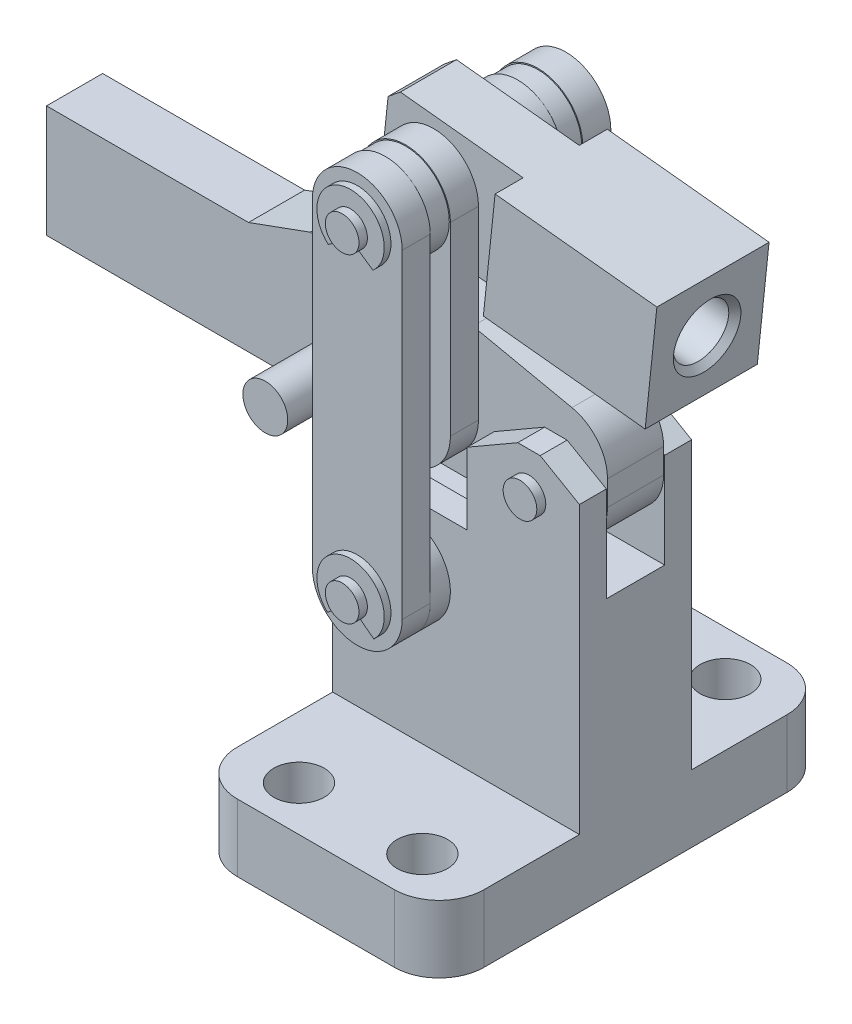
ISO-10303-21;
HEADER;
FILE_DESCRIPTION(('STEP AP214'),'2;1');
FILE_NAME('part.step','',(''),(''),'','','');
FILE_SCHEMA(('AUTOMOTIVE_DESIGN { 1 0 10303 214 1 1 1 1 }'));
ENDSEC;
DATA;
#1=APPLICATION_CONTEXT('core data for automotive mechanical design processes');
#2=APPLICATION_PROTOCOL_DEFINITION('international standard','automotive_design',2000,#1);
#3=PRODUCT_CONTEXT('',#1,'mechanical');
#4=PRODUCT('Part','Part','',(#3));
#5=PRODUCT_RELATED_PRODUCT_CATEGORY('part','',(#4));
#6=PRODUCT_DEFINITION_FORMATION('','',#4);
#7=PRODUCT_DEFINITION_CONTEXT('part definition',#1,'design');
#8=PRODUCT_DEFINITION('design','',#6,#7);
#9=PRODUCT_DEFINITION_SHAPE('','',#8);
#10=(LENGTH_UNIT() NAMED_UNIT(*) SI_UNIT(.MILLI.,.METRE.));
#11=(NAMED_UNIT(*) PLANE_ANGLE_UNIT() SI_UNIT($,.RADIAN.));
#12=(NAMED_UNIT(*) SI_UNIT($,.STERADIAN.) SOLID_ANGLE_UNIT());
#13=UNCERTAINTY_MEASURE_WITH_UNIT(LENGTH_MEASURE(1.E-05),#10,'distance_accuracy_value','');
#14=(GEOMETRIC_REPRESENTATION_CONTEXT(3) GLOBAL_UNCERTAINTY_ASSIGNED_CONTEXT((#13)) GLOBAL_UNIT_ASSIGNED_CONTEXT((#10,
#11,#12)) REPRESENTATION_CONTEXT('',''));
#15=CARTESIAN_POINT('',(0.,0.,0.));
#16=DIRECTION('',(0.,0.,1.));
#17=DIRECTION('',(1.,0.,0.));
#18=AXIS2_PLACEMENT_3D('',#15,#16,#17);
#19=CARTESIAN_POINT('',(10.9452189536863,46.4547153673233,13.5));
#20=DIRECTION('',(0.994521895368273,-0.104528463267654,0.));
#21=DIRECTION('',(0.104528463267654,0.994521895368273,0.));
#22=AXIS2_PLACEMENT_3D('',#19,#20,#21);
#23=CONICAL_SURFACE('',#22,2.45849999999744,1.04719755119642);
#24=CARTESIAN_POINT('',(9.53357902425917,46.603084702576,13.5));
#25=VERTEX_POINT('',#24);
#26=VERTEX_LOOP('',#25);
#27=FACE_BOUND('',#26,.T.);
#28=CARTESIAN_POINT('',(10.9452189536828,46.4547153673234,13.5));
#29=DIRECTION('',(-0.994521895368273,0.104528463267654,0.));
#30=DIRECTION('',(-0.104528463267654,-0.994521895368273,0.));
#31=AXIS2_PLACEMENT_3D('',#28,#29,#30);
#32=CIRCLE('',#31,2.4585);
#33=CARTESIAN_POINT('',(10.6882357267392,44.0096832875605,13.5));
#34=VERTEX_POINT('',#33);
#35=EDGE_CURVE('P0_E102',#34,#34,#32,.F.);
#36=ORIENTED_EDGE('',*,*,#35,.T.);
#37=EDGE_LOOP('',(#36));
#38=FACE_BOUND('',#37,.T.);
#39=ADVANCED_FACE('P0_F17',(#27,#38),#23,.F.);
#40=CARTESIAN_POINT('',(22.879481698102,45.2003738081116,13.5));
#41=DIRECTION('',(-0.994521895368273,0.104528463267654,0.));
#42=DIRECTION('',(-0.104528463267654,-0.994521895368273,0.));
#43=AXIS2_PLACEMENT_3D('',#40,#41,#42);
#44=CYLINDRICAL_SURFACE('',#43,2.4585);
#45=ORIENTED_EDGE('',*,*,#35,.F.);
#46=EDGE_LOOP('',(#45));
#47=FACE_BOUND('',#46,.T.);
#48=CARTESIAN_POINT('',(22.3409480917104,45.2569759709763,13.5));
#49=DIRECTION('',(0.994521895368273,-0.104528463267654,0.));
#50=DIRECTION('',(0.104528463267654,0.994521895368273,0.));
#51=AXIS2_PLACEMENT_3D('',#48,#49,#50);
#52=CIRCLE('',#51,2.45850000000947);
#53=CARTESIAN_POINT('',(22.5979313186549,47.7020080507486,13.5));
#54=VERTEX_POINT('',#53);
#55=EDGE_CURVE('P0_E153',#54,#54,#52,.T.);
#56=ORIENTED_EDGE('',*,*,#55,.T.);
#57=EDGE_LOOP('',(#56));
#58=FACE_BOUND('',#57,.T.);
#59=ADVANCED_FACE('P0_F99',(#47,#58),#44,.F.);
#60=CARTESIAN_POINT('',(-3.89346238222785,43.9922905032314,18.5));
#61=DIRECTION('',(0.777145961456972,0.629320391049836,0.));
#62=DIRECTION('',(-0.629320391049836,0.777145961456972,0.));
#63=AXIS2_PLACEMENT_3D('',#60,#61,#62);
#64=PLANE('',#63);
#65=DIRECTION('',(0.,0.,1.));
#66=VECTOR('',#65,1.);
#67=CARTESIAN_POINT('',(-3.89346238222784,43.9922905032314,18.5));
#68=LINE('',#67,#66);
#69=CARTESIAN_POINT('',(-3.89346238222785,43.9922905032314,16.));
#70=VERTEX_POINT('',#69);
#71=CARTESIAN_POINT('',(-3.89346238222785,43.9922905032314,11.));
#72=VERTEX_POINT('',#71);
#73=EDGE_CURVE('P0_E157',#70,#72,#68,.F.);
#74=ORIENTED_EDGE('',*,*,#73,.T.);
#75=DIRECTION('',(-0.629320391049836,0.777145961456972,0.));
#76=VECTOR('',#75,1.);
#77=CARTESIAN_POINT('',(-3.89346238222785,43.9922905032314,11.));
#78=LINE('',#77,#76);
#79=CARTESIAN_POINT('',(-3.00346895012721,42.8932401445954,11.));
#80=VERTEX_POINT('',#79);
#81=EDGE_CURVE('P0_E105',#80,#72,#78,.T.);
#82=ORIENTED_EDGE('',*,*,#81,.F.);
#83=DIRECTION('',(0.,0.,1.));
#84=VECTOR('',#83,1.);
#85=CARTESIAN_POINT('',(-3.00346895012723,42.8932401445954,18.5));
#86=LINE('',#85,#84);
#87=CARTESIAN_POINT('',(-3.00346895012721,42.8932401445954,16.));
#88=VERTEX_POINT('',#87);
#89=EDGE_CURVE('P0_E150',#80,#88,#86,.T.);
#90=ORIENTED_EDGE('',*,*,#89,.T.);
#91=DIRECTION('',(-0.629320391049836,0.777145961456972,0.));
#92=VECTOR('',#91,1.);
#93=CARTESIAN_POINT('',(-3.89346238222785,43.9922905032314,16.));
#94=LINE('',#93,#92);
#95=EDGE_CURVE('P0_E93',#70,#88,#94,.F.);
#96=ORIENTED_EDGE('',*,*,#95,.F.);
#97=EDGE_LOOP('',(#74,#82,#90,#96));
#98=FACE_BOUND('',#97,.T.);
#99=ADVANCED_FACE('P0_F262',(#98),#64,.F.);
#100=CARTESIAN_POINT('',(1.,47.5,18.5));
#101=DIRECTION('',(0.,0.,1.));
#102=DIRECTION('',(1.,0.,0.));
#103=AXIS2_PLACEMENT_3D('',#100,#101,#102);
#104=CYLINDRICAL_SURFACE('',#103,1.5);
#105=CARTESIAN_POINT('',(1.,47.5,16.));
#106=DIRECTION('',(0.,0.,1.));
#107=DIRECTION('',(1.,0.,0.));
#108=AXIS2_PLACEMENT_3D('',#105,#106,#107);
#109=CIRCLE('',#108,1.5);
#110=CARTESIAN_POINT('',(2.5,47.5,16.));
#111=VERTEX_POINT('',#110);
#112=EDGE_CURVE('P0_E20',#111,#111,#109,.F.);
#113=ORIENTED_EDGE('',*,*,#112,.F.);
#114=EDGE_LOOP('',(#113));
#115=FACE_BOUND('',#114,.T.);
#116=CARTESIAN_POINT('',(1.,47.5,11.));
#117=DIRECTION('',(0.,0.,1.));
#118=DIRECTION('',(1.,0.,0.));
#119=AXIS2_PLACEMENT_3D('',#116,#117,#118);
#120=CIRCLE('',#119,1.5);
#121=CARTESIAN_POINT('',(2.5,47.5,11.));
#122=VERTEX_POINT('',#121);
#123=EDGE_CURVE('P0_E121',#122,#122,#120,.T.);
#124=ORIENTED_EDGE('',*,*,#123,.F.);
#125=EDGE_LOOP('',(#124));
#126=FACE_BOUND('',#125,.T.);
#127=ADVANCED_FACE('P0_F271',(#115,#126),#104,.F.);
#128=CARTESIAN_POINT('',(-3.05723467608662,51.9484656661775,18.5));
#129=DIRECTION('',(0.994521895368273,-0.104528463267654,0.));
#130=DIRECTION('',(0.104528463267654,0.994521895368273,0.));
#131=AXIS2_PLACEMENT_3D('',#128,#129,#130);
#132=PLANE('',#131);
#133=DIRECTION('',(0.,0.,1.));
#134=VECTOR('',#133,1.);
#135=CARTESIAN_POINT('',(-3.05723467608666,51.9484656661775,18.5));
#136=LINE('',#135,#134);
#137=CARTESIAN_POINT('',(-3.05723467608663,51.9484656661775,16.));
#138=VERTEX_POINT('',#137);
#139=CARTESIAN_POINT('',(-3.05723467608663,51.9484656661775,11.));
#140=VERTEX_POINT('',#139);
#141=EDGE_CURVE('P0_E135',#138,#140,#136,.F.);
#142=ORIENTED_EDGE('',*,*,#141,.T.);
#143=DIRECTION('',(0.104528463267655,0.994521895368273,0.));
#144=VECTOR('',#143,1.);
#145=CARTESIAN_POINT('',(-3.89346238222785,43.9922905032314,11.));
#146=LINE('',#145,#144);
#147=EDGE_CURVE('P0_E131',#72,#140,#146,.T.);
#148=ORIENTED_EDGE('',*,*,#147,.F.);
#149=ORIENTED_EDGE('',*,*,#73,.F.);
#150=DIRECTION('',(-0.104528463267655,-0.994521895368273,0.));
#151=VECTOR('',#150,1.);
#152=CARTESIAN_POINT('',(-3.05723467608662,51.9484656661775,16.));
#153=LINE('',#152,#151);
#154=EDGE_CURVE('P0_E141',#138,#70,#153,.T.);
#155=ORIENTED_EDGE('',*,*,#154,.F.);
#156=EDGE_LOOP('',(#142,#148,#149,#155));
#157=FACE_BOUND('',#156,.T.);
#158=ADVANCED_FACE('P0_F199',(#157),#132,.F.);
#159=CARTESIAN_POINT('',(22.8794816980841,45.2003738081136,13.5));
#160=DIRECTION('',(0.994521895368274,-0.104528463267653,0.));
#161=DIRECTION('',(0.104528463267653,0.994521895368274,0.));
#162=AXIS2_PLACEMENT_3D('',#159,#160,#161);
#163=CONICAL_SURFACE('',#162,2.99999999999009,0.785398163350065);
#164=ORIENTED_EDGE('',*,*,#55,.F.);
#165=EDGE_LOOP('',(#164));
#166=FACE_BOUND('',#165,.T.);
#167=CARTESIAN_POINT('',(22.8794816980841,45.2003738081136,13.5));
#168=DIRECTION('',(0.994521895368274,-0.104528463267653,0.));
#169=DIRECTION('',(0.104528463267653,0.994521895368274,0.));
#170=AXIS2_PLACEMENT_3D('',#167,#168,#169);
#171=CIRCLE('',#170,2.99999999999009);
#172=CARTESIAN_POINT('',(23.193067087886,48.1839394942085,13.5));
#173=VERTEX_POINT('',#172);
#174=EDGE_CURVE('P0_E116',#173,#173,#171,.T.);
#175=ORIENTED_EDGE('',*,*,#174,.T.);
#176=EDGE_LOOP('',(#175));
#177=FACE_BOUND('',#176,.T.);
#178=ADVANCED_FACE('P0_F279',(#166,#177),#163,.F.);
#179=CARTESIAN_POINT('',(-3.00346895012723,42.8932401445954,18.5));
#180=DIRECTION('',(0.104528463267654,0.994521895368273,0.));
#181=DIRECTION('',(-0.994521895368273,0.104528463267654,0.));
#182=AXIS2_PLACEMENT_3D('',#179,#180,#181);
#183=PLANE('',#182);
#184=DIRECTION('',(0.994521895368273,-0.104528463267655,0.));
#185=VECTOR('',#184,1.);
#186=CARTESIAN_POINT('',(-3.00346895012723,42.8932401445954,16.));
#187=LINE('',#186,#185);
#188=CARTESIAN_POINT('',(7.9362718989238,41.7434270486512,16.));
#189=VERTEX_POINT('',#188);
#190=EDGE_CURVE('P0_E147',#88,#189,#187,.T.);
#191=ORIENTED_EDGE('',*,*,#190,.F.);
#192=ORIENTED_EDGE('',*,*,#89,.F.);
#193=DIRECTION('',(-0.994521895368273,0.104528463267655,0.));
#194=VECTOR('',#193,1.);
#195=CARTESIAN_POINT('',(7.9362718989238,41.7434270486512,11.));
#196=LINE('',#195,#194);
#197=CARTESIAN_POINT('',(7.9362718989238,41.7434270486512,11.));
#198=VERTEX_POINT('',#197);
#199=EDGE_CURVE('P0_E124',#198,#80,#196,.T.);
#200=ORIENTED_EDGE('',*,*,#199,.F.);
#201=DIRECTION('',(0.,0.,1.));
#202=VECTOR('',#201,1.);
#203=CARTESIAN_POINT('',(7.93627189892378,41.7434270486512,11.));
#204=LINE('',#203,#202);
#205=CARTESIAN_POINT('',(7.9362718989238,41.7434270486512,8.5));
#206=VERTEX_POINT('',#205);
#207=EDGE_CURVE('P0_E183',#206,#198,#204,.T.);
#208=ORIENTED_EDGE('',*,*,#207,.F.);
#209=DIRECTION('',(0.994521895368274,-0.104528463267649,0.));
#210=VECTOR('',#209,1.);
#211=CARTESIAN_POINT('',(7.9362718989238,41.7434270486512,8.5));
#212=LINE('',#211,#210);
#213=CARTESIAN_POINT('',(22.3568393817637,40.2277643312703,8.5));
#214=VERTEX_POINT('',#213);
#215=EDGE_CURVE('P0_E172',#206,#214,#212,.T.);
#216=ORIENTED_EDGE('',*,*,#215,.T.);
#217=DIRECTION('',(0.,0.,1.));
#218=VECTOR('',#217,1.);
#219=CARTESIAN_POINT('',(22.3568393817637,40.2277643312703,18.5));
#220=LINE('',#219,#218);
#221=CARTESIAN_POINT('',(22.3568393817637,40.2277643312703,18.5));
#222=VERTEX_POINT('',#221);
#223=EDGE_CURVE('P0_E119',#214,#222,#220,.T.);
#224=ORIENTED_EDGE('',*,*,#223,.T.);
#225=DIRECTION('',(0.994521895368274,-0.104528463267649,0.));
#226=VECTOR('',#225,1.);
#227=CARTESIAN_POINT('',(7.9362718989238,41.7434270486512,18.5));
#228=LINE('',#227,#226);
#229=CARTESIAN_POINT('',(7.9362718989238,41.7434270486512,18.5));
#230=VERTEX_POINT('',#229);
#231=EDGE_CURVE('P0_E168',#230,#222,#228,.T.);
#232=ORIENTED_EDGE('',*,*,#231,.F.);
#233=DIRECTION('',(0.,0.,1.));
#234=VECTOR('',#233,1.);
#235=CARTESIAN_POINT('',(7.93627189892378,41.7434270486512,23.5));
#236=LINE('',#235,#234);
#237=EDGE_CURVE('P0_E224',#189,#230,#236,.T.);
#238=ORIENTED_EDGE('',*,*,#237,.F.);
#239=EDGE_LOOP('',(#191,#192,#200,#208,#216,#224,#232,#238));
#240=FACE_BOUND('',#239,.T.);
#241=ADVANCED_FACE('P0_F233',(#240),#183,.F.);
#242=CARTESIAN_POINT('',(11.0721257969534,71.5790839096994,16.));
#243=DIRECTION('',(0.,0.,1.));
#244=DIRECTION('',(1.,0.,0.));
#245=AXIS2_PLACEMENT_3D('',#242,#243,#244);
#246=PLANE('',#245);
#247=ORIENTED_EDGE('',*,*,#154,.T.);
#248=ORIENTED_EDGE('',*,*,#95,.T.);
#249=ORIENTED_EDGE('',*,*,#190,.T.);
#250=DIRECTION('',(-0.104528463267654,-0.994521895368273,0.));
#251=VECTOR('',#250,1.);
#252=CARTESIAN_POINT('',(11.0721257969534,71.5790839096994,16.));
#253=LINE('',#252,#251);
#254=CARTESIAN_POINT('',(8.98155653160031,51.688646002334,16.));
#255=VERTEX_POINT('',#254);
#256=EDGE_CURVE('P0_E216',#255,#189,#253,.T.);
#257=ORIENTED_EDGE('',*,*,#256,.F.);
#258=DIRECTION('',(0.994521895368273,-0.104528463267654,0.));
#259=VECTOR('',#258,1.);
#260=CARTESIAN_POINT('',(23.4021240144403,50.172983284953,16.));
#261=LINE('',#260,#259);
#262=CARTESIAN_POINT('',(-1.95818431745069,52.8384590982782,16.));
#263=VERTEX_POINT('',#262);
#264=EDGE_CURVE('P0_E208',#255,#263,#261,.F.);
#265=ORIENTED_EDGE('',*,*,#264,.T.);
#266=DIRECTION('',(0.777145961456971,0.629320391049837,0.));
#267=VECTOR('',#266,1.);
#268=CARTESIAN_POINT('',(-1.95818431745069,52.8384590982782,16.));
#269=LINE('',#268,#267);
#270=EDGE_CURVE('P0_E125',#263,#138,#269,.F.);
#271=ORIENTED_EDGE('',*,*,#270,.T.);
#272=EDGE_LOOP('',(#247,#248,#249,#257,#265,#271));
#273=FACE_BOUND('',#272,.T.);
#274=ORIENTED_EDGE('',*,*,#112,.T.);
#275=EDGE_LOOP('',(#274));
#276=FACE_BOUND('',#275,.T.);
#277=ADVANCED_FACE('P0_F263',(#273,#276),#246,.T.);
#278=CARTESIAN_POINT('',(-1.95818431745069,52.8384590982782,18.5));
#279=DIRECTION('',(0.629320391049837,-0.777145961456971,0.));
#280=DIRECTION('',(0.777145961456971,0.629320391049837,0.));
#281=AXIS2_PLACEMENT_3D('',#278,#279,#280);
#282=PLANE('',#281);
#283=DIRECTION('',(0.,0.,1.));
#284=VECTOR('',#283,1.);
#285=CARTESIAN_POINT('',(-1.9581843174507,52.8384590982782,18.5));
#286=LINE('',#285,#284);
#287=CARTESIAN_POINT('',(-1.95818431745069,52.8384590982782,11.));
#288=VERTEX_POINT('',#287);
#289=EDGE_CURVE('P0_E204',#263,#288,#286,.F.);
#290=ORIENTED_EDGE('',*,*,#289,.T.);
#291=DIRECTION('',(0.777145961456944,0.629320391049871,0.));
#292=VECTOR('',#291,1.);
#293=CARTESIAN_POINT('',(-3.05723467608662,51.9484656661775,11.));
#294=LINE('',#293,#292);
#295=EDGE_CURVE('P0_E189',#140,#288,#294,.T.);
#296=ORIENTED_EDGE('',*,*,#295,.F.);
#297=ORIENTED_EDGE('',*,*,#141,.F.);
#298=ORIENTED_EDGE('',*,*,#270,.F.);
#299=EDGE_LOOP('',(#290,#296,#297,#298));
#300=FACE_BOUND('',#299,.T.);
#301=ADVANCED_FACE('P0_F202',(#300),#282,.F.);
#302=CARTESIAN_POINT('',(-3.84570263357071,73.1470108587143,11.));
#303=DIRECTION('',(0.,0.,-1.));
#304=DIRECTION('',(-1.,0.,0.));
#305=AXIS2_PLACEMENT_3D('',#302,#303,#304);
#306=PLANE('',#305);
#307=DIRECTION('',(0.994521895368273,-0.104528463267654,0.));
#308=VECTOR('',#307,1.);
#309=CARTESIAN_POINT('',(23.4021240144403,50.172983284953,11.));
#310=LINE('',#309,#308);
#311=CARTESIAN_POINT('',(8.98155653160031,51.688646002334,11.));
#312=VERTEX_POINT('',#311);
#313=EDGE_CURVE('P0_E207',#288,#312,#310,.T.);
#314=ORIENTED_EDGE('',*,*,#313,.T.);
#315=DIRECTION('',(-0.104528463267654,-0.994521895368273,0.));
#316=VECTOR('',#315,1.);
#317=CARTESIAN_POINT('',(11.0721257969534,71.5790839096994,11.));
#318=LINE('',#317,#316);
#319=EDGE_CURVE('P0_E174',#198,#312,#318,.F.);
#320=ORIENTED_EDGE('',*,*,#319,.F.);
#321=ORIENTED_EDGE('',*,*,#199,.T.);
#322=ORIENTED_EDGE('',*,*,#81,.T.);
#323=ORIENTED_EDGE('',*,*,#147,.T.);
#324=ORIENTED_EDGE('',*,*,#295,.T.);
#325=EDGE_LOOP('',(#314,#320,#321,#322,#323,#324));
#326=FACE_BOUND('',#325,.T.);
#327=ORIENTED_EDGE('',*,*,#123,.T.);
#328=EDGE_LOOP('',(#327));
#329=FACE_BOUND('',#328,.T.);
#330=ADVANCED_FACE('P0_F193',(#326,#329),#306,.T.);
#331=CARTESIAN_POINT('',(11.0721257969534,71.5790839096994,11.));
#332=DIRECTION('',(-0.994521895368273,0.104528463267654,0.));
#333=DIRECTION('',(-0.104528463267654,-0.994521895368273,0.));
#334=AXIS2_PLACEMENT_3D('',#331,#332,#333);
#335=PLANE('',#334);
#336=DIRECTION('',(0.,0.,1.));
#337=VECTOR('',#336,1.);
#338=CARTESIAN_POINT('',(8.9815565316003,51.688646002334,18.5));
#339=LINE('',#338,#337);
#340=CARTESIAN_POINT('',(8.98155653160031,51.688646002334,8.5));
#341=VERTEX_POINT('',#340);
#342=EDGE_CURVE('P0_E213',#312,#341,#339,.F.);
#343=ORIENTED_EDGE('',*,*,#342,.T.);
#344=DIRECTION('',(-0.104528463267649,-0.994521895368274,0.));
#345=VECTOR('',#344,1.);
#346=CARTESIAN_POINT('',(8.9815565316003,51.688646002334,8.5));
#347=LINE('',#346,#345);
#348=EDGE_CURVE('P0_E120',#341,#206,#347,.T.);
#349=ORIENTED_EDGE('',*,*,#348,.T.);
#350=ORIENTED_EDGE('',*,*,#207,.T.);
#351=ORIENTED_EDGE('',*,*,#319,.T.);
#352=EDGE_LOOP('',(#343,#349,#350,#351));
#353=FACE_BOUND('',#352,.T.);
#354=ADVANCED_FACE('P0_F257',(#353),#335,.T.);
#355=CARTESIAN_POINT('',(-5.5,0.,8.5));
#356=DIRECTION('',(0.,0.,1.));
#357=DIRECTION('',(1.,0.,0.));
#358=AXIS2_PLACEMENT_3D('',#355,#356,#357);
#359=PLANE('',#358);
#360=DIRECTION('',(0.994521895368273,-0.104528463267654,0.));
#361=VECTOR('',#360,1.);
#362=CARTESIAN_POINT('',(23.4021240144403,50.172983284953,8.5));
#363=LINE('',#362,#361);
#364=CARTESIAN_POINT('',(23.4021240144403,50.172983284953,8.5));
#365=VERTEX_POINT('',#364);
#366=EDGE_CURVE('P0_E250',#341,#365,#363,.T.);
#367=ORIENTED_EDGE('',*,*,#366,.T.);
#368=DIRECTION('',(-0.104528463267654,-0.994521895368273,0.));
#369=VECTOR('',#368,1.);
#370=CARTESIAN_POINT('',(22.3568393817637,40.2277643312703,8.5));
#371=LINE('',#370,#369);
#372=EDGE_CURVE('P0_E170',#365,#214,#371,.T.);
#373=ORIENTED_EDGE('',*,*,#372,.T.);
#374=ORIENTED_EDGE('',*,*,#215,.F.);
#375=ORIENTED_EDGE('',*,*,#348,.F.);
#376=EDGE_LOOP('',(#367,#373,#374,#375));
#377=FACE_BOUND('',#376,.T.);
#378=ADVANCED_FACE('P0_F293',(#377),#359,.F.);
#379=CARTESIAN_POINT('',(22.3568393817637,40.2277643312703,18.5));
#380=DIRECTION('',(-0.994521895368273,0.104528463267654,0.));
#381=DIRECTION('',(-0.104528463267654,-0.994521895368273,0.));
#382=AXIS2_PLACEMENT_3D('',#379,#380,#381);
#383=PLANE('',#382);
#384=DIRECTION('',(0.,0.,1.));
#385=VECTOR('',#384,1.);
#386=CARTESIAN_POINT('',(23.4021240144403,50.172983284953,18.5));
#387=LINE('',#386,#385);
#388=CARTESIAN_POINT('',(23.4021240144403,50.172983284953,18.5));
#389=VERTEX_POINT('',#388);
#390=EDGE_CURVE('P0_E240',#365,#389,#387,.T.);
#391=ORIENTED_EDGE('',*,*,#390,.T.);
#392=DIRECTION('',(0.104528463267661,0.994521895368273,0.));
#393=VECTOR('',#392,1.);
#394=CARTESIAN_POINT('',(22.3568393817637,40.2277643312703,18.5));
#395=LINE('',#394,#393);
#396=EDGE_CURVE('P0_E169',#222,#389,#395,.T.);
#397=ORIENTED_EDGE('',*,*,#396,.F.);
#398=ORIENTED_EDGE('',*,*,#223,.F.);
#399=ORIENTED_EDGE('',*,*,#372,.F.);
#400=EDGE_LOOP('',(#391,#397,#398,#399));
#401=FACE_BOUND('',#400,.T.);
#402=ORIENTED_EDGE('',*,*,#174,.F.);
#403=EDGE_LOOP('',(#402));
#404=FACE_BOUND('',#403,.T.);
#405=ADVANCED_FACE('P0_F237',(#401,#404),#383,.F.);
#406=CARTESIAN_POINT('',(-5.5,0.,18.5));
#407=DIRECTION('',(0.,0.,1.));
#408=DIRECTION('',(1.,0.,0.));
#409=AXIS2_PLACEMENT_3D('',#406,#407,#408);
#410=PLANE('',#409);
#411=ORIENTED_EDGE('',*,*,#231,.T.);
#412=ORIENTED_EDGE('',*,*,#396,.T.);
#413=DIRECTION('',(0.994521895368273,-0.104528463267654,0.));
#414=VECTOR('',#413,1.);
#415=CARTESIAN_POINT('',(23.4021240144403,50.172983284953,18.5));
#416=LINE('',#415,#414);
#417=CARTESIAN_POINT('',(8.98155653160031,51.688646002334,18.5));
#418=VERTEX_POINT('',#417);
#419=EDGE_CURVE('P0_E27',#389,#418,#416,.F.);
#420=ORIENTED_EDGE('',*,*,#419,.T.);
#421=DIRECTION('',(-0.104528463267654,-0.994521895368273,0.));
#422=VECTOR('',#421,1.);
#423=CARTESIAN_POINT('',(11.0721257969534,71.5790839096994,18.5));
#424=LINE('',#423,#422);
#425=EDGE_CURVE('P0_E35',#230,#418,#424,.F.);
#426=ORIENTED_EDGE('',*,*,#425,.F.);
#427=EDGE_LOOP('',(#411,#412,#420,#426));
#428=FACE_BOUND('',#427,.T.);
#429=ADVANCED_FACE('P0_F244',(#428),#410,.T.);
#430=CARTESIAN_POINT('',(11.0721257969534,71.5790839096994,23.5));
#431=DIRECTION('',(-0.994521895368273,0.104528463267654,0.));
#432=DIRECTION('',(-0.104528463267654,-0.994521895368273,0.));
#433=AXIS2_PLACEMENT_3D('',#430,#431,#432);
#434=PLANE('',#433);
#435=DIRECTION('',(0.,0.,1.));
#436=VECTOR('',#435,1.);
#437=CARTESIAN_POINT('',(8.9815565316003,51.688646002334,18.5));
#438=LINE('',#437,#436);
#439=EDGE_CURVE('P0_E11',#418,#255,#438,.F.);
#440=ORIENTED_EDGE('',*,*,#439,.T.);
#441=ORIENTED_EDGE('',*,*,#256,.T.);
#442=ORIENTED_EDGE('',*,*,#237,.T.);
#443=ORIENTED_EDGE('',*,*,#425,.T.);
#444=EDGE_LOOP('',(#440,#441,#442,#443));
#445=FACE_BOUND('',#444,.T.);
#446=ADVANCED_FACE('P0_F283',(#445),#434,.T.);
#447=CARTESIAN_POINT('',(23.4021240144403,50.172983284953,18.5));
#448=DIRECTION('',(-0.104528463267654,-0.994521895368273,0.));
#449=DIRECTION('',(0.994521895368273,-0.104528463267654,0.));
#450=AXIS2_PLACEMENT_3D('',#447,#448,#449);
#451=PLANE('',#450);
#452=ORIENTED_EDGE('',*,*,#419,.F.);
#453=ORIENTED_EDGE('',*,*,#390,.F.);
#454=ORIENTED_EDGE('',*,*,#366,.F.);
#455=ORIENTED_EDGE('',*,*,#342,.F.);
#456=ORIENTED_EDGE('',*,*,#313,.F.);
#457=ORIENTED_EDGE('',*,*,#289,.F.);
#458=ORIENTED_EDGE('',*,*,#264,.F.);
#459=ORIENTED_EDGE('',*,*,#439,.F.);
#460=EDGE_LOOP('',(#452,#453,#454,#455,#456,#457,#458,#459));
#461=FACE_BOUND('',#460,.T.);
#462=ADVANCED_FACE('P0_F245',(#461),#451,.F.);
#463=CLOSED_SHELL('',(#39,#59,#99,#127,#158,#178,#241,#277,#301,#330,#354,#378,#405,#429,#446,#462));
#464=MANIFOLD_SOLID_BREP('P0_B1',#463);
#465=CARTESIAN_POINT('',(1.,19.,20.3));
#466=DIRECTION('',(0.,0.,-1.));
#467=DIRECTION('',(-1.,0.,0.));
#468=AXIS2_PLACEMENT_3D('',#465,#466,#467);
#469=CYLINDRICAL_SURFACE('',#468,1.5);
#470=CARTESIAN_POINT('',(1.,19.,6.7));
#471=DIRECTION('',(0.,0.,-1.));
#472=DIRECTION('',(-1.,0.,0.));
#473=AXIS2_PLACEMENT_3D('',#470,#471,#472);
#474=CIRCLE('',#473,1.5);
#475=CARTESIAN_POINT('',(-0.499999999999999,19.,6.7));
#476=VERTEX_POINT('',#475);
#477=EDGE_CURVE('P1_E317',#476,#476,#474,.T.);
#478=ORIENTED_EDGE('',*,*,#477,.T.);
#479=EDGE_LOOP('',(#478));
#480=FACE_BOUND('',#479,.T.);
#481=CARTESIAN_POINT('',(1.,19.,20.3));
#482=DIRECTION('',(0.,0.,-1.));
#483=DIRECTION('',(-1.,0.,0.));
#484=AXIS2_PLACEMENT_3D('',#481,#482,#483);
#485=CIRCLE('',#484,1.5);
#486=CARTESIAN_POINT('',(-0.499999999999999,19.,20.3));
#487=VERTEX_POINT('',#486);
#488=EDGE_CURVE('P1_E20',#487,#487,#485,.T.);
#489=ORIENTED_EDGE('',*,*,#488,.F.);
#490=EDGE_LOOP('',(#489));
#491=FACE_BOUND('',#490,.T.);
#492=ADVANCED_FACE('P1_F17',(#480,#491),#469,.F.);
#493=CARTESIAN_POINT('',(1.,19.,20.3));
#494=DIRECTION('',(0.,0.,1.));
#495=DIRECTION('',(1.,0.,0.));
#496=AXIS2_PLACEMENT_3D('',#493,#494,#495);
#497=PLANE('',#496);
#498=CARTESIAN_POINT('',(1.,19.,20.3));
#499=DIRECTION('',(0.,0.,1.));
#500=DIRECTION('',(1.,0.,0.));
#501=AXIS2_PLACEMENT_3D('',#498,#499,#500);
#502=CIRCLE('',#501,4.);
#503=CARTESIAN_POINT('',(5.,19.,20.3));
#504=VERTEX_POINT('',#503);
#505=EDGE_CURVE('P1_E314',#504,#504,#502,.F.);
#506=ORIENTED_EDGE('',*,*,#505,.F.);
#507=EDGE_LOOP('',(#506));
#508=FACE_BOUND('',#507,.T.);
#509=ORIENTED_EDGE('',*,*,#488,.T.);
#510=EDGE_LOOP('',(#509));
#511=FACE_BOUND('',#510,.T.);
#512=ADVANCED_FACE('P1_F326',(#508,#511),#497,.T.);
#513=CARTESIAN_POINT('',(12.,30.,19.3));
#514=DIRECTION('',(0.,0.,1.));
#515=DIRECTION('',(1.,0.,0.));
#516=AXIS2_PLACEMENT_3D('',#513,#514,#515);
#517=PLANE('',#516);
#518=CARTESIAN_POINT('',(12.,30.,19.3));
#519=DIRECTION('',(0.,0.,1.));
#520=DIRECTION('',(1.,0.,0.));
#521=AXIS2_PLACEMENT_3D('',#518,#519,#520);
#522=CIRCLE('',#521,1.5);
#523=CARTESIAN_POINT('',(13.5,30.,19.3));
#524=VERTEX_POINT('',#523);
#525=EDGE_CURVE('P1_E171',#524,#524,#522,.F.);
#526=ORIENTED_EDGE('',*,*,#525,.F.);
#527=EDGE_LOOP('',(#526));
#528=FACE_BOUND('',#527,.T.);
#529=ADVANCED_FACE('P1_F332',(#528),#517,.T.);
#530=CARTESIAN_POINT('',(1.,19.,6.7));
#531=DIRECTION('',(0.,0.,1.));
#532=DIRECTION('',(1.,0.,0.));
#533=AXIS2_PLACEMENT_3D('',#530,#531,#532);
#534=PLANE('',#533);
#535=CARTESIAN_POINT('',(1.,19.,6.7));
#536=DIRECTION('',(0.,0.,1.));
#537=DIRECTION('',(1.,0.,0.));
#538=AXIS2_PLACEMENT_3D('',#535,#536,#537);
#539=CIRCLE('',#538,4.);
#540=CARTESIAN_POINT('',(5.,19.,6.7));
#541=VERTEX_POINT('',#540);
#542=EDGE_CURVE('P1_E307',#541,#541,#539,.T.);
#543=ORIENTED_EDGE('',*,*,#542,.F.);
#544=EDGE_LOOP('',(#543));
#545=FACE_BOUND('',#544,.T.);
#546=ORIENTED_EDGE('',*,*,#477,.F.);
#547=EDGE_LOOP('',(#546));
#548=FACE_BOUND('',#547,.T.);
#549=ADVANCED_FACE('P1_F472',(#545,#548),#534,.F.);
#550=CARTESIAN_POINT('',(12.,30.,7.7));
#551=DIRECTION('',(0.,0.,1.));
#552=DIRECTION('',(1.,0.,0.));
#553=AXIS2_PLACEMENT_3D('',#550,#551,#552);
#554=PLANE('',#553);
#555=CARTESIAN_POINT('',(12.,30.,7.7));
#556=DIRECTION('',(0.,0.,1.));
#557=DIRECTION('',(1.,0.,0.));
#558=AXIS2_PLACEMENT_3D('',#555,#556,#557);
#559=CIRCLE('',#558,1.5);
#560=CARTESIAN_POINT('',(13.5,30.,7.7));
#561=VERTEX_POINT('',#560);
#562=EDGE_CURVE('P1_E302',#561,#561,#559,.T.);
#563=ORIENTED_EDGE('',*,*,#562,.F.);
#564=EDGE_LOOP('',(#563));
#565=FACE_BOUND('',#564,.T.);
#566=ADVANCED_FACE('P1_F468',(#565),#554,.F.);
#567=CARTESIAN_POINT('',(12.,30.,19.3));
#568=DIRECTION('',(0.,0.,1.));
#569=DIRECTION('',(1.,0.,0.));
#570=AXIS2_PLACEMENT_3D('',#567,#568,#569);
#571=CYLINDRICAL_SURFACE('',#570,1.5);
#572=CARTESIAN_POINT('',(12.,30.,10.9));
#573=DIRECTION('',(0.,0.,1.));
#574=DIRECTION('',(1.,0.,0.));
#575=AXIS2_PLACEMENT_3D('',#572,#573,#574);
#576=CIRCLE('',#575,1.5);
#577=CARTESIAN_POINT('',(13.5,30.,10.9));
#578=VERTEX_POINT('',#577);
#579=EDGE_CURVE('P1_E192',#578,#578,#576,.F.);
#580=ORIENTED_EDGE('',*,*,#579,.F.);
#581=EDGE_LOOP('',(#580));
#582=FACE_BOUND('',#581,.T.);
#583=CARTESIAN_POINT('',(12.,30.,16.1));
#584=DIRECTION('',(0.,0.,1.));
#585=DIRECTION('',(1.,0.,0.));
#586=AXIS2_PLACEMENT_3D('',#583,#584,#585);
#587=CIRCLE('',#586,1.5);
#588=CARTESIAN_POINT('',(13.5,30.,16.1));
#589=VERTEX_POINT('',#588);
#590=EDGE_CURVE('P1_E297',#589,#589,#587,.T.);
#591=ORIENTED_EDGE('',*,*,#590,.F.);
#592=EDGE_LOOP('',(#591));
#593=FACE_BOUND('',#592,.T.);
#594=ADVANCED_FACE('P1_F464',(#582,#593),#571,.T.);
#595=CARTESIAN_POINT('',(1.,19.,20.3));
#596=DIRECTION('',(0.,0.,1.));
#597=DIRECTION('',(1.,0.,0.));
#598=AXIS2_PLACEMENT_3D('',#595,#596,#597);
#599=CYLINDRICAL_SURFACE('',#598,4.);
#600=ORIENTED_EDGE('',*,*,#505,.T.);
#601=EDGE_LOOP('',(#600));
#602=FACE_BOUND('',#601,.T.);
#603=CARTESIAN_POINT('',(1.,19.,18.5));
#604=DIRECTION('',(0.,0.,1.));
#605=DIRECTION('',(1.,0.,0.));
#606=AXIS2_PLACEMENT_3D('',#603,#604,#605);
#607=CIRCLE('',#606,4.);
#608=CARTESIAN_POINT('',(5.,19.,18.5));
#609=VERTEX_POINT('',#608);
#610=EDGE_CURVE('P1_E288',#609,#609,#607,.F.);
#611=ORIENTED_EDGE('',*,*,#610,.F.);
#612=EDGE_LOOP('',(#611));
#613=FACE_BOUND('',#612,.T.);
#614=ADVANCED_FACE('P1_F460',(#602,#613),#599,.T.);
#615=CARTESIAN_POINT('',(12.,30.,19.3));
#616=DIRECTION('',(0.,0.,1.));
#617=DIRECTION('',(1.,0.,0.));
#618=AXIS2_PLACEMENT_3D('',#615,#616,#617);
#619=CYLINDRICAL_SURFACE('',#618,1.5);
#620=ORIENTED_EDGE('',*,*,#525,.T.);
#621=EDGE_LOOP('',(#620));
#622=FACE_BOUND('',#621,.T.);
#623=CARTESIAN_POINT('',(12.,30.,18.5));
#624=DIRECTION('',(0.,0.,1.));
#625=DIRECTION('',(1.,0.,0.));
#626=AXIS2_PLACEMENT_3D('',#623,#624,#625);
#627=CIRCLE('',#626,1.5);
#628=CARTESIAN_POINT('',(13.5,30.,18.5));
#629=VERTEX_POINT('',#628);
#630=EDGE_CURVE('P1_E283',#629,#629,#627,.F.);
#631=ORIENTED_EDGE('',*,*,#630,.F.);
#632=EDGE_LOOP('',(#631));
#633=FACE_BOUND('',#632,.T.);
#634=ADVANCED_FACE('P1_F457',(#622,#633),#619,.T.);
#635=CARTESIAN_POINT('',(13.,33.5,31.));
#636=DIRECTION('',(0.,-1.,0.));
#637=DIRECTION('',(0.,0.,-1.));
#638=AXIS2_PLACEMENT_3D('',#635,#636,#637);
#639=PLANE('',#638);
#640=DIRECTION('',(0.,0.,1.));
#641=VECTOR('',#640,1.);
#642=CARTESIAN_POINT('',(13.,33.5,31.));
#643=LINE('',#642,#641);
#644=CARTESIAN_POINT('',(13.,33.5,18.5));
#645=VERTEX_POINT('',#644);
#646=CARTESIAN_POINT('',(13.,33.5,16.1));
#647=VERTEX_POINT('',#646);
#648=EDGE_CURVE('P1_E184',#645,#647,#643,.F.);
#649=ORIENTED_EDGE('',*,*,#648,.T.);
#650=DIRECTION('',(-1.,0.,0.));
#651=VECTOR('',#650,1.);
#652=CARTESIAN_POINT('',(24.5,33.5,16.1));
#653=LINE('',#652,#651);
#654=CARTESIAN_POINT('',(11.,33.5,16.1));
#655=VERTEX_POINT('',#654);
#656=EDGE_CURVE('P1_E177',#655,#647,#653,.F.);
#657=ORIENTED_EDGE('',*,*,#656,.F.);
#658=DIRECTION('',(0.,0.,1.));
#659=VECTOR('',#658,1.);
#660=CARTESIAN_POINT('',(11.,33.5,31.));
#661=LINE('',#660,#659);
#662=CARTESIAN_POINT('',(11.,33.5,18.5));
#663=VERTEX_POINT('',#662);
#664=EDGE_CURVE('P1_E160',#655,#663,#661,.T.);
#665=ORIENTED_EDGE('',*,*,#664,.T.);
#666=DIRECTION('',(1.,0.,0.));
#667=VECTOR('',#666,1.);
#668=CARTESIAN_POINT('',(24.5,33.5,18.5));
#669=LINE('',#668,#667);
#670=EDGE_CURVE('P1_E722',#645,#663,#669,.F.);
#671=ORIENTED_EDGE('',*,*,#670,.F.);
#672=EDGE_LOOP('',(#649,#657,#665,#671));
#673=FACE_BOUND('',#672,.T.);
#674=ADVANCED_FACE('P1_F183',(#673),#639,.F.);
#675=CARTESIAN_POINT('',(11.,33.5,31.));
#676=DIRECTION('',(0.5,-0.866025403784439,0.));
#677=DIRECTION('',(0.866025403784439,0.5,0.));
#678=AXIS2_PLACEMENT_3D('',#675,#676,#677);
#679=PLANE('',#678);
#680=ORIENTED_EDGE('',*,*,#664,.F.);
#681=DIRECTION('',(0.86602540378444,0.499999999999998,0.));
#682=VECTOR('',#681,1.);
#683=CARTESIAN_POINT('',(6.5,30.9019237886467,16.1));
#684=LINE('',#683,#682);
#685=CARTESIAN_POINT('',(6.5,30.9019237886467,16.1));
#686=VERTEX_POINT('',#685);
#687=EDGE_CURVE('P1_E164',#686,#655,#684,.T.);
#688=ORIENTED_EDGE('',*,*,#687,.F.);
#689=DIRECTION('',(0.,0.,-1.));
#690=VECTOR('',#689,1.);
#691=CARTESIAN_POINT('',(6.5,30.9019237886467,31.));
#692=LINE('',#691,#690);
#693=CARTESIAN_POINT('',(6.5,30.9019237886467,18.5));
#694=VERTEX_POINT('',#693);
#695=EDGE_CURVE('P1_E170',#686,#694,#692,.F.);
#696=ORIENTED_EDGE('',*,*,#695,.T.);
#697=DIRECTION('',(-0.86602540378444,-0.499999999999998,0.));
#698=VECTOR('',#697,1.);
#699=CARTESIAN_POINT('',(11.,33.5,18.5));
#700=LINE('',#699,#698);
#701=EDGE_CURVE('P1_E165',#663,#694,#700,.T.);
#702=ORIENTED_EDGE('',*,*,#701,.F.);
#703=EDGE_LOOP('',(#680,#688,#696,#702));
#704=FACE_BOUND('',#703,.T.);
#705=ADVANCED_FACE('P1_F162',(#704),#679,.F.);
#706=CARTESIAN_POINT('',(6.5,30.9019237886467,31.));
#707=DIRECTION('',(1.,0.,0.));
#708=DIRECTION('',(0.,0.,-1.));
#709=AXIS2_PLACEMENT_3D('',#706,#707,#708);
#710=PLANE('',#709);
#711=ORIENTED_EDGE('',*,*,#695,.F.);
#712=DIRECTION('',(0.,1.,0.));
#713=VECTOR('',#712,1.);
#714=CARTESIAN_POINT('',(6.5,33.5,16.1));
#715=LINE('',#714,#713);
#716=CARTESIAN_POINT('',(6.5,24.5,16.1));
#717=VERTEX_POINT('',#716);
#718=EDGE_CURVE('P1_E180',#717,#686,#715,.T.);
#719=ORIENTED_EDGE('',*,*,#718,.F.);
#720=DIRECTION('',(0.,0.,-1.));
#721=VECTOR('',#720,1.);
#722=CARTESIAN_POINT('',(6.5,24.5,31.));
#723=LINE('',#722,#721);
#724=CARTESIAN_POINT('',(6.5,24.5,18.5));
#725=VERTEX_POINT('',#724);
#726=EDGE_CURVE('P1_E292',#717,#725,#723,.F.);
#727=ORIENTED_EDGE('',*,*,#726,.T.);
#728=DIRECTION('',(0.,1.,0.));
#729=VECTOR('',#728,1.);
#730=CARTESIAN_POINT('',(6.5,6.,18.5));
#731=LINE('',#730,#729);
#732=EDGE_CURVE('P1_E710',#694,#725,#731,.F.);
#733=ORIENTED_EDGE('',*,*,#732,.F.);
#734=EDGE_LOOP('',(#711,#719,#727,#733));
#735=FACE_BOUND('',#734,.T.);
#736=ADVANCED_FACE('P1_F448',(#735),#710,.F.);
#737=CARTESIAN_POINT('',(1.,19.,20.3));
#738=DIRECTION('',(0.,0.,1.));
#739=DIRECTION('',(1.,0.,0.));
#740=AXIS2_PLACEMENT_3D('',#737,#738,#739);
#741=CYLINDRICAL_SURFACE('',#740,4.);
#742=ORIENTED_EDGE('',*,*,#542,.T.);
#743=EDGE_LOOP('',(#742));
#744=FACE_BOUND('',#743,.T.);
#745=CARTESIAN_POINT('',(1.,19.,8.5));
#746=DIRECTION('',(0.,0.,1.));
#747=DIRECTION('',(1.,0.,0.));
#748=AXIS2_PLACEMENT_3D('',#745,#746,#747);
#749=CIRCLE('',#748,4.);
#750=CARTESIAN_POINT('',(5.,19.,8.5));
#751=VERTEX_POINT('',#750);
#752=EDGE_CURVE('P1_E278',#751,#751,#749,.T.);
#753=ORIENTED_EDGE('',*,*,#752,.F.);
#754=EDGE_LOOP('',(#753));
#755=FACE_BOUND('',#754,.T.);
#756=ADVANCED_FACE('P1_F444',(#744,#755),#741,.T.);
#757=CARTESIAN_POINT('',(12.,30.,19.3));
#758=DIRECTION('',(0.,0.,1.));
#759=DIRECTION('',(1.,0.,0.));
#760=AXIS2_PLACEMENT_3D('',#757,#758,#759);
#761=CYLINDRICAL_SURFACE('',#760,1.5);
#762=ORIENTED_EDGE('',*,*,#562,.T.);
#763=EDGE_LOOP('',(#762));
#764=FACE_BOUND('',#763,.T.);
#765=CARTESIAN_POINT('',(12.,30.,8.5));
#766=DIRECTION('',(0.,0.,1.));
#767=DIRECTION('',(1.,0.,0.));
#768=AXIS2_PLACEMENT_3D('',#765,#766,#767);
#769=CIRCLE('',#768,1.5);
#770=CARTESIAN_POINT('',(13.5,30.,8.5));
#771=VERTEX_POINT('',#770);
#772=EDGE_CURVE('P1_E273',#771,#771,#769,.T.);
#773=ORIENTED_EDGE('',*,*,#772,.F.);
#774=EDGE_LOOP('',(#773));
#775=FACE_BOUND('',#774,.T.);
#776=ADVANCED_FACE('P1_F440',(#764,#775),#761,.T.);
#777=CARTESIAN_POINT('',(6.5,30.9019237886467,31.));
#778=DIRECTION('',(1.,0.,0.));
#779=DIRECTION('',(0.,0.,-1.));
#780=AXIS2_PLACEMENT_3D('',#777,#778,#779);
#781=PLANE('',#780);
#782=DIRECTION('',(0.,0.,1.));
#783=VECTOR('',#782,1.);
#784=CARTESIAN_POINT('',(6.50000000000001,30.9019237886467,31.));
#785=LINE('',#784,#783);
#786=CARTESIAN_POINT('',(6.5,30.9019237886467,10.9));
#787=VERTEX_POINT('',#786);
#788=CARTESIAN_POINT('',(6.5,30.9019237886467,8.5));
#789=VERTEX_POINT('',#788);
#790=EDGE_CURVE('P1_E306',#787,#789,#785,.F.);
#791=ORIENTED_EDGE('',*,*,#790,.T.);
#792=DIRECTION('',(0.,1.,0.));
#793=VECTOR('',#792,1.);
#794=CARTESIAN_POINT('',(6.5,33.5,8.5));
#795=LINE('',#794,#793);
#796=CARTESIAN_POINT('',(6.5,24.5,8.5));
#797=VERTEX_POINT('',#796);
#798=EDGE_CURVE('P1_E790',#797,#789,#795,.T.);
#799=ORIENTED_EDGE('',*,*,#798,.F.);
#800=DIRECTION('',(0.,0.,-1.));
#801=VECTOR('',#800,1.);
#802=CARTESIAN_POINT('',(6.5,24.5,31.));
#803=LINE('',#802,#801);
#804=CARTESIAN_POINT('',(6.5,24.5,10.9));
#805=VERTEX_POINT('',#804);
#806=EDGE_CURVE('P1_E764',#797,#805,#803,.F.);
#807=ORIENTED_EDGE('',*,*,#806,.T.);
#808=DIRECTION('',(0.,1.,0.));
#809=VECTOR('',#808,1.);
#810=CARTESIAN_POINT('',(6.5,23.,10.9));
#811=LINE('',#810,#809);
#812=EDGE_CURVE('P1_E748',#787,#805,#811,.F.);
#813=ORIENTED_EDGE('',*,*,#812,.F.);
#814=EDGE_LOOP('',(#791,#799,#807,#813));
#815=FACE_BOUND('',#814,.T.);
#816=ADVANCED_FACE('P1_F436',(#815),#781,.F.);
#817=CARTESIAN_POINT('',(11.,33.5,31.));
#818=DIRECTION('',(0.5,-0.866025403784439,0.));
#819=DIRECTION('',(0.866025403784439,0.5,0.));
#820=AXIS2_PLACEMENT_3D('',#817,#818,#819);
#821=PLANE('',#820);
#822=DIRECTION('',(0.,0.,-1.));
#823=VECTOR('',#822,1.);
#824=CARTESIAN_POINT('',(11.,33.5,31.));
#825=LINE('',#824,#823);
#826=CARTESIAN_POINT('',(11.,33.5,10.9));
#827=VERTEX_POINT('',#826);
#828=CARTESIAN_POINT('',(11.,33.5,8.5));
#829=VERTEX_POINT('',#828);
#830=EDGE_CURVE('P1_E733',#827,#829,#825,.T.);
#831=ORIENTED_EDGE('',*,*,#830,.T.);
#832=DIRECTION('',(0.86602540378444,0.499999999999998,0.));
#833=VECTOR('',#832,1.);
#834=CARTESIAN_POINT('',(6.5,30.9019237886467,8.5));
#835=LINE('',#834,#833);
#836=EDGE_CURVE('P1_E929',#789,#829,#835,.T.);
#837=ORIENTED_EDGE('',*,*,#836,.F.);
#838=ORIENTED_EDGE('',*,*,#790,.F.);
#839=DIRECTION('',(-0.86602540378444,-0.499999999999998,0.));
#840=VECTOR('',#839,1.);
#841=CARTESIAN_POINT('',(11.,33.5,10.9));
#842=LINE('',#841,#840);
#843=EDGE_CURVE('P1_E769',#827,#787,#842,.T.);
#844=ORIENTED_EDGE('',*,*,#843,.F.);
#845=EDGE_LOOP('',(#831,#837,#838,#844));
#846=FACE_BOUND('',#845,.T.);
#847=ADVANCED_FACE('P1_F432',(#846),#821,.F.);
#848=CARTESIAN_POINT('',(13.,33.5,31.));
#849=DIRECTION('',(0.,-1.,0.));
#850=DIRECTION('',(0.,0.,-1.));
#851=AXIS2_PLACEMENT_3D('',#848,#849,#850);
#852=PLANE('',#851);
#853=DIRECTION('',(0.,0.,1.));
#854=VECTOR('',#853,1.);
#855=CARTESIAN_POINT('',(13.,33.5,31.));
#856=LINE('',#855,#854);
#857=CARTESIAN_POINT('',(13.,33.5,10.9));
#858=VERTEX_POINT('',#857);
#859=CARTESIAN_POINT('',(13.,33.5,8.5));
#860=VERTEX_POINT('',#859);
#861=EDGE_CURVE('P1_E747',#858,#860,#856,.F.);
#862=ORIENTED_EDGE('',*,*,#861,.T.);
#863=DIRECTION('',(-1.,0.,0.));
#864=VECTOR('',#863,1.);
#865=CARTESIAN_POINT('',(24.5,33.5,8.5));
#866=LINE('',#865,#864);
#867=EDGE_CURVE('P1_E96',#829,#860,#866,.F.);
#868=ORIENTED_EDGE('',*,*,#867,.F.);
#869=ORIENTED_EDGE('',*,*,#830,.F.);
#870=DIRECTION('',(1.,0.,0.));
#871=VECTOR('',#870,1.);
#872=CARTESIAN_POINT('',(24.5,33.5,10.9));
#873=LINE('',#872,#871);
#874=EDGE_CURVE('P1_E296',#858,#827,#873,.F.);
#875=ORIENTED_EDGE('',*,*,#874,.F.);
#876=EDGE_LOOP('',(#862,#868,#869,#875));
#877=FACE_BOUND('',#876,.T.);
#878=ADVANCED_FACE('P1_F428',(#877),#852,.F.);
#879=CARTESIAN_POINT('',(16.5,31.4792740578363,31.));
#880=DIRECTION('',(-0.500000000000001,-0.866025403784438,0.));
#881=DIRECTION('',(0.866025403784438,-0.500000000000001,0.));
#882=AXIS2_PLACEMENT_3D('',#879,#880,#881);
#883=PLANE('',#882);
#884=DIRECTION('',(0.,0.,1.));
#885=VECTOR('',#884,1.);
#886=CARTESIAN_POINT('',(16.5,31.4792740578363,31.));
#887=LINE('',#886,#885);
#888=CARTESIAN_POINT('',(16.5,31.4792740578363,18.5));
#889=VERTEX_POINT('',#888);
#890=CARTESIAN_POINT('',(16.5,31.4792740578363,16.1));
#891=VERTEX_POINT('',#890);
#892=EDGE_CURVE('P1_E908',#889,#891,#887,.F.);
#893=ORIENTED_EDGE('',*,*,#892,.T.);
#894=DIRECTION('',(0.866025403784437,-0.500000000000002,0.));
#895=VECTOR('',#894,1.);
#896=CARTESIAN_POINT('',(13.,33.5,16.1));
#897=LINE('',#896,#895);
#898=EDGE_CURVE('P1_E187',#647,#891,#897,.T.);
#899=ORIENTED_EDGE('',*,*,#898,.F.);
#900=ORIENTED_EDGE('',*,*,#648,.F.);
#901=DIRECTION('',(-0.866025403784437,0.500000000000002,0.));
#902=VECTOR('',#901,1.);
#903=CARTESIAN_POINT('',(16.5,31.4792740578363,18.5));
#904=LINE('',#903,#902);
#905=EDGE_CURVE('P1_E287',#889,#645,#904,.T.);
#906=ORIENTED_EDGE('',*,*,#905,.F.);
#907=EDGE_LOOP('',(#893,#899,#900,#906));
#908=FACE_BOUND('',#907,.T.);
#909=ADVANCED_FACE('P1_F425',(#908),#883,.F.);
#910=CARTESIAN_POINT('',(24.5,33.5,16.1));
#911=DIRECTION('',(0.,0.,-1.));
#912=DIRECTION('',(-1.,0.,0.));
#913=AXIS2_PLACEMENT_3D('',#910,#911,#912);
#914=PLANE('',#913);
#915=ORIENTED_EDGE('',*,*,#656,.T.);
#916=ORIENTED_EDGE('',*,*,#898,.T.);
#917=DIRECTION('',(0.,1.,0.));
#918=VECTOR('',#917,1.);
#919=CARTESIAN_POINT('',(16.5,0.,16.1));
#920=LINE('',#919,#918);
#921=CARTESIAN_POINT('',(16.5,23.,16.1));
#922=VERTEX_POINT('',#921);
#923=EDGE_CURVE('P1_E894',#891,#922,#920,.F.);
#924=ORIENTED_EDGE('',*,*,#923,.T.);
#925=DIRECTION('',(1.,0.,0.));
#926=VECTOR('',#925,1.);
#927=CARTESIAN_POINT('',(24.5,23.,16.1));
#928=LINE('',#927,#926);
#929=CARTESIAN_POINT('',(-5.5,23.,16.1));
#930=VERTEX_POINT('',#929);
#931=EDGE_CURVE('P1_E763',#930,#922,#928,.T.);
#932=ORIENTED_EDGE('',*,*,#931,.F.);
#933=DIRECTION('',(0.,1.,0.));
#934=VECTOR('',#933,1.);
#935=CARTESIAN_POINT('',(-5.5,33.5,16.1));
#936=LINE('',#935,#934);
#937=CARTESIAN_POINT('',(-5.5,24.5,16.1));
#938=VERTEX_POINT('',#937);
#939=EDGE_CURVE('P1_E301',#930,#938,#936,.T.);
#940=ORIENTED_EDGE('',*,*,#939,.T.);
#941=DIRECTION('',(1.,0.,0.));
#942=VECTOR('',#941,1.);
#943=CARTESIAN_POINT('',(6.5,24.5,16.1));
#944=LINE('',#943,#942);
#945=EDGE_CURVE('P1_E812',#938,#717,#944,.T.);
#946=ORIENTED_EDGE('',*,*,#945,.T.);
#947=ORIENTED_EDGE('',*,*,#718,.T.);
#948=ORIENTED_EDGE('',*,*,#687,.T.);
#949=EDGE_LOOP('',(#915,#916,#924,#932,#940,#946,#947,#948));
#950=FACE_BOUND('',#949,.T.);
#951=ORIENTED_EDGE('',*,*,#590,.T.);
#952=EDGE_LOOP('',(#951));
#953=FACE_BOUND('',#952,.T.);
#954=ADVANCED_FACE('P1_F175',(#950,#953),#914,.T.);
#955=CARTESIAN_POINT('',(24.5,23.,10.9));
#956=DIRECTION('',(0.,0.,1.));
#957=DIRECTION('',(1.,0.,0.));
#958=AXIS2_PLACEMENT_3D('',#955,#956,#957);
#959=PLANE('',#958);
#960=DIRECTION('',(0.,1.,0.));
#961=VECTOR('',#960,1.);
#962=CARTESIAN_POINT('',(-5.5,23.,10.9));
#963=LINE('',#962,#961);
#964=CARTESIAN_POINT('',(-5.5,24.5,10.9));
#965=VERTEX_POINT('',#964);
#966=CARTESIAN_POINT('',(-5.5,23.,10.9));
#967=VERTEX_POINT('',#966);
#968=EDGE_CURVE('P1_E744',#965,#967,#963,.F.);
#969=ORIENTED_EDGE('',*,*,#968,.T.);
#970=DIRECTION('',(1.,0.,0.));
#971=VECTOR('',#970,1.);
#972=CARTESIAN_POINT('',(24.5,23.,10.9));
#973=LINE('',#972,#971);
#974=CARTESIAN_POINT('',(16.5,23.,10.9));
#975=VERTEX_POINT('',#974);
#976=EDGE_CURVE('P1_E842',#975,#967,#973,.F.);
#977=ORIENTED_EDGE('',*,*,#976,.F.);
#978=DIRECTION('',(0.,1.,0.));
#979=VECTOR('',#978,1.);
#980=CARTESIAN_POINT('',(16.5,0.,10.9));
#981=LINE('',#980,#979);
#982=CARTESIAN_POINT('',(16.5,31.4792740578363,10.9));
#983=VERTEX_POINT('',#982);
#984=EDGE_CURVE('P1_E881',#975,#983,#981,.T.);
#985=ORIENTED_EDGE('',*,*,#984,.T.);
#986=DIRECTION('',(0.866025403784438,-0.500000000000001,0.));
#987=VECTOR('',#986,1.);
#988=CARTESIAN_POINT('',(16.5,31.4792740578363,10.9));
#989=LINE('',#988,#987);
#990=EDGE_CURVE('P1_E794',#983,#858,#989,.F.);
#991=ORIENTED_EDGE('',*,*,#990,.T.);
#992=ORIENTED_EDGE('',*,*,#874,.T.);
#993=ORIENTED_EDGE('',*,*,#843,.T.);
#994=ORIENTED_EDGE('',*,*,#812,.T.);
#995=DIRECTION('',(1.,0.,0.));
#996=VECTOR('',#995,1.);
#997=CARTESIAN_POINT('',(6.5,24.5,10.9));
#998=LINE('',#997,#996);
#999=EDGE_CURVE('P1_E759',#805,#965,#998,.F.);
#1000=ORIENTED_EDGE('',*,*,#999,.T.);
#1001=EDGE_LOOP('',(#969,#977,#985,#991,#992,#993,#994,#1000));
#1002=FACE_BOUND('',#1001,.T.);
#1003=ORIENTED_EDGE('',*,*,#579,.T.);
#1004=EDGE_LOOP('',(#1003));
#1005=FACE_BOUND('',#1004,.T.);
#1006=ADVANCED_FACE('P1_F418',(#1002,#1005),#959,.T.);
#1007=CARTESIAN_POINT('',(16.5,31.4792740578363,31.));
#1008=DIRECTION('',(-0.500000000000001,-0.866025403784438,0.));
#1009=DIRECTION('',(0.866025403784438,-0.500000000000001,0.));
#1010=AXIS2_PLACEMENT_3D('',#1007,#1008,#1009);
#1011=PLANE('',#1010);
#1012=DIRECTION('',(0.,0.,1.));
#1013=VECTOR('',#1012,1.);
#1014=CARTESIAN_POINT('',(16.5,31.4792740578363,31.));
#1015=LINE('',#1014,#1013);
#1016=CARTESIAN_POINT('',(16.5,31.4792740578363,8.5));
#1017=VERTEX_POINT('',#1016);
#1018=EDGE_CURVE('P1_E871',#983,#1017,#1015,.F.);
#1019=ORIENTED_EDGE('',*,*,#1018,.T.);
#1020=DIRECTION('',(0.866025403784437,-0.500000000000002,0.));
#1021=VECTOR('',#1020,1.);
#1022=CARTESIAN_POINT('',(13.,33.5,8.5));
#1023=LINE('',#1022,#1021);
#1024=EDGE_CURVE('P1_E272',#860,#1017,#1023,.T.);
#1025=ORIENTED_EDGE('',*,*,#1024,.F.);
#1026=ORIENTED_EDGE('',*,*,#861,.F.);
#1027=ORIENTED_EDGE('',*,*,#990,.F.);
#1028=EDGE_LOOP('',(#1019,#1025,#1026,#1027));
#1029=FACE_BOUND('',#1028,.T.);
#1030=ADVANCED_FACE('P1_F414',(#1029),#1011,.F.);
#1031=CARTESIAN_POINT('',(6.5,24.5,31.));
#1032=DIRECTION('',(0.,-1.,0.));
#1033=DIRECTION('',(0.,0.,-1.));
#1034=AXIS2_PLACEMENT_3D('',#1031,#1032,#1033);
#1035=PLANE('',#1034);
#1036=ORIENTED_EDGE('',*,*,#806,.F.);
#1037=DIRECTION('',(-1.,0.,0.));
#1038=VECTOR('',#1037,1.);
#1039=CARTESIAN_POINT('',(24.5,24.5,8.5));
#1040=LINE('',#1039,#1038);
#1041=CARTESIAN_POINT('',(-5.5,24.5,8.5));
#1042=VERTEX_POINT('',#1041);
#1043=EDGE_CURVE('P1_E946',#1042,#797,#1040,.F.);
#1044=ORIENTED_EDGE('',*,*,#1043,.F.);
#1045=DIRECTION('',(0.,0.,-1.));
#1046=VECTOR('',#1045,1.);
#1047=CARTESIAN_POINT('',(-5.5,24.5,31.));
#1048=LINE('',#1047,#1046);
#1049=EDGE_CURVE('P1_E756',#1042,#965,#1048,.F.);
#1050=ORIENTED_EDGE('',*,*,#1049,.T.);
#1051=ORIENTED_EDGE('',*,*,#999,.F.);
#1052=EDGE_LOOP('',(#1036,#1044,#1050,#1051));
#1053=FACE_BOUND('',#1052,.T.);
#1054=ADVANCED_FACE('P1_F410',(#1053),#1035,.F.);
#1055=CARTESIAN_POINT('',(24.5,23.,16.1));
#1056=DIRECTION('',(0.,1.,0.));
#1057=DIRECTION('',(0.,0.,1.));
#1058=AXIS2_PLACEMENT_3D('',#1055,#1056,#1057);
#1059=PLANE('',#1058);
#1060=DIRECTION('',(0.,0.,1.));
#1061=VECTOR('',#1060,1.);
#1062=CARTESIAN_POINT('',(16.5,23.,31.));
#1063=LINE('',#1062,#1061);
#1064=EDGE_CURVE('P1_E889',#922,#975,#1063,.F.);
#1065=ORIENTED_EDGE('',*,*,#1064,.T.);
#1066=ORIENTED_EDGE('',*,*,#976,.T.);
#1067=DIRECTION('',(0.,0.,-1.));
#1068=VECTOR('',#1067,1.);
#1069=CARTESIAN_POINT('',(-5.5,23.,31.));
#1070=LINE('',#1069,#1068);
#1071=EDGE_CURVE('P1_E751',#967,#930,#1070,.F.);
#1072=ORIENTED_EDGE('',*,*,#1071,.T.);
#1073=ORIENTED_EDGE('',*,*,#931,.T.);
#1074=EDGE_LOOP('',(#1065,#1066,#1072,#1073));
#1075=FACE_BOUND('',#1074,.T.);
#1076=ADVANCED_FACE('P1_F406',(#1075),#1059,.T.);
#1077=CARTESIAN_POINT('',(6.5,24.5,31.));
#1078=DIRECTION('',(0.,-1.,0.));
#1079=DIRECTION('',(0.,0.,-1.));
#1080=AXIS2_PLACEMENT_3D('',#1077,#1078,#1079);
#1081=PLANE('',#1080);
#1082=ORIENTED_EDGE('',*,*,#726,.F.);
#1083=ORIENTED_EDGE('',*,*,#945,.F.);
#1084=DIRECTION('',(0.,0.,-1.));
#1085=VECTOR('',#1084,1.);
#1086=CARTESIAN_POINT('',(-5.5,24.5,31.));
#1087=LINE('',#1086,#1085);
#1088=CARTESIAN_POINT('',(-5.5,24.5,18.5));
#1089=VERTEX_POINT('',#1088);
#1090=EDGE_CURVE('P1_E755',#938,#1089,#1087,.F.);
#1091=ORIENTED_EDGE('',*,*,#1090,.T.);
#1092=DIRECTION('',(1.,0.,0.));
#1093=VECTOR('',#1092,1.);
#1094=CARTESIAN_POINT('',(24.5,24.5,18.5));
#1095=LINE('',#1094,#1093);
#1096=EDGE_CURVE('P1_E815',#725,#1089,#1095,.F.);
#1097=ORIENTED_EDGE('',*,*,#1096,.F.);
#1098=EDGE_LOOP('',(#1082,#1083,#1091,#1097));
#1099=FACE_BOUND('',#1098,.T.);
#1100=ADVANCED_FACE('P1_F402',(#1099),#1081,.F.);
#1101=CARTESIAN_POINT('',(24.5,6.,18.5));
#1102=DIRECTION('',(0.,0.,1.));
#1103=DIRECTION('',(1.,0.,0.));
#1104=AXIS2_PLACEMENT_3D('',#1101,#1102,#1103);
#1105=PLANE('',#1104);
#1106=DIRECTION('',(0.,1.,0.));
#1107=VECTOR('',#1106,1.);
#1108=CARTESIAN_POINT('',(-5.5,24.5,18.5));
#1109=LINE('',#1108,#1107);
#1110=CARTESIAN_POINT('',(-5.5,6.,18.5));
#1111=VERTEX_POINT('',#1110);
#1112=EDGE_CURVE('P1_E837',#1089,#1111,#1109,.F.);
#1113=ORIENTED_EDGE('',*,*,#1112,.T.);
#1114=DIRECTION('',(1.,0.,0.));
#1115=VECTOR('',#1114,1.);
#1116=CARTESIAN_POINT('',(24.5,6.,18.5));
#1117=LINE('',#1116,#1115);
#1118=CARTESIAN_POINT('',(16.5,6.,18.5));
#1119=VERTEX_POINT('',#1118);
#1120=EDGE_CURVE('P1_E282',#1119,#1111,#1117,.F.);
#1121=ORIENTED_EDGE('',*,*,#1120,.F.);
#1122=DIRECTION('',(0.,1.,0.));
#1123=VECTOR('',#1122,1.);
#1124=CARTESIAN_POINT('',(16.5,0.,18.5));
#1125=LINE('',#1124,#1123);
#1126=EDGE_CURVE('P1_E246',#1119,#889,#1125,.T.);
#1127=ORIENTED_EDGE('',*,*,#1126,.T.);
#1128=ORIENTED_EDGE('',*,*,#905,.T.);
#1129=ORIENTED_EDGE('',*,*,#670,.T.);
#1130=ORIENTED_EDGE('',*,*,#701,.T.);
#1131=ORIENTED_EDGE('',*,*,#732,.T.);
#1132=ORIENTED_EDGE('',*,*,#1096,.T.);
#1133=EDGE_LOOP('',(#1113,#1121,#1127,#1128,#1129,#1130,#1131,#1132));
#1134=FACE_BOUND('',#1133,.T.);
#1135=ORIENTED_EDGE('',*,*,#630,.T.);
#1136=EDGE_LOOP('',(#1135));
#1137=FACE_BOUND('',#1136,.T.);
#1138=ORIENTED_EDGE('',*,*,#610,.T.);
#1139=EDGE_LOOP('',(#1138));
#1140=FACE_BOUND('',#1139,.T.);
#1141=ADVANCED_FACE('P1_F398',(#1134,#1137,#1140),#1105,.T.);
#1142=CARTESIAN_POINT('',(24.5,6.,33.5));
#1143=DIRECTION('',(0.,1.,0.));
#1144=DIRECTION('',(0.,0.,1.));
#1145=AXIS2_PLACEMENT_3D('',#1142,#1143,#1144);
#1146=PLANE('',#1145);
#1147=CARTESIAN_POINT('',(0.,6.,27.));
#1148=DIRECTION('',(0.,1.,0.));
#1149=DIRECTION('',(0.,0.,1.));
#1150=AXIS2_PLACEMENT_3D('',#1147,#1148,#1149);
#1151=CIRCLE('',#1150,2.25);
#1152=CARTESIAN_POINT('',(0.,6.,29.25));
#1153=VERTEX_POINT('',#1152);
#1154=EDGE_CURVE('P1_E264',#1153,#1153,#1151,.F.);
#1155=ORIENTED_EDGE('',*,*,#1154,.T.);
#1156=EDGE_LOOP('',(#1155));
#1157=FACE_BOUND('',#1156,.T.);
#1158=CARTESIAN_POINT('',(11.,6.,27.));
#1159=DIRECTION('',(0.,1.,0.));
#1160=DIRECTION('',(0.,0.,1.));
#1161=AXIS2_PLACEMENT_3D('',#1158,#1159,#1160);
#1162=CIRCLE('',#1161,2.25);
#1163=CARTESIAN_POINT('',(11.,6.,29.25));
#1164=VERTEX_POINT('',#1163);
#1165=EDGE_CURVE('P1_E268',#1164,#1164,#1162,.F.);
#1166=ORIENTED_EDGE('',*,*,#1165,.T.);
#1167=EDGE_LOOP('',(#1166));
#1168=FACE_BOUND('',#1167,.T.);
#1169=CARTESIAN_POINT('',(-1.5,6.,27.));
#1170=DIRECTION('',(0.,1.,0.));
#1171=DIRECTION('',(0.,0.,1.));
#1172=AXIS2_PLACEMENT_3D('',#1169,#1170,#1171);
#1173=CIRCLE('',#1172,4.);
#1174=CARTESIAN_POINT('',(-1.5,6.,31.));
#1175=VERTEX_POINT('',#1174);
#1176=CARTESIAN_POINT('',(-5.5,6.,27.));
#1177=VERTEX_POINT('',#1176);
#1178=EDGE_CURVE('P1_E252',#1175,#1177,#1173,.F.);
#1179=ORIENTED_EDGE('',*,*,#1178,.F.);
#1180=DIRECTION('',(1.,0.,0.));
#1181=VECTOR('',#1180,1.);
#1182=CARTESIAN_POINT('',(-5.5,6.,31.));
#1183=LINE('',#1182,#1181);
#1184=CARTESIAN_POINT('',(12.5,6.,31.));
#1185=VERTEX_POINT('',#1184);
#1186=EDGE_CURVE('P1_E87',#1185,#1175,#1183,.F.);
#1187=ORIENTED_EDGE('',*,*,#1186,.F.);
#1188=CARTESIAN_POINT('',(12.5,6.,27.));
#1189=DIRECTION('',(0.,1.,0.));
#1190=DIRECTION('',(0.,0.,1.));
#1191=AXIS2_PLACEMENT_3D('',#1188,#1189,#1190);
#1192=CIRCLE('',#1191,4.);
#1193=CARTESIAN_POINT('',(16.5,6.,27.));
#1194=VERTEX_POINT('',#1193);
#1195=EDGE_CURVE('P1_E247',#1194,#1185,#1192,.F.);
#1196=ORIENTED_EDGE('',*,*,#1195,.F.);
#1197=DIRECTION('',(0.,0.,1.));
#1198=VECTOR('',#1197,1.);
#1199=CARTESIAN_POINT('',(16.5,6.,31.));
#1200=LINE('',#1199,#1198);
#1201=EDGE_CURVE('P1_E857',#1194,#1119,#1200,.F.);
#1202=ORIENTED_EDGE('',*,*,#1201,.T.);
#1203=ORIENTED_EDGE('',*,*,#1120,.T.);
#1204=DIRECTION('',(0.,0.,-1.));
#1205=VECTOR('',#1204,1.);
#1206=CARTESIAN_POINT('',(-5.5,6.,31.));
#1207=LINE('',#1206,#1205);
#1208=EDGE_CURVE('P1_E963',#1111,#1177,#1207,.F.);
#1209=ORIENTED_EDGE('',*,*,#1208,.T.);
#1210=EDGE_LOOP('',(#1179,#1187,#1196,#1202,#1203,#1209));
#1211=FACE_BOUND('',#1210,.T.);
#1212=ADVANCED_FACE('P1_F394',(#1157,#1168,#1211),#1146,.T.);
#1213=CARTESIAN_POINT('',(24.5,6.,8.5));
#1214=DIRECTION('',(0.,1.,0.));
#1215=DIRECTION('',(0.,0.,1.));
#1216=AXIS2_PLACEMENT_3D('',#1213,#1214,#1215);
#1217=PLANE('',#1216);
#1218=CARTESIAN_POINT('',(0.,6.,0.));
#1219=DIRECTION('',(0.,1.,0.));
#1220=DIRECTION('',(0.,0.,1.));
#1221=AXIS2_PLACEMENT_3D('',#1218,#1219,#1220);
#1222=CIRCLE('',#1221,2.25);
#1223=CARTESIAN_POINT('',(0.,6.,2.25));
#1224=VERTEX_POINT('',#1223);
#1225=EDGE_CURVE('P1_E256',#1224,#1224,#1222,.F.);
#1226=ORIENTED_EDGE('',*,*,#1225,.T.);
#1227=EDGE_LOOP('',(#1226));
#1228=FACE_BOUND('',#1227,.T.);
#1229=CARTESIAN_POINT('',(11.,6.,0.));
#1230=DIRECTION('',(0.,1.,0.));
#1231=DIRECTION('',(0.,0.,1.));
#1232=AXIS2_PLACEMENT_3D('',#1229,#1230,#1231);
#1233=CIRCLE('',#1232,2.25);
#1234=CARTESIAN_POINT('',(11.,6.,2.25));
#1235=VERTEX_POINT('',#1234);
#1236=EDGE_CURVE('P1_E260',#1235,#1235,#1233,.F.);
#1237=ORIENTED_EDGE('',*,*,#1236,.T.);
#1238=EDGE_LOOP('',(#1237));
#1239=FACE_BOUND('',#1238,.T.);
#1240=CARTESIAN_POINT('',(12.5,6.,0.));
#1241=DIRECTION('',(0.,1.,0.));
#1242=DIRECTION('',(0.,0.,1.));
#1243=AXIS2_PLACEMENT_3D('',#1240,#1241,#1242);
#1244=CIRCLE('',#1243,4.);
#1245=CARTESIAN_POINT('',(12.5,6.,-4.));
#1246=VERTEX_POINT('',#1245);
#1247=CARTESIAN_POINT('',(16.5,6.,0.));
#1248=VERTEX_POINT('',#1247);
#1249=EDGE_CURVE('P1_E242',#1246,#1248,#1244,.F.);
#1250=ORIENTED_EDGE('',*,*,#1249,.F.);
#1251=DIRECTION('',(1.,0.,0.));
#1252=VECTOR('',#1251,1.);
#1253=CARTESIAN_POINT('',(-5.5,6.,-4.));
#1254=LINE('',#1253,#1252);
#1255=CARTESIAN_POINT('',(-1.5,6.,-4.));
#1256=VERTEX_POINT('',#1255);
#1257=EDGE_CURVE('P1_E241',#1246,#1256,#1254,.F.);
#1258=ORIENTED_EDGE('',*,*,#1257,.T.);
#1259=CARTESIAN_POINT('',(-1.5,6.,0.));
#1260=DIRECTION('',(0.,1.,0.));
#1261=DIRECTION('',(0.,0.,1.));
#1262=AXIS2_PLACEMENT_3D('',#1259,#1260,#1261);
#1263=CIRCLE('',#1262,4.);
#1264=CARTESIAN_POINT('',(-5.5,6.,0.));
#1265=VERTEX_POINT('',#1264);
#1266=EDGE_CURVE('P1_E237',#1265,#1256,#1263,.F.);
#1267=ORIENTED_EDGE('',*,*,#1266,.F.);
#1268=DIRECTION('',(0.,0.,-1.));
#1269=VECTOR('',#1268,1.);
#1270=CARTESIAN_POINT('',(-5.5,6.,31.));
#1271=LINE('',#1270,#1269);
#1272=CARTESIAN_POINT('',(-5.5,6.,8.5));
#1273=VERTEX_POINT('',#1272);
#1274=EDGE_CURVE('P1_E1021',#1265,#1273,#1271,.F.);
#1275=ORIENTED_EDGE('',*,*,#1274,.T.);
#1276=DIRECTION('',(-1.,0.,0.));
#1277=VECTOR('',#1276,1.);
#1278=CARTESIAN_POINT('',(24.5,6.,8.5));
#1279=LINE('',#1278,#1277);
#1280=CARTESIAN_POINT('',(16.5,6.,8.5));
#1281=VERTEX_POINT('',#1280);
#1282=EDGE_CURVE('P1_E277',#1281,#1273,#1279,.T.);
#1283=ORIENTED_EDGE('',*,*,#1282,.F.);
#1284=DIRECTION('',(0.,0.,1.));
#1285=VECTOR('',#1284,1.);
#1286=CARTESIAN_POINT('',(16.5,6.,31.));
#1287=LINE('',#1286,#1285);
#1288=EDGE_CURVE('P1_E849',#1281,#1248,#1287,.F.);
#1289=ORIENTED_EDGE('',*,*,#1288,.T.);
#1290=EDGE_LOOP('',(#1250,#1258,#1267,#1275,#1283,#1289));
#1291=FACE_BOUND('',#1290,.T.);
#1292=ADVANCED_FACE('P1_F391',(#1228,#1239,#1291),#1217,.T.);
#1293=CARTESIAN_POINT('',(24.5,33.5,8.5));
#1294=DIRECTION('',(0.,0.,-1.));
#1295=DIRECTION('',(-1.,0.,0.));
#1296=AXIS2_PLACEMENT_3D('',#1293,#1294,#1295);
#1297=PLANE('',#1296);
#1298=ORIENTED_EDGE('',*,*,#867,.T.);
#1299=ORIENTED_EDGE('',*,*,#1024,.T.);
#1300=DIRECTION('',(0.,1.,0.));
#1301=VECTOR('',#1300,1.);
#1302=CARTESIAN_POINT('',(16.5,0.,8.5));
#1303=LINE('',#1302,#1301);
#1304=EDGE_CURVE('P1_E854',#1017,#1281,#1303,.F.);
#1305=ORIENTED_EDGE('',*,*,#1304,.T.);
#1306=ORIENTED_EDGE('',*,*,#1282,.T.);
#1307=DIRECTION('',(0.,1.,0.));
#1308=VECTOR('',#1307,1.);
#1309=CARTESIAN_POINT('',(-5.5,24.5,8.5));
#1310=LINE('',#1309,#1308);
#1311=EDGE_CURVE('P1_E236',#1273,#1042,#1310,.T.);
#1312=ORIENTED_EDGE('',*,*,#1311,.T.);
#1313=ORIENTED_EDGE('',*,*,#1043,.T.);
#1314=ORIENTED_EDGE('',*,*,#798,.T.);
#1315=ORIENTED_EDGE('',*,*,#836,.T.);
#1316=EDGE_LOOP('',(#1298,#1299,#1305,#1306,#1312,#1313,#1314,#1315));
#1317=FACE_BOUND('',#1316,.T.);
#1318=ORIENTED_EDGE('',*,*,#772,.T.);
#1319=EDGE_LOOP('',(#1318));
#1320=FACE_BOUND('',#1319,.T.);
#1321=ORIENTED_EDGE('',*,*,#752,.T.);
#1322=EDGE_LOOP('',(#1321));
#1323=FACE_BOUND('',#1322,.T.);
#1324=ADVANCED_FACE('P1_F387',(#1317,#1320,#1323),#1297,.T.);
#1325=CARTESIAN_POINT('',(11.,6.,27.));
#1326=DIRECTION('',(0.,1.,0.));
#1327=DIRECTION('',(0.,0.,1.));
#1328=AXIS2_PLACEMENT_3D('',#1325,#1326,#1327);
#1329=CYLINDRICAL_SURFACE('',#1328,2.25);
#1330=CARTESIAN_POINT('',(11.,0.,27.));
#1331=DIRECTION('',(0.,1.,0.));
#1332=DIRECTION('',(0.,0.,1.));
#1333=AXIS2_PLACEMENT_3D('',#1330,#1331,#1332);
#1334=CIRCLE('',#1333,2.25);
#1335=CARTESIAN_POINT('',(11.,0.,29.25));
#1336=VERTEX_POINT('',#1335);
#1337=EDGE_CURVE('P1_E232',#1336,#1336,#1334,.F.);
#1338=ORIENTED_EDGE('',*,*,#1337,.T.);
#1339=EDGE_LOOP('',(#1338));
#1340=FACE_BOUND('',#1339,.T.);
#1341=ORIENTED_EDGE('',*,*,#1165,.F.);
#1342=EDGE_LOOP('',(#1341));
#1343=FACE_BOUND('',#1342,.T.);
#1344=ADVANCED_FACE('P1_F383',(#1340,#1343),#1329,.F.);
#1345=CARTESIAN_POINT('',(0.,6.,27.));
#1346=DIRECTION('',(0.,1.,0.));
#1347=DIRECTION('',(0.,0.,1.));
#1348=AXIS2_PLACEMENT_3D('',#1345,#1346,#1347);
#1349=CYLINDRICAL_SURFACE('',#1348,2.25);
#1350=CARTESIAN_POINT('',(0.,0.,27.));
#1351=DIRECTION('',(0.,1.,0.));
#1352=DIRECTION('',(0.,0.,1.));
#1353=AXIS2_PLACEMENT_3D('',#1350,#1351,#1352);
#1354=CIRCLE('',#1353,2.25);
#1355=CARTESIAN_POINT('',(0.,0.,29.25));
#1356=VERTEX_POINT('',#1355);
#1357=EDGE_CURVE('P1_E228',#1356,#1356,#1354,.F.);
#1358=ORIENTED_EDGE('',*,*,#1357,.T.);
#1359=EDGE_LOOP('',(#1358));
#1360=FACE_BOUND('',#1359,.T.);
#1361=ORIENTED_EDGE('',*,*,#1154,.F.);
#1362=EDGE_LOOP('',(#1361));
#1363=FACE_BOUND('',#1362,.T.);
#1364=ADVANCED_FACE('P1_F379',(#1360,#1363),#1349,.F.);
#1365=CARTESIAN_POINT('',(11.,6.,0.));
#1366=DIRECTION('',(0.,1.,0.));
#1367=DIRECTION('',(0.,0.,1.));
#1368=AXIS2_PLACEMENT_3D('',#1365,#1366,#1367);
#1369=CYLINDRICAL_SURFACE('',#1368,2.25);
#1370=CARTESIAN_POINT('',(11.,0.,0.));
#1371=DIRECTION('',(0.,1.,0.));
#1372=DIRECTION('',(0.,0.,1.));
#1373=AXIS2_PLACEMENT_3D('',#1370,#1371,#1372);
#1374=CIRCLE('',#1373,2.25);
#1375=CARTESIAN_POINT('',(11.,0.,2.25));
#1376=VERTEX_POINT('',#1375);
#1377=EDGE_CURVE('P1_E224',#1376,#1376,#1374,.F.);
#1378=ORIENTED_EDGE('',*,*,#1377,.T.);
#1379=EDGE_LOOP('',(#1378));
#1380=FACE_BOUND('',#1379,.T.);
#1381=ORIENTED_EDGE('',*,*,#1236,.F.);
#1382=EDGE_LOOP('',(#1381));
#1383=FACE_BOUND('',#1382,.T.);
#1384=ADVANCED_FACE('P1_F375',(#1380,#1383),#1369,.F.);
#1385=CARTESIAN_POINT('',(0.,6.,0.));
#1386=DIRECTION('',(0.,1.,0.));
#1387=DIRECTION('',(0.,0.,1.));
#1388=AXIS2_PLACEMENT_3D('',#1385,#1386,#1387);
#1389=CYLINDRICAL_SURFACE('',#1388,2.25);
#1390=CARTESIAN_POINT('',(0.,0.,0.));
#1391=DIRECTION('',(0.,1.,0.));
#1392=DIRECTION('',(0.,0.,1.));
#1393=AXIS2_PLACEMENT_3D('',#1390,#1391,#1392);
#1394=CIRCLE('',#1393,2.25);
#1395=CARTESIAN_POINT('',(0.,0.,2.25));
#1396=VERTEX_POINT('',#1395);
#1397=EDGE_CURVE('P1_E220',#1396,#1396,#1394,.F.);
#1398=ORIENTED_EDGE('',*,*,#1397,.T.);
#1399=EDGE_LOOP('',(#1398));
#1400=FACE_BOUND('',#1399,.T.);
#1401=ORIENTED_EDGE('',*,*,#1225,.F.);
#1402=EDGE_LOOP('',(#1401));
#1403=FACE_BOUND('',#1402,.T.);
#1404=ADVANCED_FACE('P1_F371',(#1400,#1403),#1389,.F.);
#1405=CARTESIAN_POINT('',(-1.5,6.,27.));
#1406=DIRECTION('',(0.,1.,0.));
#1407=DIRECTION('',(0.,0.,1.));
#1408=AXIS2_PLACEMENT_3D('',#1405,#1406,#1407);
#1409=CYLINDRICAL_SURFACE('',#1408,4.);
#1410=DIRECTION('',(0.,1.,0.));
#1411=VECTOR('',#1410,1.);
#1412=CARTESIAN_POINT('',(-5.5,24.5,27.));
#1413=LINE('',#1412,#1411);
#1414=CARTESIAN_POINT('',(-5.5,0.,27.));
#1415=VERTEX_POINT('',#1414);
#1416=EDGE_CURVE('P1_E967',#1177,#1415,#1413,.F.);
#1417=ORIENTED_EDGE('',*,*,#1416,.T.);
#1418=CARTESIAN_POINT('',(-1.5,0.,27.));
#1419=DIRECTION('',(0.,1.,0.));
#1420=DIRECTION('',(0.,0.,1.));
#1421=AXIS2_PLACEMENT_3D('',#1418,#1419,#1420);
#1422=CIRCLE('',#1421,4.);
#1423=CARTESIAN_POINT('',(-1.5,0.,31.));
#1424=VERTEX_POINT('',#1423);
#1425=EDGE_CURVE('P1_E216',#1415,#1424,#1422,.T.);
#1426=ORIENTED_EDGE('',*,*,#1425,.T.);
#1427=DIRECTION('',(0.,1.,0.));
#1428=VECTOR('',#1427,1.);
#1429=CARTESIAN_POINT('',(-1.5,0.,31.));
#1430=LINE('',#1429,#1428);
#1431=EDGE_CURVE('P1_E251',#1175,#1424,#1430,.F.);
#1432=ORIENTED_EDGE('',*,*,#1431,.F.);
#1433=ORIENTED_EDGE('',*,*,#1178,.T.);
#1434=EDGE_LOOP('',(#1417,#1426,#1432,#1433));
#1435=FACE_BOUND('',#1434,.T.);
#1436=ADVANCED_FACE('P1_F368',(#1435),#1409,.T.);
#1437=CARTESIAN_POINT('',(-5.5,0.,31.));
#1438=DIRECTION('',(0.,0.,1.));
#1439=DIRECTION('',(1.,0.,0.));
#1440=AXIS2_PLACEMENT_3D('',#1437,#1438,#1439);
#1441=PLANE('',#1440);
#1442=ORIENTED_EDGE('',*,*,#1186,.T.);
#1443=ORIENTED_EDGE('',*,*,#1431,.T.);
#1444=DIRECTION('',(1.,0.,0.));
#1445=VECTOR('',#1444,1.);
#1446=CARTESIAN_POINT('',(-5.5,0.,31.));
#1447=LINE('',#1446,#1445);
#1448=CARTESIAN_POINT('',(12.5,0.,31.));
#1449=VERTEX_POINT('',#1448);
#1450=EDGE_CURVE('P1_E215',#1424,#1449,#1447,.T.);
#1451=ORIENTED_EDGE('',*,*,#1450,.T.);
#1452=DIRECTION('',(0.,1.,0.));
#1453=VECTOR('',#1452,1.);
#1454=CARTESIAN_POINT('',(12.5,6.,31.));
#1455=LINE('',#1454,#1453);
#1456=EDGE_CURVE('P1_E250',#1185,#1449,#1455,.F.);
#1457=ORIENTED_EDGE('',*,*,#1456,.F.);
#1458=EDGE_LOOP('',(#1442,#1443,#1451,#1457));
#1459=FACE_BOUND('',#1458,.T.);
#1460=ADVANCED_FACE('P1_F364',(#1459),#1441,.T.);
#1461=CARTESIAN_POINT('',(12.5,6.,27.));
#1462=DIRECTION('',(0.,1.,0.));
#1463=DIRECTION('',(0.,0.,1.));
#1464=AXIS2_PLACEMENT_3D('',#1461,#1462,#1463);
#1465=CYLINDRICAL_SURFACE('',#1464,4.);
#1466=ORIENTED_EDGE('',*,*,#1456,.T.);
#1467=CARTESIAN_POINT('',(12.5,0.,27.));
#1468=DIRECTION('',(0.,1.,0.));
#1469=DIRECTION('',(0.,0.,1.));
#1470=AXIS2_PLACEMENT_3D('',#1467,#1468,#1469);
#1471=CIRCLE('',#1470,4.);
#1472=CARTESIAN_POINT('',(16.5,0.,27.));
#1473=VERTEX_POINT('',#1472);
#1474=EDGE_CURVE('P1_E211',#1449,#1473,#1471,.T.);
#1475=ORIENTED_EDGE('',*,*,#1474,.T.);
#1476=DIRECTION('',(0.,1.,0.));
#1477=VECTOR('',#1476,1.);
#1478=CARTESIAN_POINT('',(16.5,0.,27.));
#1479=LINE('',#1478,#1477);
#1480=EDGE_CURVE('P1_E853',#1473,#1194,#1479,.T.);
#1481=ORIENTED_EDGE('',*,*,#1480,.T.);
#1482=ORIENTED_EDGE('',*,*,#1195,.T.);
#1483=EDGE_LOOP('',(#1466,#1475,#1481,#1482));
#1484=FACE_BOUND('',#1483,.T.);
#1485=ADVANCED_FACE('P1_F360',(#1484),#1465,.T.);
#1486=CARTESIAN_POINT('',(16.5,0.,31.));
#1487=DIRECTION('',(-1.,0.,0.));
#1488=DIRECTION('',(0.,0.,1.));
#1489=AXIS2_PLACEMENT_3D('',#1486,#1487,#1488);
#1490=PLANE('',#1489);
#1491=ORIENTED_EDGE('',*,*,#1201,.F.);
#1492=ORIENTED_EDGE('',*,*,#1480,.F.);
#1493=DIRECTION('',(0.,0.,1.));
#1494=VECTOR('',#1493,1.);
#1495=CARTESIAN_POINT('',(16.5,0.,31.));
#1496=LINE('',#1495,#1494);
#1497=CARTESIAN_POINT('',(16.5,0.,0.));
#1498=VERTEX_POINT('',#1497);
#1499=EDGE_CURVE('P1_E210',#1473,#1498,#1496,.F.);
#1500=ORIENTED_EDGE('',*,*,#1499,.T.);
#1501=DIRECTION('',(0.,1.,0.));
#1502=VECTOR('',#1501,1.);
#1503=CARTESIAN_POINT('',(16.5,6.,0.));
#1504=LINE('',#1503,#1502);
#1505=EDGE_CURVE('P1_E245',#1248,#1498,#1504,.F.);
#1506=ORIENTED_EDGE('',*,*,#1505,.F.);
#1507=ORIENTED_EDGE('',*,*,#1288,.F.);
#1508=ORIENTED_EDGE('',*,*,#1304,.F.);
#1509=ORIENTED_EDGE('',*,*,#1018,.F.);
#1510=ORIENTED_EDGE('',*,*,#984,.F.);
#1511=ORIENTED_EDGE('',*,*,#1064,.F.);
#1512=ORIENTED_EDGE('',*,*,#923,.F.);
#1513=ORIENTED_EDGE('',*,*,#892,.F.);
#1514=ORIENTED_EDGE('',*,*,#1126,.F.);
#1515=EDGE_LOOP('',(#1491,#1492,#1500,#1506,#1507,#1508,#1509,#1510,#1511,#1512,#1513,#1514));
#1516=FACE_BOUND('',#1515,.T.);
#1517=ADVANCED_FACE('P1_F356',(#1516),#1490,.F.);
#1518=CARTESIAN_POINT('',(12.5,6.,0.));
#1519=DIRECTION('',(0.,1.,0.));
#1520=DIRECTION('',(0.,0.,1.));
#1521=AXIS2_PLACEMENT_3D('',#1518,#1519,#1520);
#1522=CYLINDRICAL_SURFACE('',#1521,4.);
#1523=ORIENTED_EDGE('',*,*,#1505,.T.);
#1524=CARTESIAN_POINT('',(12.5,0.,0.));
#1525=DIRECTION('',(0.,1.,0.));
#1526=DIRECTION('',(0.,0.,1.));
#1527=AXIS2_PLACEMENT_3D('',#1524,#1525,#1526);
#1528=CIRCLE('',#1527,4.);
#1529=CARTESIAN_POINT('',(12.5,0.,-4.));
#1530=VERTEX_POINT('',#1529);
#1531=EDGE_CURVE('P1_E206',#1498,#1530,#1528,.T.);
#1532=ORIENTED_EDGE('',*,*,#1531,.T.);
#1533=DIRECTION('',(0.,1.,0.));
#1534=VECTOR('',#1533,1.);
#1535=CARTESIAN_POINT('',(12.5,0.,-4.));
#1536=LINE('',#1535,#1534);
#1537=EDGE_CURVE('P1_E848',#1530,#1246,#1536,.T.);
#1538=ORIENTED_EDGE('',*,*,#1537,.T.);
#1539=ORIENTED_EDGE('',*,*,#1249,.T.);
#1540=EDGE_LOOP('',(#1523,#1532,#1538,#1539));
#1541=FACE_BOUND('',#1540,.T.);
#1542=ADVANCED_FACE('P1_F352',(#1541),#1522,.T.);
#1543=CARTESIAN_POINT('',(-5.5,0.,-4.));
#1544=DIRECTION('',(0.,0.,1.));
#1545=DIRECTION('',(1.,0.,0.));
#1546=AXIS2_PLACEMENT_3D('',#1543,#1544,#1545);
#1547=PLANE('',#1546);
#1548=DIRECTION('',(0.,1.,0.));
#1549=VECTOR('',#1548,1.);
#1550=CARTESIAN_POINT('',(-1.5,6.,-4.));
#1551=LINE('',#1550,#1549);
#1552=CARTESIAN_POINT('',(-1.5,0.,-4.));
#1553=VERTEX_POINT('',#1552);
#1554=EDGE_CURVE('P1_E240',#1256,#1553,#1551,.F.);
#1555=ORIENTED_EDGE('',*,*,#1554,.F.);
#1556=ORIENTED_EDGE('',*,*,#1257,.F.);
#1557=ORIENTED_EDGE('',*,*,#1537,.F.);
#1558=DIRECTION('',(1.,0.,0.));
#1559=VECTOR('',#1558,1.);
#1560=CARTESIAN_POINT('',(-5.5,0.,-4.));
#1561=LINE('',#1560,#1559);
#1562=EDGE_CURVE('P1_E205',#1530,#1553,#1561,.F.);
#1563=ORIENTED_EDGE('',*,*,#1562,.T.);
#1564=EDGE_LOOP('',(#1555,#1556,#1557,#1563));
#1565=FACE_BOUND('',#1564,.T.);
#1566=ADVANCED_FACE('P1_F348',(#1565),#1547,.F.);
#1567=CARTESIAN_POINT('',(-1.5,6.,0.));
#1568=DIRECTION('',(0.,1.,0.));
#1569=DIRECTION('',(0.,0.,1.));
#1570=AXIS2_PLACEMENT_3D('',#1567,#1568,#1569);
#1571=CYLINDRICAL_SURFACE('',#1570,4.);
#1572=ORIENTED_EDGE('',*,*,#1554,.T.);
#1573=CARTESIAN_POINT('',(-1.5,0.,0.));
#1574=DIRECTION('',(0.,1.,0.));
#1575=DIRECTION('',(0.,0.,1.));
#1576=AXIS2_PLACEMENT_3D('',#1573,#1574,#1575);
#1577=CIRCLE('',#1576,4.);
#1578=CARTESIAN_POINT('',(-5.5,0.,0.));
#1579=VERTEX_POINT('',#1578);
#1580=EDGE_CURVE('P1_E27',#1553,#1579,#1577,.T.);
#1581=ORIENTED_EDGE('',*,*,#1580,.T.);
#1582=DIRECTION('',(0.,1.,0.));
#1583=VECTOR('',#1582,1.);
#1584=CARTESIAN_POINT('',(-5.5,24.5,0.));
#1585=LINE('',#1584,#1583);
#1586=EDGE_CURVE('P1_E35',#1579,#1265,#1585,.T.);
#1587=ORIENTED_EDGE('',*,*,#1586,.T.);
#1588=ORIENTED_EDGE('',*,*,#1266,.T.);
#1589=EDGE_LOOP('',(#1572,#1581,#1587,#1588));
#1590=FACE_BOUND('',#1589,.T.);
#1591=ADVANCED_FACE('P1_F341',(#1590),#1571,.T.);
#1592=CARTESIAN_POINT('',(-5.5,24.5,31.));
#1593=DIRECTION('',(1.,0.,0.));
#1594=DIRECTION('',(0.,0.,-1.));
#1595=AXIS2_PLACEMENT_3D('',#1592,#1593,#1594);
#1596=PLANE('',#1595);
#1597=ORIENTED_EDGE('',*,*,#1274,.F.);
#1598=ORIENTED_EDGE('',*,*,#1586,.F.);
#1599=DIRECTION('',(0.,0.,1.));
#1600=VECTOR('',#1599,1.);
#1601=CARTESIAN_POINT('',(-5.5,0.,31.));
#1602=LINE('',#1601,#1600);
#1603=EDGE_CURVE('P1_E11',#1579,#1415,#1602,.T.);
#1604=ORIENTED_EDGE('',*,*,#1603,.T.);
#1605=ORIENTED_EDGE('',*,*,#1416,.F.);
#1606=ORIENTED_EDGE('',*,*,#1208,.F.);
#1607=ORIENTED_EDGE('',*,*,#1112,.F.);
#1608=ORIENTED_EDGE('',*,*,#1090,.F.);
#1609=ORIENTED_EDGE('',*,*,#939,.F.);
#1610=ORIENTED_EDGE('',*,*,#1071,.F.);
#1611=ORIENTED_EDGE('',*,*,#968,.F.);
#1612=ORIENTED_EDGE('',*,*,#1049,.F.);
#1613=ORIENTED_EDGE('',*,*,#1311,.F.);
#1614=EDGE_LOOP('',(#1597,#1598,#1604,#1605,#1606,#1607,#1608,#1609,#1610,#1611,#1612,#1613));
#1615=FACE_BOUND('',#1614,.T.);
#1616=ADVANCED_FACE('P1_F336',(#1615),#1596,.F.);
#1617=CARTESIAN_POINT('',(-5.5,0.,31.));
#1618=DIRECTION('',(0.,1.,0.));
#1619=DIRECTION('',(0.,0.,1.));
#1620=AXIS2_PLACEMENT_3D('',#1617,#1618,#1619);
#1621=PLANE('',#1620);
#1622=ORIENTED_EDGE('',*,*,#1580,.F.);
#1623=ORIENTED_EDGE('',*,*,#1562,.F.);
#1624=ORIENTED_EDGE('',*,*,#1531,.F.);
#1625=ORIENTED_EDGE('',*,*,#1499,.F.);
#1626=ORIENTED_EDGE('',*,*,#1474,.F.);
#1627=ORIENTED_EDGE('',*,*,#1450,.F.);
#1628=ORIENTED_EDGE('',*,*,#1425,.F.);
#1629=ORIENTED_EDGE('',*,*,#1603,.F.);
#1630=EDGE_LOOP('',(#1622,#1623,#1624,#1625,#1626,#1627,#1628,#1629));
#1631=FACE_BOUND('',#1630,.T.);
#1632=ORIENTED_EDGE('',*,*,#1397,.F.);
#1633=EDGE_LOOP('',(#1632));
#1634=FACE_BOUND('',#1633,.T.);
#1635=ORIENTED_EDGE('',*,*,#1377,.F.);
#1636=EDGE_LOOP('',(#1635));
#1637=FACE_BOUND('',#1636,.T.);
#1638=ORIENTED_EDGE('',*,*,#1357,.F.);
#1639=EDGE_LOOP('',(#1638));
#1640=FACE_BOUND('',#1639,.T.);
#1641=ORIENTED_EDGE('',*,*,#1337,.F.);
#1642=EDGE_LOOP('',(#1641));
#1643=FACE_BOUND('',#1642,.T.);
#1644=ADVANCED_FACE('P1_F334',(#1631,#1634,#1637,#1640,#1643),#1621,.F.);
#1645=CLOSED_SHELL('',(#492,#512,#529,#549,#566,#594,#614,#634,#674,#705,#736,#756,#776,#816,
#847,#878,#909,#954,#1006,#1030,#1054,#1076,#1100,#1141,#1212,#1292,#1324,#1344,#1364,#1384,
#1404,#1436,#1460,#1485,#1517,#1542,#1566,#1591,#1616,#1644));
#1646=MANIFOLD_SOLID_BREP('P1_B1',#1645);
#1647=CARTESIAN_POINT('',(-5.5,31.,24.5));
#1648=DIRECTION('',(0.,0.,1.));
#1649=DIRECTION('',(1.,0.,0.));
#1650=AXIS2_PLACEMENT_3D('',#1647,#1648,#1649);
#1651=PLANE('',#1650);
#1652=CARTESIAN_POINT('',(-5.5,31.,24.5));
#1653=DIRECTION('',(0.,0.,1.));
#1654=DIRECTION('',(1.,0.,0.));
#1655=AXIS2_PLACEMENT_3D('',#1652,#1653,#1654);
#1656=CIRCLE('',#1655,2.);
#1657=CARTESIAN_POINT('',(-3.5,31.,24.5));
#1658=VERTEX_POINT('',#1657);
#1659=EDGE_CURVE('P2_E20',#1658,#1658,#1656,.F.);
#1660=ORIENTED_EDGE('',*,*,#1659,.F.);
#1661=EDGE_LOOP('',(#1660));
#1662=FACE_BOUND('',#1661,.T.);
#1663=ADVANCED_FACE('P2_F17',(#1662),#1651,.T.);
#1664=CARTESIAN_POINT('',(-5.5,31.,24.5));
#1665=DIRECTION('',(0.,0.,1.));
#1666=DIRECTION('',(1.,0.,0.));
#1667=AXIS2_PLACEMENT_3D('',#1664,#1665,#1666);
#1668=CYLINDRICAL_SURFACE('',#1667,2.);
#1669=ORIENTED_EDGE('',*,*,#1659,.T.);
#1670=EDGE_LOOP('',(#1669));
#1671=FACE_BOUND('',#1670,.T.);
#1672=CARTESIAN_POINT('',(-5.5,31.,16.));
#1673=DIRECTION('',(0.,0.,1.));
#1674=DIRECTION('',(1.,0.,0.));
#1675=AXIS2_PLACEMENT_3D('',#1672,#1673,#1674);
#1676=CIRCLE('',#1675,2.);
#1677=CARTESIAN_POINT('',(-3.5,31.,16.));
#1678=VERTEX_POINT('',#1677);
#1679=EDGE_CURVE('P2_E222',#1678,#1678,#1676,.F.);
#1680=ORIENTED_EDGE('',*,*,#1679,.F.);
#1681=EDGE_LOOP('',(#1680));
#1682=FACE_BOUND('',#1681,.T.);
#1683=ADVANCED_FACE('P2_F231',(#1671,#1682),#1668,.T.);
#1684=CARTESIAN_POINT('',(-5.5,31.,2.5));
#1685=DIRECTION('',(0.,0.,1.));
#1686=DIRECTION('',(1.,0.,0.));
#1687=AXIS2_PLACEMENT_3D('',#1684,#1685,#1686);
#1688=PLANE('',#1687);
#1689=CARTESIAN_POINT('',(-5.5,31.,2.5));
#1690=DIRECTION('',(0.,0.,1.));
#1691=DIRECTION('',(1.,0.,0.));
#1692=AXIS2_PLACEMENT_3D('',#1689,#1690,#1691);
#1693=CIRCLE('',#1692,2.);
#1694=CARTESIAN_POINT('',(-3.5,31.,2.5));
#1695=VERTEX_POINT('',#1694);
#1696=EDGE_CURVE('P2_E219',#1695,#1695,#1693,.T.);
#1697=ORIENTED_EDGE('',*,*,#1696,.F.);
#1698=EDGE_LOOP('',(#1697));
#1699=FACE_BOUND('',#1698,.T.);
#1700=ADVANCED_FACE('P2_F238',(#1699),#1688,.F.);
#1701=CARTESIAN_POINT('',(12.5,30.,16.));
#1702=DIRECTION('',(0.,0.,1.));
#1703=DIRECTION('',(1.,0.,0.));
#1704=AXIS2_PLACEMENT_3D('',#1701,#1702,#1703);
#1705=PLANE('',#1704);
#1706=DIRECTION('',(0.939692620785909,0.342020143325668,0.));
#1707=VECTOR('',#1706,1.);
#1708=CARTESIAN_POINT('',(-9.99999999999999,38.,16.));
#1709=LINE('',#1708,#1707);
#1710=CARTESIAN_POINT('',(-9.99999999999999,38.,16.));
#1711=VERTEX_POINT('',#1710);
#1712=CARTESIAN_POINT('',(-15.4949548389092,36.,16.));
#1713=VERTEX_POINT('',#1712);
#1714=EDGE_CURVE('P2_E156',#1711,#1713,#1709,.F.);
#1715=ORIENTED_EDGE('',*,*,#1714,.T.);
#1716=DIRECTION('',(1.,0.,0.));
#1717=VECTOR('',#1716,1.);
#1718=CARTESIAN_POINT('',(-15.4949548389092,36.,16.));
#1719=LINE('',#1718,#1717);
#1720=CARTESIAN_POINT('',(-33.5,36.,16.));
#1721=VERTEX_POINT('',#1720);
#1722=EDGE_CURVE('P2_E139',#1713,#1721,#1719,.F.);
#1723=ORIENTED_EDGE('',*,*,#1722,.T.);
#1724=DIRECTION('',(0.,1.,0.));
#1725=VECTOR('',#1724,1.);
#1726=CARTESIAN_POINT('',(-33.5,36.,16.));
#1727=LINE('',#1726,#1725);
#1728=CARTESIAN_POINT('',(-33.5,26.,16.));
#1729=VERTEX_POINT('',#1728);
#1730=EDGE_CURVE('P2_E102',#1721,#1729,#1727,.F.);
#1731=ORIENTED_EDGE('',*,*,#1730,.T.);
#1732=DIRECTION('',(1.,0.,0.));
#1733=VECTOR('',#1732,1.);
#1734=CARTESIAN_POINT('',(-33.5,26.,16.));
#1735=LINE('',#1734,#1733);
#1736=CARTESIAN_POINT('',(12.5,26.,16.));
#1737=VERTEX_POINT('',#1736);
#1738=EDGE_CURVE('P2_E97',#1729,#1737,#1735,.T.);
#1739=ORIENTED_EDGE('',*,*,#1738,.T.);
#1740=CARTESIAN_POINT('',(12.5,30.,16.));
#1741=DIRECTION('',(0.,0.,1.));
#1742=DIRECTION('',(1.,0.,0.));
#1743=AXIS2_PLACEMENT_3D('',#1740,#1741,#1742);
#1744=CIRCLE('',#1743,3.99999999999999);
#1745=CARTESIAN_POINT('',(16.5,30.,16.));
#1746=VERTEX_POINT('',#1745);
#1747=EDGE_CURVE('P2_E86',#1746,#1737,#1744,.F.);
#1748=ORIENTED_EDGE('',*,*,#1747,.F.);
#1749=DIRECTION('',(0.,1.,0.));
#1750=VECTOR('',#1749,1.);
#1751=CARTESIAN_POINT('',(16.5,30.,16.));
#1752=LINE('',#1751,#1750);
#1753=CARTESIAN_POINT('',(16.5,32.2101851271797,16.));
#1754=VERTEX_POINT('',#1753);
#1755=EDGE_CURVE('P2_E119',#1746,#1754,#1752,.T.);
#1756=ORIENTED_EDGE('',*,*,#1755,.T.);
#1757=CARTESIAN_POINT('',(12.5,32.2101851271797,16.));
#1758=DIRECTION('',(0.,0.,1.));
#1759=DIRECTION('',(1.,0.,0.));
#1760=AXIS2_PLACEMENT_3D('',#1757,#1758,#1759);
#1761=CIRCLE('',#1760,4.);
#1762=CARTESIAN_POINT('',(13.331646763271,36.1227755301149,16.));
#1763=VERTEX_POINT('',#1762);
#1764=EDGE_CURVE('P2_E189',#1763,#1754,#1761,.F.);
#1765=ORIENTED_EDGE('',*,*,#1764,.F.);
#1766=DIRECTION('',(0.978147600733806,-0.207911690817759,0.));
#1767=VECTOR('',#1766,1.);
#1768=CARTESIAN_POINT('',(13.331646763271,36.1227755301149,16.));
#1769=LINE('',#1768,#1767);
#1770=CARTESIAN_POINT('',(4.5,38.,16.));
#1771=VERTEX_POINT('',#1770);
#1772=EDGE_CURVE('P2_E181',#1763,#1771,#1769,.F.);
#1773=ORIENTED_EDGE('',*,*,#1772,.T.);
#1774=DIRECTION('',(1.,0.,0.));
#1775=VECTOR('',#1774,1.);
#1776=CARTESIAN_POINT('',(4.5,38.,16.));
#1777=LINE('',#1776,#1775);
#1778=EDGE_CURVE('P2_E173',#1771,#1711,#1777,.F.);
#1779=ORIENTED_EDGE('',*,*,#1778,.T.);
#1780=EDGE_LOOP('',(#1715,#1723,#1731,#1739,#1748,#1756,#1765,#1773,#1779));
#1781=FACE_BOUND('',#1780,.T.);
#1782=CARTESIAN_POINT('',(12.,30.,16.));
#1783=DIRECTION('',(0.,0.,1.));
#1784=DIRECTION('',(1.,0.,0.));
#1785=AXIS2_PLACEMENT_3D('',#1782,#1783,#1784);
#1786=CIRCLE('',#1785,1.5);
#1787=CARTESIAN_POINT('',(13.5,30.,16.));
#1788=VERTEX_POINT('',#1787);
#1789=EDGE_CURVE('P2_E107',#1788,#1788,#1786,.F.);
#1790=ORIENTED_EDGE('',*,*,#1789,.T.);
#1791=EDGE_LOOP('',(#1790));
#1792=FACE_BOUND('',#1791,.T.);
#1793=CARTESIAN_POINT('',(1.,31.,16.));
#1794=DIRECTION('',(0.,0.,1.));
#1795=DIRECTION('',(1.,0.,0.));
#1796=AXIS2_PLACEMENT_3D('',#1793,#1794,#1795);
#1797=CIRCLE('',#1796,1.5);
#1798=CARTESIAN_POINT('',(2.5,31.,16.));
#1799=VERTEX_POINT('',#1798);
#1800=EDGE_CURVE('P2_E215',#1799,#1799,#1797,.F.);
#1801=ORIENTED_EDGE('',*,*,#1800,.T.);
#1802=EDGE_LOOP('',(#1801));
#1803=FACE_BOUND('',#1802,.T.);
#1804=ORIENTED_EDGE('',*,*,#1679,.T.);
#1805=EDGE_LOOP('',(#1804));
#1806=FACE_BOUND('',#1805,.T.);
#1807=ADVANCED_FACE('P2_F100',(#1781,#1792,#1803,#1806),#1705,.T.);
#1808=CARTESIAN_POINT('',(-5.5,31.,24.5));
#1809=DIRECTION('',(0.,0.,1.));
#1810=DIRECTION('',(1.,0.,0.));
#1811=AXIS2_PLACEMENT_3D('',#1808,#1809,#1810);
#1812=CYLINDRICAL_SURFACE('',#1811,2.);
#1813=CARTESIAN_POINT('',(-5.5,31.,11.));
#1814=DIRECTION('',(0.,0.,1.));
#1815=DIRECTION('',(1.,0.,0.));
#1816=AXIS2_PLACEMENT_3D('',#1813,#1814,#1815);
#1817=CIRCLE('',#1816,2.);
#1818=CARTESIAN_POINT('',(-3.5,31.,11.));
#1819=VERTEX_POINT('',#1818);
#1820=EDGE_CURVE('P2_E126',#1819,#1819,#1817,.F.);
#1821=ORIENTED_EDGE('',*,*,#1820,.T.);
#1822=EDGE_LOOP('',(#1821));
#1823=FACE_BOUND('',#1822,.T.);
#1824=ORIENTED_EDGE('',*,*,#1696,.T.);
#1825=EDGE_LOOP('',(#1824));
#1826=FACE_BOUND('',#1825,.T.);
#1827=ADVANCED_FACE('P2_F285',(#1823,#1826),#1812,.T.);
#1828=CARTESIAN_POINT('',(1.,31.,16.));
#1829=DIRECTION('',(0.,0.,1.));
#1830=DIRECTION('',(1.,0.,0.));
#1831=AXIS2_PLACEMENT_3D('',#1828,#1829,#1830);
#1832=CYLINDRICAL_SURFACE('',#1831,1.5);
#1833=CARTESIAN_POINT('',(1.,31.,11.));
#1834=DIRECTION('',(0.,0.,1.));
#1835=DIRECTION('',(1.,0.,0.));
#1836=AXIS2_PLACEMENT_3D('',#1833,#1834,#1835);
#1837=CIRCLE('',#1836,1.5);
#1838=CARTESIAN_POINT('',(2.5,31.,11.));
#1839=VERTEX_POINT('',#1838);
#1840=EDGE_CURVE('P2_E203',#1839,#1839,#1837,.F.);
#1841=ORIENTED_EDGE('',*,*,#1840,.T.);
#1842=EDGE_LOOP('',(#1841));
#1843=FACE_BOUND('',#1842,.T.);
#1844=ORIENTED_EDGE('',*,*,#1800,.F.);
#1845=EDGE_LOOP('',(#1844));
#1846=FACE_BOUND('',#1845,.T.);
#1847=ADVANCED_FACE('P2_F281',(#1843,#1846),#1832,.F.);
#1848=CARTESIAN_POINT('',(12.,30.,16.));
#1849=DIRECTION('',(0.,0.,1.));
#1850=DIRECTION('',(1.,0.,0.));
#1851=AXIS2_PLACEMENT_3D('',#1848,#1849,#1850);
#1852=CYLINDRICAL_SURFACE('',#1851,1.5);
#1853=CARTESIAN_POINT('',(12.,30.,11.));
#1854=DIRECTION('',(0.,0.,1.));
#1855=DIRECTION('',(1.,0.,0.));
#1856=AXIS2_PLACEMENT_3D('',#1853,#1854,#1855);
#1857=CIRCLE('',#1856,1.5);
#1858=CARTESIAN_POINT('',(13.5,30.,11.));
#1859=VERTEX_POINT('',#1858);
#1860=EDGE_CURVE('P2_E199',#1859,#1859,#1857,.F.);
#1861=ORIENTED_EDGE('',*,*,#1860,.T.);
#1862=EDGE_LOOP('',(#1861));
#1863=FACE_BOUND('',#1862,.T.);
#1864=ORIENTED_EDGE('',*,*,#1789,.F.);
#1865=EDGE_LOOP('',(#1864));
#1866=FACE_BOUND('',#1865,.T.);
#1867=ADVANCED_FACE('P2_F278',(#1863,#1866),#1852,.F.);
#1868=CARTESIAN_POINT('',(-33.5,26.,16.));
#1869=DIRECTION('',(0.,1.,0.));
#1870=DIRECTION('',(0.,0.,1.));
#1871=AXIS2_PLACEMENT_3D('',#1868,#1869,#1870);
#1872=PLANE('',#1871);
#1873=DIRECTION('',(0.,0.,1.));
#1874=VECTOR('',#1873,1.);
#1875=CARTESIAN_POINT('',(12.5,26.,16.));
#1876=LINE('',#1875,#1874);
#1877=CARTESIAN_POINT('',(12.5,26.,11.));
#1878=VERTEX_POINT('',#1877);
#1879=EDGE_CURVE('P2_E93',#1737,#1878,#1876,.F.);
#1880=ORIENTED_EDGE('',*,*,#1879,.F.);
#1881=ORIENTED_EDGE('',*,*,#1738,.F.);
#1882=DIRECTION('',(0.,0.,-1.));
#1883=VECTOR('',#1882,1.);
#1884=CARTESIAN_POINT('',(-33.5,26.,16.));
#1885=LINE('',#1884,#1883);
#1886=CARTESIAN_POINT('',(-33.5,26.,11.));
#1887=VERTEX_POINT('',#1886);
#1888=EDGE_CURVE('P2_E123',#1729,#1887,#1885,.T.);
#1889=ORIENTED_EDGE('',*,*,#1888,.T.);
#1890=DIRECTION('',(1.,0.,0.));
#1891=VECTOR('',#1890,1.);
#1892=CARTESIAN_POINT('',(12.5,26.,11.));
#1893=LINE('',#1892,#1891);
#1894=EDGE_CURVE('P2_E112',#1887,#1878,#1893,.T.);
#1895=ORIENTED_EDGE('',*,*,#1894,.T.);
#1896=EDGE_LOOP('',(#1880,#1881,#1889,#1895));
#1897=FACE_BOUND('',#1896,.T.);
#1898=ADVANCED_FACE('P2_F110',(#1897),#1872,.F.);
#1899=CARTESIAN_POINT('',(12.5,30.,16.));
#1900=DIRECTION('',(0.,0.,1.));
#1901=DIRECTION('',(1.,0.,0.));
#1902=AXIS2_PLACEMENT_3D('',#1899,#1900,#1901);
#1903=CYLINDRICAL_SURFACE('',#1902,3.99999999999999);
#1904=ORIENTED_EDGE('',*,*,#1747,.T.);
#1905=ORIENTED_EDGE('',*,*,#1879,.T.);
#1906=CARTESIAN_POINT('',(12.5,30.,11.));
#1907=DIRECTION('',(0.,0.,1.));
#1908=DIRECTION('',(1.,0.,0.));
#1909=AXIS2_PLACEMENT_3D('',#1906,#1907,#1908);
#1910=CIRCLE('',#1909,3.99999999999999);
#1911=CARTESIAN_POINT('',(16.5,30.,11.));
#1912=VERTEX_POINT('',#1911);
#1913=EDGE_CURVE('P2_E196',#1878,#1912,#1910,.T.);
#1914=ORIENTED_EDGE('',*,*,#1913,.T.);
#1915=DIRECTION('',(0.,0.,1.));
#1916=VECTOR('',#1915,1.);
#1917=CARTESIAN_POINT('',(16.5,30.,16.));
#1918=LINE('',#1917,#1916);
#1919=EDGE_CURVE('P2_E95',#1912,#1746,#1918,.T.);
#1920=ORIENTED_EDGE('',*,*,#1919,.T.);
#1921=EDGE_LOOP('',(#1904,#1905,#1914,#1920));
#1922=FACE_BOUND('',#1921,.T.);
#1923=ADVANCED_FACE('P2_F90',(#1922),#1903,.T.);
#1924=CARTESIAN_POINT('',(16.5,30.,16.));
#1925=DIRECTION('',(-1.,0.,0.));
#1926=DIRECTION('',(0.,0.,1.));
#1927=AXIS2_PLACEMENT_3D('',#1924,#1925,#1926);
#1928=PLANE('',#1927);
#1929=DIRECTION('',(0.,0.,1.));
#1930=VECTOR('',#1929,1.);
#1931=CARTESIAN_POINT('',(16.5,32.2101851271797,16.));
#1932=LINE('',#1931,#1930);
#1933=CARTESIAN_POINT('',(16.5,32.2101851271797,11.));
#1934=VERTEX_POINT('',#1933);
#1935=EDGE_CURVE('P2_E211',#1754,#1934,#1932,.F.);
#1936=ORIENTED_EDGE('',*,*,#1935,.F.);
#1937=ORIENTED_EDGE('',*,*,#1755,.F.);
#1938=ORIENTED_EDGE('',*,*,#1919,.F.);
#1939=DIRECTION('',(0.,1.,0.));
#1940=VECTOR('',#1939,1.);
#1941=CARTESIAN_POINT('',(16.5,30.,11.));
#1942=LINE('',#1941,#1940);
#1943=EDGE_CURVE('P2_E195',#1912,#1934,#1942,.T.);
#1944=ORIENTED_EDGE('',*,*,#1943,.T.);
#1945=EDGE_LOOP('',(#1936,#1937,#1938,#1944));
#1946=FACE_BOUND('',#1945,.T.);
#1947=ADVANCED_FACE('P2_F269',(#1946),#1928,.F.);
#1948=CARTESIAN_POINT('',(12.5,32.2101851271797,16.));
#1949=DIRECTION('',(0.,0.,1.));
#1950=DIRECTION('',(1.,0.,0.));
#1951=AXIS2_PLACEMENT_3D('',#1948,#1949,#1950);
#1952=CYLINDRICAL_SURFACE('',#1951,4.);
#1953=ORIENTED_EDGE('',*,*,#1764,.T.);
#1954=ORIENTED_EDGE('',*,*,#1935,.T.);
#1955=CARTESIAN_POINT('',(12.5,32.2101851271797,11.));
#1956=DIRECTION('',(0.,0.,1.));
#1957=DIRECTION('',(1.,0.,0.));
#1958=AXIS2_PLACEMENT_3D('',#1955,#1956,#1957);
#1959=CIRCLE('',#1958,4.);
#1960=CARTESIAN_POINT('',(13.331646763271,36.1227755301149,11.));
#1961=VERTEX_POINT('',#1960);
#1962=EDGE_CURVE('P2_E190',#1934,#1961,#1959,.T.);
#1963=ORIENTED_EDGE('',*,*,#1962,.T.);
#1964=DIRECTION('',(0.,0.,1.));
#1965=VECTOR('',#1964,1.);
#1966=CARTESIAN_POINT('',(13.331646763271,36.1227755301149,16.));
#1967=LINE('',#1966,#1965);
#1968=EDGE_CURVE('P2_E184',#1961,#1763,#1967,.T.);
#1969=ORIENTED_EDGE('',*,*,#1968,.T.);
#1970=EDGE_LOOP('',(#1953,#1954,#1963,#1969));
#1971=FACE_BOUND('',#1970,.T.);
#1972=ADVANCED_FACE('P2_F265',(#1971),#1952,.T.);
#1973=CARTESIAN_POINT('',(13.331646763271,36.1227755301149,16.));
#1974=DIRECTION('',(-0.207911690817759,-0.978147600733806,0.));
#1975=DIRECTION('',(0.978147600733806,-0.207911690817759,0.));
#1976=AXIS2_PLACEMENT_3D('',#1973,#1974,#1975);
#1977=PLANE('',#1976);
#1978=DIRECTION('',(0.,0.,-1.));
#1979=VECTOR('',#1978,1.);
#1980=CARTESIAN_POINT('',(4.5,38.,16.));
#1981=LINE('',#1980,#1979);
#1982=CARTESIAN_POINT('',(4.5,38.,11.));
#1983=VERTEX_POINT('',#1982);
#1984=EDGE_CURVE('P2_E178',#1983,#1771,#1981,.F.);
#1985=ORIENTED_EDGE('',*,*,#1984,.T.);
#1986=ORIENTED_EDGE('',*,*,#1772,.F.);
#1987=ORIENTED_EDGE('',*,*,#1968,.F.);
#1988=DIRECTION('',(-0.978147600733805,0.207911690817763,0.));
#1989=VECTOR('',#1988,1.);
#1990=CARTESIAN_POINT('',(13.331646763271,36.1227755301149,11.));
#1991=LINE('',#1990,#1989);
#1992=EDGE_CURVE('P2_E194',#1961,#1983,#1991,.T.);
#1993=ORIENTED_EDGE('',*,*,#1992,.T.);
#1994=EDGE_LOOP('',(#1985,#1986,#1987,#1993));
#1995=FACE_BOUND('',#1994,.T.);
#1996=ADVANCED_FACE('P2_F261',(#1995),#1977,.F.);
#1997=CARTESIAN_POINT('',(4.5,38.,16.));
#1998=DIRECTION('',(0.,-1.,0.));
#1999=DIRECTION('',(0.,0.,-1.));
#2000=AXIS2_PLACEMENT_3D('',#1997,#1998,#1999);
#2001=PLANE('',#2000);
#2002=DIRECTION('',(0.,0.,1.));
#2003=VECTOR('',#2002,1.);
#2004=CARTESIAN_POINT('',(-9.99999999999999,38.,16.));
#2005=LINE('',#2004,#2003);
#2006=CARTESIAN_POINT('',(-9.99999999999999,38.,11.));
#2007=VERTEX_POINT('',#2006);
#2008=EDGE_CURVE('P2_E161',#2007,#1711,#2005,.T.);
#2009=ORIENTED_EDGE('',*,*,#2008,.T.);
#2010=ORIENTED_EDGE('',*,*,#1778,.F.);
#2011=ORIENTED_EDGE('',*,*,#1984,.F.);
#2012=DIRECTION('',(1.,0.,0.));
#2013=VECTOR('',#2012,1.);
#2014=CARTESIAN_POINT('',(12.5,38.,11.));
#2015=LINE('',#2014,#2013);
#2016=EDGE_CURVE('P2_E167',#1983,#2007,#2015,.F.);
#2017=ORIENTED_EDGE('',*,*,#2016,.T.);
#2018=EDGE_LOOP('',(#2009,#2010,#2011,#2017));
#2019=FACE_BOUND('',#2018,.T.);
#2020=ADVANCED_FACE('P2_F257',(#2019),#2001,.F.);
#2021=CARTESIAN_POINT('',(-9.99999999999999,38.,16.));
#2022=DIRECTION('',(0.342020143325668,-0.939692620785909,0.));
#2023=DIRECTION('',(0.939692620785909,0.342020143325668,0.));
#2024=AXIS2_PLACEMENT_3D('',#2021,#2022,#2023);
#2025=PLANE('',#2024);
#2026=DIRECTION('',(0.,0.,-1.));
#2027=VECTOR('',#2026,1.);
#2028=CARTESIAN_POINT('',(-15.4949548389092,36.,16.));
#2029=LINE('',#2028,#2027);
#2030=CARTESIAN_POINT('',(-15.4949548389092,36.,11.));
#2031=VERTEX_POINT('',#2030);
#2032=EDGE_CURVE('P2_E144',#2031,#1713,#2029,.F.);
#2033=ORIENTED_EDGE('',*,*,#2032,.T.);
#2034=ORIENTED_EDGE('',*,*,#1714,.F.);
#2035=ORIENTED_EDGE('',*,*,#2008,.F.);
#2036=DIRECTION('',(-0.939692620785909,-0.342020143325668,0.));
#2037=VECTOR('',#2036,1.);
#2038=CARTESIAN_POINT('',(-9.99999999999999,38.,11.));
#2039=LINE('',#2038,#2037);
#2040=EDGE_CURVE('P2_E150',#2007,#2031,#2039,.T.);
#2041=ORIENTED_EDGE('',*,*,#2040,.T.);
#2042=EDGE_LOOP('',(#2033,#2034,#2035,#2041));
#2043=FACE_BOUND('',#2042,.T.);
#2044=ADVANCED_FACE('P2_F253',(#2043),#2025,.F.);
#2045=CARTESIAN_POINT('',(-15.4949548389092,36.,16.));
#2046=DIRECTION('',(0.,-1.,0.));
#2047=DIRECTION('',(0.,0.,-1.));
#2048=AXIS2_PLACEMENT_3D('',#2045,#2046,#2047);
#2049=PLANE('',#2048);
#2050=DIRECTION('',(0.,0.,-1.));
#2051=VECTOR('',#2050,1.);
#2052=CARTESIAN_POINT('',(-33.5,36.,16.));
#2053=LINE('',#2052,#2051);
#2054=CARTESIAN_POINT('',(-33.5,36.,11.));
#2055=VERTEX_POINT('',#2054);
#2056=EDGE_CURVE('P2_E35',#2055,#1721,#2053,.F.);
#2057=ORIENTED_EDGE('',*,*,#2056,.T.);
#2058=ORIENTED_EDGE('',*,*,#1722,.F.);
#2059=ORIENTED_EDGE('',*,*,#2032,.F.);
#2060=DIRECTION('',(1.,0.,0.));
#2061=VECTOR('',#2060,1.);
#2062=CARTESIAN_POINT('',(12.5,36.,11.));
#2063=LINE('',#2062,#2061);
#2064=EDGE_CURVE('P2_E27',#2031,#2055,#2063,.F.);
#2065=ORIENTED_EDGE('',*,*,#2064,.T.);
#2066=EDGE_LOOP('',(#2057,#2058,#2059,#2065));
#2067=FACE_BOUND('',#2066,.T.);
#2068=ADVANCED_FACE('P2_F246',(#2067),#2049,.F.);
#2069=CARTESIAN_POINT('',(-33.5,36.,16.));
#2070=DIRECTION('',(1.,0.,0.));
#2071=DIRECTION('',(0.,0.,-1.));
#2072=AXIS2_PLACEMENT_3D('',#2069,#2070,#2071);
#2073=PLANE('',#2072);
#2074=ORIENTED_EDGE('',*,*,#1888,.F.);
#2075=ORIENTED_EDGE('',*,*,#1730,.F.);
#2076=ORIENTED_EDGE('',*,*,#2056,.F.);
#2077=DIRECTION('',(0.,1.,0.));
#2078=VECTOR('',#2077,1.);
#2079=CARTESIAN_POINT('',(-33.5,30.,11.));
#2080=LINE('',#2079,#2078);
#2081=EDGE_CURVE('P2_E11',#2055,#1887,#2080,.F.);
#2082=ORIENTED_EDGE('',*,*,#2081,.T.);
#2083=EDGE_LOOP('',(#2074,#2075,#2076,#2082));
#2084=FACE_BOUND('',#2083,.T.);
#2085=ADVANCED_FACE('P2_F241',(#2084),#2073,.F.);
#2086=CARTESIAN_POINT('',(12.5,30.,11.));
#2087=DIRECTION('',(0.,0.,1.));
#2088=DIRECTION('',(1.,0.,0.));
#2089=AXIS2_PLACEMENT_3D('',#2086,#2087,#2088);
#2090=PLANE('',#2089);
#2091=ORIENTED_EDGE('',*,*,#2064,.F.);
#2092=ORIENTED_EDGE('',*,*,#2040,.F.);
#2093=ORIENTED_EDGE('',*,*,#2016,.F.);
#2094=ORIENTED_EDGE('',*,*,#1992,.F.);
#2095=ORIENTED_EDGE('',*,*,#1962,.F.);
#2096=ORIENTED_EDGE('',*,*,#1943,.F.);
#2097=ORIENTED_EDGE('',*,*,#1913,.F.);
#2098=ORIENTED_EDGE('',*,*,#1894,.F.);
#2099=ORIENTED_EDGE('',*,*,#2081,.F.);
#2100=EDGE_LOOP('',(#2091,#2092,#2093,#2094,#2095,#2096,#2097,#2098,#2099));
#2101=FACE_BOUND('',#2100,.T.);
#2102=ORIENTED_EDGE('',*,*,#1860,.F.);
#2103=EDGE_LOOP('',(#2102));
#2104=FACE_BOUND('',#2103,.T.);
#2105=ORIENTED_EDGE('',*,*,#1840,.F.);
#2106=EDGE_LOOP('',(#2105));
#2107=FACE_BOUND('',#2106,.T.);
#2108=ORIENTED_EDGE('',*,*,#1820,.F.);
#2109=EDGE_LOOP('',(#2108));
#2110=FACE_BOUND('',#2109,.T.);
#2111=ADVANCED_FACE('P2_F239',(#2101,#2104,#2107,#2110),#2090,.F.);
#2112=CLOSED_SHELL('',(#1663,#1683,#1700,#1807,#1827,#1847,#1867,#1898,#1923,#1947,#1972,#1996,
#2020,#2044,#2068,#2085,#2111));
#2113=MANIFOLD_SOLID_BREP('P2_B1',#2112);
#2114=CARTESIAN_POINT('',(1.,31.,19.3));
#2115=DIRECTION('',(0.,0.,1.));
#2116=DIRECTION('',(1.,0.,0.));
#2117=AXIS2_PLACEMENT_3D('',#2114,#2115,#2116);
#2118=PLANE('',#2117);
#2119=CARTESIAN_POINT('',(1.,31.,19.3));
#2120=DIRECTION('',(0.,0.,1.));
#2121=DIRECTION('',(1.,0.,0.));
#2122=AXIS2_PLACEMENT_3D('',#2119,#2120,#2121);
#2123=CIRCLE('',#2122,1.5);
#2124=CARTESIAN_POINT('',(2.5,31.,19.3));
#2125=VERTEX_POINT('',#2124);
#2126=EDGE_CURVE('P3_E20',#2125,#2125,#2123,.F.);
#2127=ORIENTED_EDGE('',*,*,#2126,.F.);
#2128=EDGE_LOOP('',(#2127));
#2129=FACE_BOUND('',#2128,.T.);
#2130=ADVANCED_FACE('P3_F17',(#2129),#2118,.T.);
#2131=CARTESIAN_POINT('',(1.,31.,19.3));
#2132=DIRECTION('',(0.,0.,1.));
#2133=DIRECTION('',(1.,0.,0.));
#2134=AXIS2_PLACEMENT_3D('',#2131,#2132,#2133);
#2135=CYLINDRICAL_SURFACE('',#2134,1.5);
#2136=ORIENTED_EDGE('',*,*,#2126,.T.);
#2137=EDGE_LOOP('',(#2136));
#2138=FACE_BOUND('',#2137,.T.);
#2139=CARTESIAN_POINT('',(1.,31.,18.5));
#2140=DIRECTION('',(0.,0.,1.));
#2141=DIRECTION('',(1.,0.,0.));
#2142=AXIS2_PLACEMENT_3D('',#2139,#2140,#2141);
#2143=CIRCLE('',#2142,1.5);
#2144=CARTESIAN_POINT('',(2.5,31.,18.5));
#2145=VERTEX_POINT('',#2144);
#2146=EDGE_CURVE('P3_E188',#2145,#2145,#2143,.F.);
#2147=ORIENTED_EDGE('',*,*,#2146,.F.);
#2148=EDGE_LOOP('',(#2147));
#2149=FACE_BOUND('',#2148,.T.);
#2150=ADVANCED_FACE('P3_F201',(#2138,#2149),#2135,.T.);
#2151=CARTESIAN_POINT('',(1.,47.5,20.3));
#2152=DIRECTION('',(0.,0.,1.));
#2153=DIRECTION('',(1.,0.,0.));
#2154=AXIS2_PLACEMENT_3D('',#2151,#2152,#2153);
#2155=CYLINDRICAL_SURFACE('',#2154,3.9);
#2156=CARTESIAN_POINT('',(1.,47.5,20.3));
#2157=DIRECTION('',(0.,0.,1.));
#2158=DIRECTION('',(1.,0.,0.));
#2159=AXIS2_PLACEMENT_3D('',#2156,#2157,#2158);
#2160=CIRCLE('',#2159,3.9);
#2161=CARTESIAN_POINT('',(4.9,47.5,20.3));
#2162=VERTEX_POINT('',#2161);
#2163=EDGE_CURVE('P3_E98',#2162,#2162,#2160,.T.);
#2164=ORIENTED_EDGE('',*,*,#2163,.F.);
#2165=EDGE_LOOP('',(#2164));
#2166=FACE_BOUND('',#2165,.T.);
#2167=CARTESIAN_POINT('',(1.,47.5,18.5));
#2168=DIRECTION('',(0.,0.,1.));
#2169=DIRECTION('',(1.,0.,0.));
#2170=AXIS2_PLACEMENT_3D('',#2167,#2168,#2169);
#2171=CIRCLE('',#2170,3.9);
#2172=CARTESIAN_POINT('',(4.9,47.5,18.5));
#2173=VERTEX_POINT('',#2172);
#2174=EDGE_CURVE('P3_E191',#2173,#2173,#2171,.F.);
#2175=ORIENTED_EDGE('',*,*,#2174,.F.);
#2176=EDGE_LOOP('',(#2175));
#2177=FACE_BOUND('',#2176,.T.);
#2178=ADVANCED_FACE('P3_F208',(#2166,#2177),#2155,.T.);
#2179=CARTESIAN_POINT('',(1.,31.,18.5));
#2180=DIRECTION('',(0.,0.,1.));
#2181=DIRECTION('',(1.,0.,0.));
#2182=AXIS2_PLACEMENT_3D('',#2179,#2180,#2181);
#2183=PLANE('',#2182);
#2184=DIRECTION('',(0.,1.,0.));
#2185=VECTOR('',#2184,1.);
#2186=CARTESIAN_POINT('',(5.,31.,18.5));
#2187=LINE('',#2186,#2185);
#2188=CARTESIAN_POINT('',(5.,31.,18.5));
#2189=VERTEX_POINT('',#2188);
#2190=CARTESIAN_POINT('',(5.,47.5,18.5));
#2191=VERTEX_POINT('',#2190);
#2192=EDGE_CURVE('P3_E84',#2189,#2191,#2187,.T.);
#2193=ORIENTED_EDGE('',*,*,#2192,.T.);
#2194=CARTESIAN_POINT('',(1.,47.5,18.5));
#2195=DIRECTION('',(0.,0.,1.));
#2196=DIRECTION('',(1.,0.,0.));
#2197=AXIS2_PLACEMENT_3D('',#2194,#2195,#2196);
#2198=CIRCLE('',#2197,4.);
#2199=CARTESIAN_POINT('',(-3.,47.5,18.5));
#2200=VERTEX_POINT('',#2199);
#2201=EDGE_CURVE('P3_E88',#2200,#2191,#2198,.F.);
#2202=ORIENTED_EDGE('',*,*,#2201,.F.);
#2203=DIRECTION('',(0.,1.,0.));
#2204=VECTOR('',#2203,1.);
#2205=CARTESIAN_POINT('',(-3.,47.5,18.5));
#2206=LINE('',#2205,#2204);
#2207=CARTESIAN_POINT('',(-3.,31.,18.5));
#2208=VERTEX_POINT('',#2207);
#2209=EDGE_CURVE('P3_E79',#2200,#2208,#2206,.F.);
#2210=ORIENTED_EDGE('',*,*,#2209,.T.);
#2211=CARTESIAN_POINT('',(1.,31.,18.5));
#2212=DIRECTION('',(0.,0.,1.));
#2213=DIRECTION('',(1.,0.,0.));
#2214=AXIS2_PLACEMENT_3D('',#2211,#2212,#2213);
#2215=CIRCLE('',#2214,4.);
#2216=EDGE_CURVE('P3_E91',#2189,#2208,#2215,.F.);
#2217=ORIENTED_EDGE('',*,*,#2216,.F.);
#2218=EDGE_LOOP('',(#2193,#2202,#2210,#2217));
#2219=FACE_BOUND('',#2218,.T.);
#2220=ORIENTED_EDGE('',*,*,#2146,.T.);
#2221=EDGE_LOOP('',(#2220));
#2222=FACE_BOUND('',#2221,.T.);
#2223=ORIENTED_EDGE('',*,*,#2174,.T.);
#2224=EDGE_LOOP('',(#2223));
#2225=FACE_BOUND('',#2224,.T.);
#2226=ADVANCED_FACE('P3_F86',(#2219,#2222,#2225),#2183,.T.);
#2227=CARTESIAN_POINT('',(1.,47.5,20.3));
#2228=DIRECTION('',(0.,0.,1.));
#2229=DIRECTION('',(1.,0.,0.));
#2230=AXIS2_PLACEMENT_3D('',#2227,#2228,#2229);
#2231=PLANE('',#2230);
#2232=ORIENTED_EDGE('',*,*,#2163,.T.);
#2233=EDGE_LOOP('',(#2232));
#2234=FACE_BOUND('',#2233,.T.);
#2235=CARTESIAN_POINT('',(1.,47.5,20.3));
#2236=DIRECTION('',(0.,0.,1.));
#2237=DIRECTION('',(1.,0.,0.));
#2238=AXIS2_PLACEMENT_3D('',#2235,#2236,#2237);
#2239=CIRCLE('',#2238,1.5);
#2240=CARTESIAN_POINT('',(2.5,47.5,20.3));
#2241=VERTEX_POINT('',#2240);
#2242=EDGE_CURVE('P3_E178',#2241,#2241,#2239,.F.);
#2243=ORIENTED_EDGE('',*,*,#2242,.T.);
#2244=EDGE_LOOP('',(#2243));
#2245=FACE_BOUND('',#2244,.T.);
#2246=ADVANCED_FACE('P3_F278',(#2234,#2245),#2231,.T.);
#2247=CARTESIAN_POINT('',(1.,31.,7.7));
#2248=DIRECTION('',(0.,0.,1.));
#2249=DIRECTION('',(1.,0.,0.));
#2250=AXIS2_PLACEMENT_3D('',#2247,#2248,#2249);
#2251=PLANE('',#2250);
#2252=CARTESIAN_POINT('',(1.,31.,7.7));
#2253=DIRECTION('',(0.,0.,1.));
#2254=DIRECTION('',(1.,0.,0.));
#2255=AXIS2_PLACEMENT_3D('',#2252,#2253,#2254);
#2256=CIRCLE('',#2255,1.5);
#2257=CARTESIAN_POINT('',(2.5,31.,7.7));
#2258=VERTEX_POINT('',#2257);
#2259=EDGE_CURVE('P3_E174',#2258,#2258,#2256,.T.);
#2260=ORIENTED_EDGE('',*,*,#2259,.F.);
#2261=EDGE_LOOP('',(#2260));
#2262=FACE_BOUND('',#2261,.T.);
#2263=ADVANCED_FACE('P3_F275',(#2262),#2251,.F.);
#2264=CARTESIAN_POINT('',(5.,31.,18.5));
#2265=DIRECTION('',(-1.,0.,0.));
#2266=DIRECTION('',(0.,0.,1.));
#2267=AXIS2_PLACEMENT_3D('',#2264,#2265,#2266);
#2268=PLANE('',#2267);
#2269=DIRECTION('',(0.,0.,1.));
#2270=VECTOR('',#2269,1.);
#2271=CARTESIAN_POINT('',(5.,47.5,18.5));
#2272=LINE('',#2271,#2270);
#2273=CARTESIAN_POINT('',(5.,47.5,16.));
#2274=VERTEX_POINT('',#2273);
#2275=EDGE_CURVE('P3_E97',#2191,#2274,#2272,.F.);
#2276=ORIENTED_EDGE('',*,*,#2275,.F.);
#2277=ORIENTED_EDGE('',*,*,#2192,.F.);
#2278=DIRECTION('',(0.,0.,1.));
#2279=VECTOR('',#2278,1.);
#2280=CARTESIAN_POINT('',(5.,31.,18.5));
#2281=LINE('',#2280,#2279);
#2282=CARTESIAN_POINT('',(5.,31.,16.));
#2283=VERTEX_POINT('',#2282);
#2284=EDGE_CURVE('P3_E183',#2283,#2189,#2281,.T.);
#2285=ORIENTED_EDGE('',*,*,#2284,.F.);
#2286=DIRECTION('',(0.,1.,0.));
#2287=VECTOR('',#2286,1.);
#2288=CARTESIAN_POINT('',(5.,43.5,16.));
#2289=LINE('',#2288,#2287);
#2290=EDGE_CURVE('P3_E109',#2283,#2274,#2289,.T.);
#2291=ORIENTED_EDGE('',*,*,#2290,.T.);
#2292=EDGE_LOOP('',(#2276,#2277,#2285,#2291));
#2293=FACE_BOUND('',#2292,.T.);
#2294=ADVANCED_FACE('P3_F108',(#2293),#2268,.F.);
#2295=CARTESIAN_POINT('',(1.,47.5,18.5));
#2296=DIRECTION('',(0.,0.,1.));
#2297=DIRECTION('',(1.,0.,0.));
#2298=AXIS2_PLACEMENT_3D('',#2295,#2296,#2297);
#2299=CYLINDRICAL_SURFACE('',#2298,4.);
#2300=DIRECTION('',(0.,0.,-1.));
#2301=VECTOR('',#2300,1.);
#2302=CARTESIAN_POINT('',(-3.,47.5,18.5));
#2303=LINE('',#2302,#2301);
#2304=CARTESIAN_POINT('',(-3.,47.5,16.));
#2305=VERTEX_POINT('',#2304);
#2306=EDGE_CURVE('P3_E104',#2305,#2200,#2303,.F.);
#2307=ORIENTED_EDGE('',*,*,#2306,.T.);
#2308=ORIENTED_EDGE('',*,*,#2201,.T.);
#2309=ORIENTED_EDGE('',*,*,#2275,.T.);
#2310=CARTESIAN_POINT('',(1.,47.5,16.));
#2311=DIRECTION('',(0.,0.,1.));
#2312=DIRECTION('',(1.,0.,0.));
#2313=AXIS2_PLACEMENT_3D('',#2310,#2311,#2312);
#2314=CIRCLE('',#2313,4.);
#2315=EDGE_CURVE('P3_E171',#2274,#2305,#2314,.T.);
#2316=ORIENTED_EDGE('',*,*,#2315,.T.);
#2317=EDGE_LOOP('',(#2307,#2308,#2309,#2316));
#2318=FACE_BOUND('',#2317,.T.);
#2319=ADVANCED_FACE('P3_F101',(#2318),#2299,.T.);
#2320=CARTESIAN_POINT('',(-3.,47.5,18.5));
#2321=DIRECTION('',(1.,0.,0.));
#2322=DIRECTION('',(0.,0.,-1.));
#2323=AXIS2_PLACEMENT_3D('',#2320,#2321,#2322);
#2324=PLANE('',#2323);
#2325=DIRECTION('',(0.,1.,0.));
#2326=VECTOR('',#2325,1.);
#2327=CARTESIAN_POINT('',(-3.,43.5,16.));
#2328=LINE('',#2327,#2326);
#2329=CARTESIAN_POINT('',(-3.,31.,16.));
#2330=VERTEX_POINT('',#2329);
#2331=EDGE_CURVE('P3_E170',#2305,#2330,#2328,.F.);
#2332=ORIENTED_EDGE('',*,*,#2331,.T.);
#2333=DIRECTION('',(0.,0.,1.));
#2334=VECTOR('',#2333,1.);
#2335=CARTESIAN_POINT('',(-3.,31.,18.5));
#2336=LINE('',#2335,#2334);
#2337=EDGE_CURVE('P3_E312',#2208,#2330,#2336,.F.);
#2338=ORIENTED_EDGE('',*,*,#2337,.F.);
#2339=ORIENTED_EDGE('',*,*,#2209,.F.);
#2340=ORIENTED_EDGE('',*,*,#2306,.F.);
#2341=EDGE_LOOP('',(#2332,#2338,#2339,#2340));
#2342=FACE_BOUND('',#2341,.T.);
#2343=ADVANCED_FACE('P3_F267',(#2342),#2324,.F.);
#2344=CARTESIAN_POINT('',(1.,31.,18.5));
#2345=DIRECTION('',(0.,0.,1.));
#2346=DIRECTION('',(1.,0.,0.));
#2347=AXIS2_PLACEMENT_3D('',#2344,#2345,#2346);
#2348=CYLINDRICAL_SURFACE('',#2347,4.);
#2349=ORIENTED_EDGE('',*,*,#2284,.T.);
#2350=ORIENTED_EDGE('',*,*,#2216,.T.);
#2351=ORIENTED_EDGE('',*,*,#2337,.T.);
#2352=CARTESIAN_POINT('',(1.,31.,16.));
#2353=DIRECTION('',(0.,0.,1.));
#2354=DIRECTION('',(1.,0.,0.));
#2355=AXIS2_PLACEMENT_3D('',#2352,#2353,#2354);
#2356=CIRCLE('',#2355,4.);
#2357=EDGE_CURVE('P3_E166',#2330,#2283,#2356,.T.);
#2358=ORIENTED_EDGE('',*,*,#2357,.T.);
#2359=EDGE_LOOP('',(#2349,#2350,#2351,#2358));
#2360=FACE_BOUND('',#2359,.T.);
#2361=ADVANCED_FACE('P3_F263',(#2360),#2348,.T.);
#2362=CARTESIAN_POINT('',(1.,47.5,21.5));
#2363=DIRECTION('',(0.,0.,1.));
#2364=DIRECTION('',(1.,0.,0.));
#2365=AXIS2_PLACEMENT_3D('',#2362,#2363,#2364);
#2366=CYLINDRICAL_SURFACE('',#2365,1.5);
#2367=ORIENTED_EDGE('',*,*,#2242,.F.);
#2368=EDGE_LOOP('',(#2367));
#2369=FACE_BOUND('',#2368,.T.);
#2370=CARTESIAN_POINT('',(1.,47.5,16.));
#2371=DIRECTION('',(0.,0.,1.));
#2372=DIRECTION('',(1.,0.,0.));
#2373=AXIS2_PLACEMENT_3D('',#2370,#2371,#2372);
#2374=CIRCLE('',#2373,1.5);
#2375=CARTESIAN_POINT('',(2.5,47.5,16.));
#2376=VERTEX_POINT('',#2375);
#2377=EDGE_CURVE('P3_E162',#2376,#2376,#2374,.F.);
#2378=ORIENTED_EDGE('',*,*,#2377,.T.);
#2379=EDGE_LOOP('',(#2378));
#2380=FACE_BOUND('',#2379,.T.);
#2381=ADVANCED_FACE('P3_F259',(#2369,#2380),#2366,.F.);
#2382=CARTESIAN_POINT('',(1.,31.,19.3));
#2383=DIRECTION('',(0.,0.,1.));
#2384=DIRECTION('',(1.,0.,0.));
#2385=AXIS2_PLACEMENT_3D('',#2382,#2383,#2384);
#2386=CYLINDRICAL_SURFACE('',#2385,1.5);
#2387=CARTESIAN_POINT('',(1.,31.,8.5));
#2388=DIRECTION('',(0.,0.,1.));
#2389=DIRECTION('',(1.,0.,0.));
#2390=AXIS2_PLACEMENT_3D('',#2387,#2388,#2389);
#2391=CIRCLE('',#2390,1.5);
#2392=CARTESIAN_POINT('',(2.5,31.,8.5));
#2393=VERTEX_POINT('',#2392);
#2394=EDGE_CURVE('P3_E154',#2393,#2393,#2391,.F.);
#2395=ORIENTED_EDGE('',*,*,#2394,.T.);
#2396=EDGE_LOOP('',(#2395));
#2397=FACE_BOUND('',#2396,.T.);
#2398=ORIENTED_EDGE('',*,*,#2259,.T.);
#2399=EDGE_LOOP('',(#2398));
#2400=FACE_BOUND('',#2399,.T.);
#2401=ADVANCED_FACE('P3_F255',(#2397,#2400),#2386,.T.);
#2402=CARTESIAN_POINT('',(1.,47.5,20.3));
#2403=DIRECTION('',(0.,0.,1.));
#2404=DIRECTION('',(1.,0.,0.));
#2405=AXIS2_PLACEMENT_3D('',#2402,#2403,#2404);
#2406=CYLINDRICAL_SURFACE('',#2405,3.9);
#2407=CARTESIAN_POINT('',(1.,47.5,8.5));
#2408=DIRECTION('',(0.,0.,1.));
#2409=DIRECTION('',(1.,0.,0.));
#2410=AXIS2_PLACEMENT_3D('',#2407,#2408,#2409);
#2411=CIRCLE('',#2410,3.9);
#2412=CARTESIAN_POINT('',(4.9,47.5,8.5));
#2413=VERTEX_POINT('',#2412);
#2414=EDGE_CURVE('P3_E158',#2413,#2413,#2411,.F.);
#2415=ORIENTED_EDGE('',*,*,#2414,.T.);
#2416=EDGE_LOOP('',(#2415));
#2417=FACE_BOUND('',#2416,.T.);
#2418=CARTESIAN_POINT('',(1.,47.5,6.7));
#2419=DIRECTION('',(0.,0.,1.));
#2420=DIRECTION('',(1.,0.,0.));
#2421=AXIS2_PLACEMENT_3D('',#2418,#2419,#2420);
#2422=CIRCLE('',#2421,3.9);
#2423=CARTESIAN_POINT('',(4.9,47.5,6.7));
#2424=VERTEX_POINT('',#2423);
#2425=EDGE_CURVE('P3_E150',#2424,#2424,#2422,.T.);
#2426=ORIENTED_EDGE('',*,*,#2425,.T.);
#2427=EDGE_LOOP('',(#2426));
#2428=FACE_BOUND('',#2427,.T.);
#2429=ADVANCED_FACE('P3_F251',(#2417,#2428),#2406,.T.);
#2430=CARTESIAN_POINT('',(-3.5,43.5,16.));
#2431=DIRECTION('',(0.,0.,1.));
#2432=DIRECTION('',(1.,0.,0.));
#2433=AXIS2_PLACEMENT_3D('',#2430,#2431,#2432);
#2434=PLANE('',#2433);
#2435=ORIENTED_EDGE('',*,*,#2377,.F.);
#2436=EDGE_LOOP('',(#2435));
#2437=FACE_BOUND('',#2436,.T.);
#2438=ORIENTED_EDGE('',*,*,#2331,.F.);
#2439=ORIENTED_EDGE('',*,*,#2315,.F.);
#2440=ORIENTED_EDGE('',*,*,#2290,.F.);
#2441=ORIENTED_EDGE('',*,*,#2357,.F.);
#2442=EDGE_LOOP('',(#2438,#2439,#2440,#2441));
#2443=FACE_BOUND('',#2442,.T.);
#2444=CARTESIAN_POINT('',(1.,31.,16.));
#2445=DIRECTION('',(0.,0.,1.));
#2446=DIRECTION('',(1.,0.,0.));
#2447=AXIS2_PLACEMENT_3D('',#2444,#2445,#2446);
#2448=CIRCLE('',#2447,1.5);
#2449=CARTESIAN_POINT('',(2.5,31.,16.));
#2450=VERTEX_POINT('',#2449);
#2451=EDGE_CURVE('P3_E146',#2450,#2450,#2448,.F.);
#2452=ORIENTED_EDGE('',*,*,#2451,.F.);
#2453=EDGE_LOOP('',(#2452));
#2454=FACE_BOUND('',#2453,.T.);
#2455=ADVANCED_FACE('P3_F247',(#2437,#2443,#2454),#2434,.F.);
#2456=CARTESIAN_POINT('',(1.,31.,8.5));
#2457=DIRECTION('',(0.,0.,1.));
#2458=DIRECTION('',(1.,0.,0.));
#2459=AXIS2_PLACEMENT_3D('',#2456,#2457,#2458);
#2460=PLANE('',#2459);
#2461=CARTESIAN_POINT('',(1.,47.5,8.5));
#2462=DIRECTION('',(0.,0.,1.));
#2463=DIRECTION('',(1.,0.,0.));
#2464=AXIS2_PLACEMENT_3D('',#2461,#2462,#2463);
#2465=CIRCLE('',#2464,4.);
#2466=CARTESIAN_POINT('',(5.,47.5,8.5));
#2467=VERTEX_POINT('',#2466);
#2468=CARTESIAN_POINT('',(-3.,47.5,8.5));
#2469=VERTEX_POINT('',#2468);
#2470=EDGE_CURVE('P3_E137',#2467,#2469,#2465,.T.);
#2471=ORIENTED_EDGE('',*,*,#2470,.F.);
#2472=DIRECTION('',(0.,1.,0.));
#2473=VECTOR('',#2472,1.);
#2474=CARTESIAN_POINT('',(5.,31.,8.5));
#2475=LINE('',#2474,#2473);
#2476=CARTESIAN_POINT('',(5.,31.,8.5));
#2477=VERTEX_POINT('',#2476);
#2478=EDGE_CURVE('P3_E140',#2467,#2477,#2475,.F.);
#2479=ORIENTED_EDGE('',*,*,#2478,.T.);
#2480=CARTESIAN_POINT('',(1.,31.,8.5));
#2481=DIRECTION('',(0.,0.,1.));
#2482=DIRECTION('',(1.,0.,0.));
#2483=AXIS2_PLACEMENT_3D('',#2480,#2481,#2482);
#2484=CIRCLE('',#2483,4.);
#2485=CARTESIAN_POINT('',(-3.,31.,8.5));
#2486=VERTEX_POINT('',#2485);
#2487=EDGE_CURVE('P3_E142',#2486,#2477,#2484,.T.);
#2488=ORIENTED_EDGE('',*,*,#2487,.F.);
#2489=DIRECTION('',(0.,1.,0.));
#2490=VECTOR('',#2489,1.);
#2491=CARTESIAN_POINT('',(-3.,47.5,8.5));
#2492=LINE('',#2491,#2490);
#2493=EDGE_CURVE('P3_E308',#2486,#2469,#2492,.T.);
#2494=ORIENTED_EDGE('',*,*,#2493,.T.);
#2495=EDGE_LOOP('',(#2471,#2479,#2488,#2494));
#2496=FACE_BOUND('',#2495,.T.);
#2497=ORIENTED_EDGE('',*,*,#2394,.F.);
#2498=EDGE_LOOP('',(#2497));
#2499=FACE_BOUND('',#2498,.T.);
#2500=ORIENTED_EDGE('',*,*,#2414,.F.);
#2501=EDGE_LOOP('',(#2500));
#2502=FACE_BOUND('',#2501,.T.);
#2503=ADVANCED_FACE('P3_F243',(#2496,#2499,#2502),#2460,.F.);
#2504=CARTESIAN_POINT('',(1.,47.5,6.7));
#2505=DIRECTION('',(0.,0.,1.));
#2506=DIRECTION('',(1.,0.,0.));
#2507=AXIS2_PLACEMENT_3D('',#2504,#2505,#2506);
#2508=PLANE('',#2507);
#2509=ORIENTED_EDGE('',*,*,#2425,.F.);
#2510=EDGE_LOOP('',(#2509));
#2511=FACE_BOUND('',#2510,.T.);
#2512=CARTESIAN_POINT('',(1.,47.5,6.7));
#2513=DIRECTION('',(0.,0.,1.));
#2514=DIRECTION('',(1.,0.,0.));
#2515=AXIS2_PLACEMENT_3D('',#2512,#2513,#2514);
#2516=CIRCLE('',#2515,1.5);
#2517=CARTESIAN_POINT('',(2.5,47.5,6.7));
#2518=VERTEX_POINT('',#2517);
#2519=EDGE_CURVE('P3_E133',#2518,#2518,#2516,.T.);
#2520=ORIENTED_EDGE('',*,*,#2519,.T.);
#2521=EDGE_LOOP('',(#2520));
#2522=FACE_BOUND('',#2521,.T.);
#2523=ADVANCED_FACE('P3_F239',(#2511,#2522),#2508,.F.);
#2524=CARTESIAN_POINT('',(1.,31.,19.3));
#2525=DIRECTION('',(0.,0.,1.));
#2526=DIRECTION('',(1.,0.,0.));
#2527=AXIS2_PLACEMENT_3D('',#2524,#2525,#2526);
#2528=CYLINDRICAL_SURFACE('',#2527,1.5);
#2529=ORIENTED_EDGE('',*,*,#2451,.T.);
#2530=EDGE_LOOP('',(#2529));
#2531=FACE_BOUND('',#2530,.T.);
#2532=CARTESIAN_POINT('',(1.,31.,11.));
#2533=DIRECTION('',(0.,0.,1.));
#2534=DIRECTION('',(1.,0.,0.));
#2535=AXIS2_PLACEMENT_3D('',#2532,#2533,#2534);
#2536=CIRCLE('',#2535,1.5);
#2537=CARTESIAN_POINT('',(2.5,31.,11.));
#2538=VERTEX_POINT('',#2537);
#2539=EDGE_CURVE('P3_E129',#2538,#2538,#2536,.T.);
#2540=ORIENTED_EDGE('',*,*,#2539,.T.);
#2541=EDGE_LOOP('',(#2540));
#2542=FACE_BOUND('',#2541,.T.);
#2543=ADVANCED_FACE('P3_F235',(#2531,#2542),#2528,.T.);
#2544=CARTESIAN_POINT('',(1.,31.,18.5));
#2545=DIRECTION('',(0.,0.,1.));
#2546=DIRECTION('',(1.,0.,0.));
#2547=AXIS2_PLACEMENT_3D('',#2544,#2545,#2546);
#2548=CYLINDRICAL_SURFACE('',#2547,4.);
#2549=DIRECTION('',(0.,0.,-1.));
#2550=VECTOR('',#2549,1.);
#2551=CARTESIAN_POINT('',(-3.,31.,18.5));
#2552=LINE('',#2551,#2550);
#2553=CARTESIAN_POINT('',(-3.,31.,11.));
#2554=VERTEX_POINT('',#2553);
#2555=EDGE_CURVE('P3_E145',#2554,#2486,#2552,.T.);
#2556=ORIENTED_EDGE('',*,*,#2555,.T.);
#2557=ORIENTED_EDGE('',*,*,#2487,.T.);
#2558=DIRECTION('',(0.,0.,1.));
#2559=VECTOR('',#2558,1.);
#2560=CARTESIAN_POINT('',(5.,31.,18.5));
#2561=LINE('',#2560,#2559);
#2562=CARTESIAN_POINT('',(5.,31.,11.));
#2563=VERTEX_POINT('',#2562);
#2564=EDGE_CURVE('P3_E323',#2477,#2563,#2561,.T.);
#2565=ORIENTED_EDGE('',*,*,#2564,.T.);
#2566=CARTESIAN_POINT('',(1.,31.,11.));
#2567=DIRECTION('',(0.,0.,1.));
#2568=DIRECTION('',(1.,0.,0.));
#2569=AXIS2_PLACEMENT_3D('',#2566,#2567,#2568);
#2570=CIRCLE('',#2569,4.);
#2571=EDGE_CURVE('P3_E125',#2563,#2554,#2570,.F.);
#2572=ORIENTED_EDGE('',*,*,#2571,.T.);
#2573=EDGE_LOOP('',(#2556,#2557,#2565,#2572));
#2574=FACE_BOUND('',#2573,.T.);
#2575=ADVANCED_FACE('P3_F231',(#2574),#2548,.T.);
#2576=CARTESIAN_POINT('',(-3.,47.5,18.5));
#2577=DIRECTION('',(1.,0.,0.));
#2578=DIRECTION('',(0.,0.,-1.));
#2579=AXIS2_PLACEMENT_3D('',#2576,#2577,#2578);
#2580=PLANE('',#2579);
#2581=DIRECTION('',(0.,0.,1.));
#2582=VECTOR('',#2581,1.);
#2583=CARTESIAN_POINT('',(-3.,47.5,18.5));
#2584=LINE('',#2583,#2582);
#2585=CARTESIAN_POINT('',(-3.,47.5,11.));
#2586=VERTEX_POINT('',#2585);
#2587=EDGE_CURVE('P3_E141',#2469,#2586,#2584,.T.);
#2588=ORIENTED_EDGE('',*,*,#2587,.F.);
#2589=ORIENTED_EDGE('',*,*,#2493,.F.);
#2590=ORIENTED_EDGE('',*,*,#2555,.F.);
#2591=DIRECTION('',(0.,1.,0.));
#2592=VECTOR('',#2591,1.);
#2593=CARTESIAN_POINT('',(-3.,23.5,11.));
#2594=LINE('',#2593,#2592);
#2595=EDGE_CURVE('P3_E124',#2554,#2586,#2594,.T.);
#2596=ORIENTED_EDGE('',*,*,#2595,.T.);
#2597=EDGE_LOOP('',(#2588,#2589,#2590,#2596));
#2598=FACE_BOUND('',#2597,.T.);
#2599=ADVANCED_FACE('P3_F227',(#2598),#2580,.F.);
#2600=CARTESIAN_POINT('',(1.,47.5,18.5));
#2601=DIRECTION('',(0.,0.,1.));
#2602=DIRECTION('',(1.,0.,0.));
#2603=AXIS2_PLACEMENT_3D('',#2600,#2601,#2602);
#2604=CYLINDRICAL_SURFACE('',#2603,4.);
#2605=DIRECTION('',(0.,0.,1.));
#2606=VECTOR('',#2605,1.);
#2607=CARTESIAN_POINT('',(5.,47.5,18.5));
#2608=LINE('',#2607,#2606);
#2609=CARTESIAN_POINT('',(5.,47.5,11.));
#2610=VERTEX_POINT('',#2609);
#2611=EDGE_CURVE('P3_E36',#2610,#2467,#2608,.F.);
#2612=ORIENTED_EDGE('',*,*,#2611,.T.);
#2613=ORIENTED_EDGE('',*,*,#2470,.T.);
#2614=ORIENTED_EDGE('',*,*,#2587,.T.);
#2615=CARTESIAN_POINT('',(1.,47.5,11.));
#2616=DIRECTION('',(0.,0.,1.));
#2617=DIRECTION('',(1.,0.,0.));
#2618=AXIS2_PLACEMENT_3D('',#2615,#2616,#2617);
#2619=CIRCLE('',#2618,4.);
#2620=EDGE_CURVE('P3_E120',#2586,#2610,#2619,.F.);
#2621=ORIENTED_EDGE('',*,*,#2620,.T.);
#2622=EDGE_LOOP('',(#2612,#2613,#2614,#2621));
#2623=FACE_BOUND('',#2622,.T.);
#2624=ADVANCED_FACE('P3_F224',(#2623),#2604,.T.);
#2625=CARTESIAN_POINT('',(5.,31.,18.5));
#2626=DIRECTION('',(-1.,0.,0.));
#2627=DIRECTION('',(0.,0.,1.));
#2628=AXIS2_PLACEMENT_3D('',#2625,#2626,#2627);
#2629=PLANE('',#2628);
#2630=DIRECTION('',(0.,1.,0.));
#2631=VECTOR('',#2630,1.);
#2632=CARTESIAN_POINT('',(5.,23.5,11.));
#2633=LINE('',#2632,#2631);
#2634=EDGE_CURVE('P3_E27',#2610,#2563,#2633,.F.);
#2635=ORIENTED_EDGE('',*,*,#2634,.T.);
#2636=ORIENTED_EDGE('',*,*,#2564,.F.);
#2637=ORIENTED_EDGE('',*,*,#2478,.F.);
#2638=ORIENTED_EDGE('',*,*,#2611,.F.);
#2639=EDGE_LOOP('',(#2635,#2636,#2637,#2638));
#2640=FACE_BOUND('',#2639,.T.);
#2641=ADVANCED_FACE('P3_F216',(#2640),#2629,.F.);
#2642=CARTESIAN_POINT('',(1.,47.5,21.5));
#2643=DIRECTION('',(0.,0.,1.));
#2644=DIRECTION('',(1.,0.,0.));
#2645=AXIS2_PLACEMENT_3D('',#2642,#2643,#2644);
#2646=CYLINDRICAL_SURFACE('',#2645,1.5);
#2647=ORIENTED_EDGE('',*,*,#2519,.F.);
#2648=EDGE_LOOP('',(#2647));
#2649=FACE_BOUND('',#2648,.T.);
#2650=CARTESIAN_POINT('',(1.,47.5,11.));
#2651=DIRECTION('',(0.,0.,1.));
#2652=DIRECTION('',(1.,0.,0.));
#2653=AXIS2_PLACEMENT_3D('',#2650,#2651,#2652);
#2654=CIRCLE('',#2653,1.5);
#2655=CARTESIAN_POINT('',(2.5,47.5,11.));
#2656=VERTEX_POINT('',#2655);
#2657=EDGE_CURVE('P3_E11',#2656,#2656,#2654,.T.);
#2658=ORIENTED_EDGE('',*,*,#2657,.T.);
#2659=EDGE_LOOP('',(#2658));
#2660=FACE_BOUND('',#2659,.T.);
#2661=ADVANCED_FACE('P3_F211',(#2649,#2660),#2646,.F.);
#2662=CARTESIAN_POINT('',(-3.5,23.5,11.));
#2663=DIRECTION('',(0.,0.,-1.));
#2664=DIRECTION('',(-1.,0.,0.));
#2665=AXIS2_PLACEMENT_3D('',#2662,#2663,#2664);
#2666=PLANE('',#2665);
#2667=ORIENTED_EDGE('',*,*,#2657,.F.);
#2668=EDGE_LOOP('',(#2667));
#2669=FACE_BOUND('',#2668,.T.);
#2670=ORIENTED_EDGE('',*,*,#2620,.F.);
#2671=ORIENTED_EDGE('',*,*,#2595,.F.);
#2672=ORIENTED_EDGE('',*,*,#2571,.F.);
#2673=ORIENTED_EDGE('',*,*,#2634,.F.);
#2674=EDGE_LOOP('',(#2670,#2671,#2672,#2673));
#2675=FACE_BOUND('',#2674,.T.);
#2676=ORIENTED_EDGE('',*,*,#2539,.F.);
#2677=EDGE_LOOP('',(#2676));
#2678=FACE_BOUND('',#2677,.T.);
#2679=ADVANCED_FACE('P3_F209',(#2669,#2675,#2678),#2666,.F.);
#2680=CLOSED_SHELL('',(#2130,#2150,#2178,#2226,#2246,#2263,#2294,#2319,#2343,#2361,#2381,#2401,
#2429,#2455,#2503,#2523,#2543,#2575,#2599,#2624,#2641,#2661,#2679));
#2681=MANIFOLD_SOLID_BREP('P3_B1',#2680);
#2682=CARTESIAN_POINT('',(1.,47.5,2.85));
#2683=DIRECTION('',(0.,0.,1.));
#2684=DIRECTION('',(1.,0.,0.));
#2685=AXIS2_PLACEMENT_3D('',#2682,#2683,#2684);
#2686=PLANE('',#2685);
#2687=CARTESIAN_POINT('',(1.,47.5,2.85));
#2688=DIRECTION('',(0.,0.,1.));
#2689=DIRECTION('',(1.,0.,0.));
#2690=AXIS2_PLACEMENT_3D('',#2687,#2688,#2689);
#2691=CIRCLE('',#2690,1.5);
#2692=CARTESIAN_POINT('',(2.5,47.5,2.85));
#2693=VERTEX_POINT('',#2692);
#2694=EDGE_CURVE('P4_E19',#2693,#2693,#2691,.T.);
#2695=ORIENTED_EDGE('',*,*,#2694,.F.);
#2696=EDGE_LOOP('',(#2695));
#2697=FACE_BOUND('',#2696,.T.);
#2698=ADVANCED_FACE('P4_F16',(#2697),#2686,.F.);
#2699=CARTESIAN_POINT('',(1.,47.5,24.15));
#2700=DIRECTION('',(0.,0.,1.));
#2701=DIRECTION('',(1.,0.,0.));
#2702=AXIS2_PLACEMENT_3D('',#2699,#2700,#2701);
#2703=CYLINDRICAL_SURFACE('',#2702,1.5);
#2704=CARTESIAN_POINT('',(1.,47.5,3.6));
#2705=DIRECTION('',(0.,0.,1.));
#2706=DIRECTION('',(1.,0.,0.));
#2707=AXIS2_PLACEMENT_3D('',#2704,#2705,#2706);
#2708=CIRCLE('',#2707,1.5);
#2709=CARTESIAN_POINT('',(0.323452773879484,46.1612379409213,3.6));
#2710=VERTEX_POINT('',#2709);
#2711=CARTESIAN_POINT('',(1.67654722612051,46.1612379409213,3.6));
#2712=VERTEX_POINT('',#2711);
#2713=EDGE_CURVE('P4_E349',#2710,#2712,#2708,.F.);
#2714=ORIENTED_EDGE('',*,*,#2713,.T.);
#2715=DIRECTION('',(0.,0.,1.));
#2716=VECTOR('',#2715,1.);
#2717=CARTESIAN_POINT('',(1.6765472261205,46.1612379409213,24.15));
#2718=LINE('',#2717,#2716);
#2719=CARTESIAN_POINT('',(1.67654722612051,46.1612379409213,4.2));
#2720=VERTEX_POINT('',#2719);
#2721=EDGE_CURVE('P4_E174',#2712,#2720,#2718,.T.);
#2722=ORIENTED_EDGE('',*,*,#2721,.T.);
#2723=CARTESIAN_POINT('',(1.,47.5,4.20000000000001));
#2724=DIRECTION('',(0.,0.,1.));
#2725=DIRECTION('',(1.,0.,0.));
#2726=AXIS2_PLACEMENT_3D('',#2723,#2724,#2725);
#2727=CIRCLE('',#2726,1.5);
#2728=CARTESIAN_POINT('',(0.3234527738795,46.1612379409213,4.2));
#2729=VERTEX_POINT('',#2728);
#2730=EDGE_CURVE('P4_E177',#2720,#2729,#2727,.F.);
#2731=ORIENTED_EDGE('',*,*,#2730,.T.);
#2732=DIRECTION('',(0.,0.,1.));
#2733=VECTOR('',#2732,1.);
#2734=CARTESIAN_POINT('',(0.323452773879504,46.1612379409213,24.15));
#2735=LINE('',#2734,#2733);
#2736=EDGE_CURVE('P4_E182',#2729,#2710,#2735,.F.);
#2737=ORIENTED_EDGE('',*,*,#2736,.T.);
#2738=EDGE_LOOP('',(#2714,#2722,#2731,#2737));
#2739=FACE_BOUND('',#2738,.T.);
#2740=ORIENTED_EDGE('',*,*,#2694,.T.);
#2741=EDGE_LOOP('',(#2740));
#2742=FACE_BOUND('',#2741,.T.);
#2743=ADVANCED_FACE('P4_F179',(#2739,#2742),#2703,.T.);
#2744=CARTESIAN_POINT('',(1.,19.,2.85));
#2745=DIRECTION('',(0.,0.,1.));
#2746=DIRECTION('',(1.,0.,0.));
#2747=AXIS2_PLACEMENT_3D('',#2744,#2745,#2746);
#2748=PLANE('',#2747);
#2749=CARTESIAN_POINT('',(1.,19.,2.85));
#2750=DIRECTION('',(0.,0.,1.));
#2751=DIRECTION('',(1.,0.,0.));
#2752=AXIS2_PLACEMENT_3D('',#2749,#2750,#2751);
#2753=CIRCLE('',#2752,1.5);
#2754=CARTESIAN_POINT('',(2.5,19.,2.85));
#2755=VERTEX_POINT('',#2754);
#2756=EDGE_CURVE('P4_E344',#2755,#2755,#2753,.T.);
#2757=ORIENTED_EDGE('',*,*,#2756,.F.);
#2758=EDGE_LOOP('',(#2757));
#2759=FACE_BOUND('',#2758,.T.);
#2760=ADVANCED_FACE('P4_F808',(#2759),#2748,.F.);
#2761=CARTESIAN_POINT('',(1.,19.,3.6));
#2762=DIRECTION('',(0.,0.,1.));
#2763=DIRECTION('',(1.,0.,0.));
#2764=AXIS2_PLACEMENT_3D('',#2761,#2762,#2763);
#2765=PLANE('',#2764);
#2766=CARTESIAN_POINT('',(1.,19.,3.6));
#2767=DIRECTION('',(0.,0.,1.));
#2768=DIRECTION('',(1.,0.,0.));
#2769=AXIS2_PLACEMENT_3D('',#2766,#2767,#2768);
#2770=CIRCLE('',#2769,1.5);
#2771=CARTESIAN_POINT('',(0.152732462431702,17.7622044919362,3.6));
#2772=VERTEX_POINT('',#2771);
#2773=CARTESIAN_POINT('',(1.84726753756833,17.7622044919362,3.6));
#2774=VERTEX_POINT('',#2773);
#2775=EDGE_CURVE('P4_E340',#2772,#2774,#2770,.F.);
#2776=ORIENTED_EDGE('',*,*,#2775,.F.);
#2777=DIRECTION('',(-0.795314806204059,-0.606196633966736,0.));
#2778=VECTOR('',#2777,1.);
#2779=CARTESIAN_POINT('',(-1.0709639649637,16.8294912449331,3.6));
#2780=LINE('',#2779,#2778);
#2781=CARTESIAN_POINT('',(-1.07096396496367,16.8294912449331,3.6));
#2782=VERTEX_POINT('',#2781);
#2783=EDGE_CURVE('P4_E211',#2772,#2782,#2780,.T.);
#2784=ORIENTED_EDGE('',*,*,#2783,.T.);
#2785=CARTESIAN_POINT('',(1.,19.,3.6));
#2786=DIRECTION('',(0.,0.,1.));
#2787=DIRECTION('',(1.,0.,0.));
#2788=AXIS2_PLACEMENT_3D('',#2785,#2786,#2787);
#2789=CIRCLE('',#2788,3.);
#2790=CARTESIAN_POINT('',(3.0709639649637,16.8294912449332,3.6));
#2791=VERTEX_POINT('',#2790);
#2792=EDGE_CURVE('P4_E334',#2791,#2782,#2789,.T.);
#2793=ORIENTED_EDGE('',*,*,#2792,.F.);
#2794=DIRECTION('',(0.795314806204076,-0.606196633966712,0.));
#2795=VECTOR('',#2794,1.);
#2796=CARTESIAN_POINT('',(1.84726753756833,17.7622044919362,3.6));
#2797=LINE('',#2796,#2795);
#2798=EDGE_CURVE('P4_E208',#2774,#2791,#2797,.T.);
#2799=ORIENTED_EDGE('',*,*,#2798,.F.);
#2800=EDGE_LOOP('',(#2776,#2784,#2793,#2799));
#2801=FACE_BOUND('',#2800,.T.);
#2802=ADVANCED_FACE('P4_F799',(#2801),#2765,.F.);
#2803=CARTESIAN_POINT('',(1.,47.5,3.6));
#2804=DIRECTION('',(0.,0.,1.));
#2805=DIRECTION('',(1.,0.,0.));
#2806=AXIS2_PLACEMENT_3D('',#2803,#2804,#2805);
#2807=PLANE('',#2806);
#2808=ORIENTED_EDGE('',*,*,#2713,.F.);
#2809=DIRECTION('',(-0.82481756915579,-0.565398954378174,0.));
#2810=VECTOR('',#2809,1.);
#2811=CARTESIAN_POINT('',(-0.99372424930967,45.2583346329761,3.6));
#2812=LINE('',#2811,#2810);
#2813=CARTESIAN_POINT('',(-0.993724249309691,45.2583346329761,3.6));
#2814=VERTEX_POINT('',#2813);
#2815=EDGE_CURVE('P4_E201',#2710,#2814,#2812,.T.);
#2816=ORIENTED_EDGE('',*,*,#2815,.T.);
#2817=CARTESIAN_POINT('',(1.,47.5,3.6));
#2818=DIRECTION('',(0.,0.,1.));
#2819=DIRECTION('',(1.,0.,0.));
#2820=AXIS2_PLACEMENT_3D('',#2817,#2818,#2819);
#2821=CIRCLE('',#2820,3.);
#2822=CARTESIAN_POINT('',(2.99372424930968,45.2583346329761,3.6));
#2823=VERTEX_POINT('',#2822);
#2824=EDGE_CURVE('P4_E329',#2823,#2814,#2821,.T.);
#2825=ORIENTED_EDGE('',*,*,#2824,.F.);
#2826=DIRECTION('',(0.824817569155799,-0.565398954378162,0.));
#2827=VECTOR('',#2826,1.);
#2828=CARTESIAN_POINT('',(1.6765472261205,46.1612379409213,3.6));
#2829=LINE('',#2828,#2827);
#2830=EDGE_CURVE('P4_E348',#2712,#2823,#2829,.T.);
#2831=ORIENTED_EDGE('',*,*,#2830,.F.);
#2832=EDGE_LOOP('',(#2808,#2816,#2825,#2831));
#2833=FACE_BOUND('',#2832,.T.);
#2834=ADVANCED_FACE('P4_F790',(#2833),#2807,.F.);
#2835=CARTESIAN_POINT('',(1.,47.5,24.15));
#2836=DIRECTION('',(0.,0.,1.));
#2837=DIRECTION('',(1.,0.,0.));
#2838=AXIS2_PLACEMENT_3D('',#2835,#2836,#2837);
#2839=PLANE('',#2838);
#2840=CARTESIAN_POINT('',(1.,47.5,24.15));
#2841=DIRECTION('',(0.,0.,1.));
#2842=DIRECTION('',(1.,0.,0.));
#2843=AXIS2_PLACEMENT_3D('',#2840,#2841,#2842);
#2844=CIRCLE('',#2843,1.5);
#2845=CARTESIAN_POINT('',(2.5,47.5,24.15));
#2846=VERTEX_POINT('',#2845);
#2847=EDGE_CURVE('P4_E319',#2846,#2846,#2844,.F.);
#2848=ORIENTED_EDGE('',*,*,#2847,.F.);
#2849=EDGE_LOOP('',(#2848));
#2850=FACE_BOUND('',#2849,.T.);
#2851=ADVANCED_FACE('P4_F781',(#2850),#2839,.T.);
#2852=CARTESIAN_POINT('',(1.,19.,24.15));
#2853=DIRECTION('',(0.,0.,1.));
#2854=DIRECTION('',(1.,0.,0.));
#2855=AXIS2_PLACEMENT_3D('',#2852,#2853,#2854);
#2856=CYLINDRICAL_SURFACE('',#2855,1.5);
#2857=ORIENTED_EDGE('',*,*,#2775,.T.);
#2858=DIRECTION('',(0.,0.,1.));
#2859=VECTOR('',#2858,1.);
#2860=CARTESIAN_POINT('',(1.84726753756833,17.7622044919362,23.4));
#2861=LINE('',#2860,#2859);
#2862=CARTESIAN_POINT('',(1.84726753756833,17.7622044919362,4.2));
#2863=VERTEX_POINT('',#2862);
#2864=EDGE_CURVE('P4_E338',#2774,#2863,#2861,.T.);
#2865=ORIENTED_EDGE('',*,*,#2864,.T.);
#2866=CARTESIAN_POINT('',(1.,19.,4.2));
#2867=DIRECTION('',(0.,0.,1.));
#2868=DIRECTION('',(1.,0.,0.));
#2869=AXIS2_PLACEMENT_3D('',#2866,#2867,#2868);
#2870=CIRCLE('',#2869,1.5);
#2871=CARTESIAN_POINT('',(0.152732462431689,17.7622044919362,4.2));
#2872=VERTEX_POINT('',#2871);
#2873=EDGE_CURVE('P4_E315',#2863,#2872,#2870,.F.);
#2874=ORIENTED_EDGE('',*,*,#2873,.T.);
#2875=DIRECTION('',(0.,0.,1.));
#2876=VECTOR('',#2875,1.);
#2877=CARTESIAN_POINT('',(0.152732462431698,17.7622044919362,23.4));
#2878=LINE('',#2877,#2876);
#2879=EDGE_CURVE('P4_E363',#2872,#2772,#2878,.F.);
#2880=ORIENTED_EDGE('',*,*,#2879,.T.);
#2881=EDGE_LOOP('',(#2857,#2865,#2874,#2880));
#2882=FACE_BOUND('',#2881,.T.);
#2883=ORIENTED_EDGE('',*,*,#2756,.T.);
#2884=EDGE_LOOP('',(#2883));
#2885=FACE_BOUND('',#2884,.T.);
#2886=ADVANCED_FACE('P4_F772',(#2882,#2885),#2856,.T.);
#2887=CARTESIAN_POINT('',(-1.0709639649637,16.8294912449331,23.4));
#2888=DIRECTION('',(-0.606196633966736,0.795314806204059,0.));
#2889=DIRECTION('',(-0.795314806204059,-0.606196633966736,0.));
#2890=AXIS2_PLACEMENT_3D('',#2887,#2888,#2889);
#2891=PLANE('',#2890);
#2892=DIRECTION('',(-0.795314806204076,-0.606196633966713,0.));
#2893=VECTOR('',#2892,1.);
#2894=CARTESIAN_POINT('',(0.152732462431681,17.7622044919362,4.2));
#2895=LINE('',#2894,#2893);
#2896=CARTESIAN_POINT('',(-1.0709639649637,16.8294912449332,4.2));
#2897=VERTEX_POINT('',#2896);
#2898=EDGE_CURVE('P4_E314',#2872,#2897,#2895,.T.);
#2899=ORIENTED_EDGE('',*,*,#2898,.T.);
#2900=DIRECTION('',(0.,0.,1.));
#2901=VECTOR('',#2900,1.);
#2902=CARTESIAN_POINT('',(-1.07096396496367,16.8294912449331,23.4));
#2903=LINE('',#2902,#2901);
#2904=EDGE_CURVE('P4_E339',#2782,#2897,#2903,.T.);
#2905=ORIENTED_EDGE('',*,*,#2904,.F.);
#2906=ORIENTED_EDGE('',*,*,#2783,.F.);
#2907=ORIENTED_EDGE('',*,*,#2879,.F.);
#2908=EDGE_LOOP('',(#2899,#2905,#2906,#2907));
#2909=FACE_BOUND('',#2908,.T.);
#2910=ADVANCED_FACE('P4_F763',(#2909),#2891,.F.);
#2911=CARTESIAN_POINT('',(1.,19.,23.4));
#2912=DIRECTION('',(0.,0.,1.));
#2913=DIRECTION('',(1.,0.,0.));
#2914=AXIS2_PLACEMENT_3D('',#2911,#2912,#2913);
#2915=CYLINDRICAL_SURFACE('',#2914,3.);
#2916=DIRECTION('',(0.,0.,1.));
#2917=VECTOR('',#2916,1.);
#2918=CARTESIAN_POINT('',(3.07096396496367,16.8294912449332,23.4));
#2919=LINE('',#2918,#2917);
#2920=CARTESIAN_POINT('',(3.0709639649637,16.8294912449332,4.2));
#2921=VERTEX_POINT('',#2920);
#2922=EDGE_CURVE('P4_E361',#2921,#2791,#2919,.F.);
#2923=ORIENTED_EDGE('',*,*,#2922,.T.);
#2924=ORIENTED_EDGE('',*,*,#2792,.T.);
#2925=ORIENTED_EDGE('',*,*,#2904,.T.);
#2926=CARTESIAN_POINT('',(1.,19.,4.2));
#2927=DIRECTION('',(0.,0.,1.));
#2928=DIRECTION('',(1.,0.,0.));
#2929=AXIS2_PLACEMENT_3D('',#2926,#2927,#2928);
#2930=CIRCLE('',#2929,3.);
#2931=EDGE_CURVE('P4_E310',#2897,#2921,#2930,.F.);
#2932=ORIENTED_EDGE('',*,*,#2931,.T.);
#2933=EDGE_LOOP('',(#2923,#2924,#2925,#2932));
#2934=FACE_BOUND('',#2933,.T.);
#2935=ADVANCED_FACE('P4_F755',(#2934),#2915,.T.);
#2936=CARTESIAN_POINT('',(1.84726753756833,17.7622044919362,23.4));
#2937=DIRECTION('',(0.606196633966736,0.795314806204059,0.));
#2938=DIRECTION('',(-0.795314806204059,0.606196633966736,0.));
#2939=AXIS2_PLACEMENT_3D('',#2936,#2937,#2938);
#2940=PLANE('',#2939);
#2941=DIRECTION('',(-0.795314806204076,0.606196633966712,0.));
#2942=VECTOR('',#2941,1.);
#2943=CARTESIAN_POINT('',(3.0709639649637,16.8294912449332,4.2));
#2944=LINE('',#2943,#2942);
#2945=EDGE_CURVE('P4_E197',#2921,#2863,#2944,.T.);
#2946=ORIENTED_EDGE('',*,*,#2945,.T.);
#2947=ORIENTED_EDGE('',*,*,#2864,.F.);
#2948=ORIENTED_EDGE('',*,*,#2798,.T.);
#2949=ORIENTED_EDGE('',*,*,#2922,.F.);
#2950=EDGE_LOOP('',(#2946,#2947,#2948,#2949));
#2951=FACE_BOUND('',#2950,.T.);
#2952=ADVANCED_FACE('P4_F747',(#2951),#2940,.F.);
#2953=CARTESIAN_POINT('',(-0.99372424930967,45.2583346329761,23.4));
#2954=DIRECTION('',(-0.565398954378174,0.82481756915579,0.));
#2955=DIRECTION('',(-0.82481756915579,-0.565398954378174,0.));
#2956=AXIS2_PLACEMENT_3D('',#2953,#2954,#2955);
#2957=PLANE('',#2956);
#2958=DIRECTION('',(-0.824817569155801,-0.565398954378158,0.));
#2959=VECTOR('',#2958,1.);
#2960=CARTESIAN_POINT('',(0.323452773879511,46.1612379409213,4.2));
#2961=LINE('',#2960,#2959);
#2962=CARTESIAN_POINT('',(-0.993724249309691,45.2583346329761,4.2));
#2963=VERTEX_POINT('',#2962);
#2964=EDGE_CURVE('P4_E189',#2729,#2963,#2961,.T.);
#2965=ORIENTED_EDGE('',*,*,#2964,.T.);
#2966=DIRECTION('',(0.,0.,1.));
#2967=VECTOR('',#2966,1.);
#2968=CARTESIAN_POINT('',(-0.993724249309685,45.2583346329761,23.4));
#2969=LINE('',#2968,#2967);
#2970=EDGE_CURVE('P4_E333',#2814,#2963,#2969,.T.);
#2971=ORIENTED_EDGE('',*,*,#2970,.F.);
#2972=ORIENTED_EDGE('',*,*,#2815,.F.);
#2973=ORIENTED_EDGE('',*,*,#2736,.F.);
#2974=EDGE_LOOP('',(#2965,#2971,#2972,#2973));
#2975=FACE_BOUND('',#2974,.T.);
#2976=ADVANCED_FACE('P4_F200',(#2975),#2957,.F.);
#2977=CARTESIAN_POINT('',(1.,47.5,23.4));
#2978=DIRECTION('',(0.,0.,1.));
#2979=DIRECTION('',(1.,0.,0.));
#2980=AXIS2_PLACEMENT_3D('',#2977,#2978,#2979);
#2981=CYLINDRICAL_SURFACE('',#2980,3.);
#2982=DIRECTION('',(0.,0.,1.));
#2983=VECTOR('',#2982,1.);
#2984=CARTESIAN_POINT('',(2.99372424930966,45.2583346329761,23.4));
#2985=LINE('',#2984,#2983);
#2986=CARTESIAN_POINT('',(2.99372424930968,45.2583346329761,4.2));
#2987=VERTEX_POINT('',#2986);
#2988=EDGE_CURVE('P4_E328',#2987,#2823,#2985,.F.);
#2989=ORIENTED_EDGE('',*,*,#2988,.T.);
#2990=ORIENTED_EDGE('',*,*,#2824,.T.);
#2991=ORIENTED_EDGE('',*,*,#2970,.T.);
#2992=CARTESIAN_POINT('',(1.,47.5,4.2));
#2993=DIRECTION('',(0.,0.,1.));
#2994=DIRECTION('',(1.,0.,0.));
#2995=AXIS2_PLACEMENT_3D('',#2992,#2993,#2994);
#2996=CIRCLE('',#2995,3.);
#2997=EDGE_CURVE('P4_E193',#2963,#2987,#2996,.F.);
#2998=ORIENTED_EDGE('',*,*,#2997,.T.);
#2999=EDGE_LOOP('',(#2989,#2990,#2991,#2998));
#3000=FACE_BOUND('',#2999,.T.);
#3001=ADVANCED_FACE('P4_F730',(#3000),#2981,.T.);
#3002=CARTESIAN_POINT('',(1.6765472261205,46.1612379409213,23.4));
#3003=DIRECTION('',(0.565398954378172,0.824817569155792,0.));
#3004=DIRECTION('',(-0.824817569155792,0.565398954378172,0.));
#3005=AXIS2_PLACEMENT_3D('',#3002,#3003,#3004);
#3006=PLANE('',#3005);
#3007=DIRECTION('',(-0.824817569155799,0.565398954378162,0.));
#3008=VECTOR('',#3007,1.);
#3009=CARTESIAN_POINT('',(2.99372424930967,45.2583346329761,4.2));
#3010=LINE('',#3009,#3008);
#3011=EDGE_CURVE('P4_E309',#2987,#2720,#3010,.T.);
#3012=ORIENTED_EDGE('',*,*,#3011,.T.);
#3013=ORIENTED_EDGE('',*,*,#2721,.F.);
#3014=ORIENTED_EDGE('',*,*,#2830,.T.);
#3015=ORIENTED_EDGE('',*,*,#2988,.F.);
#3016=EDGE_LOOP('',(#3012,#3013,#3014,#3015));
#3017=FACE_BOUND('',#3016,.T.);
#3018=ADVANCED_FACE('P4_F721',(#3017),#3006,.F.);
#3019=CARTESIAN_POINT('',(1.,47.5,24.15));
#3020=DIRECTION('',(0.,0.,1.));
#3021=DIRECTION('',(1.,0.,0.));
#3022=AXIS2_PLACEMENT_3D('',#3019,#3020,#3021);
#3023=CYLINDRICAL_SURFACE('',#3022,1.5);
#3024=ORIENTED_EDGE('',*,*,#2847,.T.);
#3025=EDGE_LOOP('',(#3024));
#3026=FACE_BOUND('',#3025,.T.);
#3027=CARTESIAN_POINT('',(1.,47.5,23.4));
#3028=DIRECTION('',(0.,0.,1.));
#3029=DIRECTION('',(1.,0.,0.));
#3030=AXIS2_PLACEMENT_3D('',#3027,#3028,#3029);
#3031=CIRCLE('',#3030,1.5);
#3032=CARTESIAN_POINT('',(0.323452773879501,46.1612379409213,23.4));
#3033=VERTEX_POINT('',#3032);
#3034=CARTESIAN_POINT('',(1.67654722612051,46.1612379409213,23.4));
#3035=VERTEX_POINT('',#3034);
#3036=EDGE_CURVE('P4_E301',#3033,#3035,#3031,.F.);
#3037=ORIENTED_EDGE('',*,*,#3036,.F.);
#3038=DIRECTION('',(0.,0.,1.));
#3039=VECTOR('',#3038,1.);
#3040=CARTESIAN_POINT('',(0.323452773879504,46.1612379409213,24.15));
#3041=LINE('',#3040,#3039);
#3042=CARTESIAN_POINT('',(0.323452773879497,46.1612379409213,22.8));
#3043=VERTEX_POINT('',#3042);
#3044=EDGE_CURVE('P4_E323',#3033,#3043,#3041,.F.);
#3045=ORIENTED_EDGE('',*,*,#3044,.T.);
#3046=CARTESIAN_POINT('',(1.,47.5,22.8));
#3047=DIRECTION('',(0.,0.,1.));
#3048=DIRECTION('',(1.,0.,0.));
#3049=AXIS2_PLACEMENT_3D('',#3046,#3047,#3048);
#3050=CIRCLE('',#3049,1.5);
#3051=CARTESIAN_POINT('',(1.67654722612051,46.1612379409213,22.8));
#3052=VERTEX_POINT('',#3051);
#3053=EDGE_CURVE('P4_E324',#3043,#3052,#3050,.T.);
#3054=ORIENTED_EDGE('',*,*,#3053,.T.);
#3055=DIRECTION('',(0.,0.,1.));
#3056=VECTOR('',#3055,1.);
#3057=CARTESIAN_POINT('',(1.6765472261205,46.1612379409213,24.15));
#3058=LINE('',#3057,#3056);
#3059=EDGE_CURVE('P4_E327',#3052,#3035,#3058,.T.);
#3060=ORIENTED_EDGE('',*,*,#3059,.T.);
#3061=EDGE_LOOP('',(#3037,#3045,#3054,#3060));
#3062=FACE_BOUND('',#3061,.T.);
#3063=ADVANCED_FACE('P4_F713',(#3026,#3062),#3023,.T.);
#3064=CARTESIAN_POINT('',(1.,19.,4.2));
#3065=DIRECTION('',(0.,0.,1.));
#3066=DIRECTION('',(1.,0.,0.));
#3067=AXIS2_PLACEMENT_3D('',#3064,#3065,#3066);
#3068=PLANE('',#3067);
#3069=ORIENTED_EDGE('',*,*,#2997,.F.);
#3070=ORIENTED_EDGE('',*,*,#2964,.F.);
#3071=ORIENTED_EDGE('',*,*,#2730,.F.);
#3072=ORIENTED_EDGE('',*,*,#3011,.F.);
#3073=EDGE_LOOP('',(#3069,#3070,#3071,#3072));
#3074=FACE_BOUND('',#3073,.T.);
#3075=CARTESIAN_POINT('',(1.,47.5,4.2));
#3076=DIRECTION('',(0.,0.,1.));
#3077=DIRECTION('',(1.,0.,0.));
#3078=AXIS2_PLACEMENT_3D('',#3075,#3076,#3077);
#3079=CIRCLE('',#3078,4.);
#3080=CARTESIAN_POINT('',(5.,47.5,4.2));
#3081=VERTEX_POINT('',#3080);
#3082=CARTESIAN_POINT('',(-3.,47.5,4.2));
#3083=VERTEX_POINT('',#3082);
#3084=EDGE_CURVE('P4_E295',#3081,#3083,#3079,.T.);
#3085=ORIENTED_EDGE('',*,*,#3084,.F.);
#3086=DIRECTION('',(0.,1.,0.));
#3087=VECTOR('',#3086,1.);
#3088=CARTESIAN_POINT('',(5.,19.,4.2));
#3089=LINE('',#3088,#3087);
#3090=CARTESIAN_POINT('',(5.,19.,4.2));
#3091=VERTEX_POINT('',#3090);
#3092=EDGE_CURVE('P4_E299',#3081,#3091,#3089,.F.);
#3093=ORIENTED_EDGE('',*,*,#3092,.T.);
#3094=CARTESIAN_POINT('',(1.,19.,4.2));
#3095=DIRECTION('',(0.,0.,1.));
#3096=DIRECTION('',(1.,0.,0.));
#3097=AXIS2_PLACEMENT_3D('',#3094,#3095,#3096);
#3098=CIRCLE('',#3097,4.);
#3099=CARTESIAN_POINT('',(-3.,19.,4.2));
#3100=VERTEX_POINT('',#3099);
#3101=EDGE_CURVE('P4_E290',#3100,#3091,#3098,.T.);
#3102=ORIENTED_EDGE('',*,*,#3101,.F.);
#3103=DIRECTION('',(0.,1.,0.));
#3104=VECTOR('',#3103,1.);
#3105=CARTESIAN_POINT('',(-3.,47.5,4.2));
#3106=LINE('',#3105,#3104);
#3107=EDGE_CURVE('P4_E305',#3100,#3083,#3106,.T.);
#3108=ORIENTED_EDGE('',*,*,#3107,.T.);
#3109=EDGE_LOOP('',(#3085,#3093,#3102,#3108));
#3110=FACE_BOUND('',#3109,.T.);
#3111=ORIENTED_EDGE('',*,*,#2931,.F.);
#3112=ORIENTED_EDGE('',*,*,#2898,.F.);
#3113=ORIENTED_EDGE('',*,*,#2873,.F.);
#3114=ORIENTED_EDGE('',*,*,#2945,.F.);
#3115=EDGE_LOOP('',(#3111,#3112,#3113,#3114));
#3116=FACE_BOUND('',#3115,.T.);
#3117=ADVANCED_FACE('P4_F190',(#3074,#3110,#3116),#3068,.F.);
#3118=CARTESIAN_POINT('',(1.,19.,23.4));
#3119=DIRECTION('',(0.,0.,1.));
#3120=DIRECTION('',(1.,0.,0.));
#3121=AXIS2_PLACEMENT_3D('',#3118,#3119,#3120);
#3122=PLANE('',#3121);
#3123=DIRECTION('',(0.795314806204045,0.606196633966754,0.));
#3124=VECTOR('',#3123,1.);
#3125=CARTESIAN_POINT('',(-1.07096396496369,16.8294912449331,23.4));
#3126=LINE('',#3125,#3124);
#3127=CARTESIAN_POINT('',(-1.07096396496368,16.8294912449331,23.4));
#3128=VERTEX_POINT('',#3127);
#3129=CARTESIAN_POINT('',(0.15273246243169,17.7622044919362,23.4));
#3130=VERTEX_POINT('',#3129);
#3131=EDGE_CURVE('P4_E396',#3128,#3130,#3126,.T.);
#3132=ORIENTED_EDGE('',*,*,#3131,.T.);
#3133=CARTESIAN_POINT('',(1.,19.,23.4));
#3134=DIRECTION('',(0.,0.,1.));
#3135=DIRECTION('',(1.,0.,0.));
#3136=AXIS2_PLACEMENT_3D('',#3133,#3134,#3135);
#3137=CIRCLE('',#3136,1.5);
#3138=CARTESIAN_POINT('',(1.84726753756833,17.7622044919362,23.4));
#3139=VERTEX_POINT('',#3138);
#3140=EDGE_CURVE('P4_E281',#3139,#3130,#3137,.T.);
#3141=ORIENTED_EDGE('',*,*,#3140,.F.);
#3142=DIRECTION('',(-0.795314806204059,0.606196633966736,0.));
#3143=VECTOR('',#3142,1.);
#3144=CARTESIAN_POINT('',(1.84726753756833,17.7622044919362,23.4));
#3145=LINE('',#3144,#3143);
#3146=CARTESIAN_POINT('',(3.07096396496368,16.8294912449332,23.4));
#3147=VERTEX_POINT('',#3146);
#3148=EDGE_CURVE('P4_E289',#3139,#3147,#3145,.F.);
#3149=ORIENTED_EDGE('',*,*,#3148,.T.);
#3150=CARTESIAN_POINT('',(1.,19.,23.4));
#3151=DIRECTION('',(0.,0.,1.));
#3152=DIRECTION('',(1.,0.,0.));
#3153=AXIS2_PLACEMENT_3D('',#3150,#3151,#3152);
#3154=CIRCLE('',#3153,3.);
#3155=EDGE_CURVE('P4_E286',#3128,#3147,#3154,.F.);
#3156=ORIENTED_EDGE('',*,*,#3155,.F.);
#3157=EDGE_LOOP('',(#3132,#3141,#3149,#3156));
#3158=FACE_BOUND('',#3157,.T.);
#3159=ADVANCED_FACE('P4_F696',(#3158),#3122,.T.);
#3160=CARTESIAN_POINT('',(1.,19.,24.15));
#3161=DIRECTION('',(0.,0.,1.));
#3162=DIRECTION('',(1.,0.,0.));
#3163=AXIS2_PLACEMENT_3D('',#3160,#3161,#3162);
#3164=PLANE('',#3163);
#3165=CARTESIAN_POINT('',(1.,19.,24.15));
#3166=DIRECTION('',(0.,0.,1.));
#3167=DIRECTION('',(1.,0.,0.));
#3168=AXIS2_PLACEMENT_3D('',#3165,#3166,#3167);
#3169=CIRCLE('',#3168,1.5);
#3170=CARTESIAN_POINT('',(2.5,19.,24.15));
#3171=VERTEX_POINT('',#3170);
#3172=EDGE_CURVE('P4_E276',#3171,#3171,#3169,.F.);
#3173=ORIENTED_EDGE('',*,*,#3172,.F.);
#3174=EDGE_LOOP('',(#3173));
#3175=FACE_BOUND('',#3174,.T.);
#3176=ADVANCED_FACE('P4_F687',(#3175),#3164,.T.);
#3177=CARTESIAN_POINT('',(1.,47.5,23.4));
#3178=DIRECTION('',(0.,0.,1.));
#3179=DIRECTION('',(1.,0.,0.));
#3180=AXIS2_PLACEMENT_3D('',#3177,#3178,#3179);
#3181=PLANE('',#3180);
#3182=DIRECTION('',(0.824817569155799,0.565398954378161,0.));
#3183=VECTOR('',#3182,1.);
#3184=CARTESIAN_POINT('',(-0.99372424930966,45.2583346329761,23.4));
#3185=LINE('',#3184,#3183);
#3186=CARTESIAN_POINT('',(-0.993724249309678,45.2583346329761,23.4));
#3187=VERTEX_POINT('',#3186);
#3188=EDGE_CURVE('P4_E306',#3187,#3033,#3185,.T.);
#3189=ORIENTED_EDGE('',*,*,#3188,.T.);
#3190=ORIENTED_EDGE('',*,*,#3036,.T.);
#3191=DIRECTION('',(0.824817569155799,-0.565398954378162,0.));
#3192=VECTOR('',#3191,1.);
#3193=CARTESIAN_POINT('',(1.6765472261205,46.1612379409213,23.4));
#3194=LINE('',#3193,#3192);
#3195=CARTESIAN_POINT('',(2.99372424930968,45.2583346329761,23.4));
#3196=VERTEX_POINT('',#3195);
#3197=EDGE_CURVE('P4_E403',#3035,#3196,#3194,.T.);
#3198=ORIENTED_EDGE('',*,*,#3197,.T.);
#3199=CARTESIAN_POINT('',(1.,47.5,23.4));
#3200=DIRECTION('',(0.,0.,1.));
#3201=DIRECTION('',(1.,0.,0.));
#3202=AXIS2_PLACEMENT_3D('',#3199,#3200,#3201);
#3203=CIRCLE('',#3202,3.);
#3204=EDGE_CURVE('P4_E270',#3187,#3196,#3203,.F.);
#3205=ORIENTED_EDGE('',*,*,#3204,.F.);
#3206=EDGE_LOOP('',(#3189,#3190,#3198,#3205));
#3207=FACE_BOUND('',#3206,.T.);
#3208=ADVANCED_FACE('P4_F678',(#3207),#3181,.T.);
#3209=CARTESIAN_POINT('',(-3.,47.5,22.8));
#3210=DIRECTION('',(1.,0.,0.));
#3211=DIRECTION('',(0.,0.,-1.));
#3212=AXIS2_PLACEMENT_3D('',#3209,#3210,#3211);
#3213=PLANE('',#3212);
#3214=DIRECTION('',(0.,1.,0.));
#3215=VECTOR('',#3214,1.);
#3216=CARTESIAN_POINT('',(-3.,47.5,6.7));
#3217=LINE('',#3216,#3215);
#3218=CARTESIAN_POINT('',(-3.,19.,6.7));
#3219=VERTEX_POINT('',#3218);
#3220=CARTESIAN_POINT('',(-3.,47.5,6.7));
#3221=VERTEX_POINT('',#3220);
#3222=EDGE_CURVE('P4_E269',#3219,#3221,#3217,.T.);
#3223=ORIENTED_EDGE('',*,*,#3222,.T.);
#3224=DIRECTION('',(0.,0.,1.));
#3225=VECTOR('',#3224,1.);
#3226=CARTESIAN_POINT('',(-3.,47.5,22.8));
#3227=LINE('',#3226,#3225);
#3228=EDGE_CURVE('P4_E300',#3083,#3221,#3227,.T.);
#3229=ORIENTED_EDGE('',*,*,#3228,.F.);
#3230=ORIENTED_EDGE('',*,*,#3107,.F.);
#3231=DIRECTION('',(0.,0.,1.));
#3232=VECTOR('',#3231,1.);
#3233=CARTESIAN_POINT('',(-3.,19.,22.8));
#3234=LINE('',#3233,#3232);
#3235=EDGE_CURVE('P4_E294',#3219,#3100,#3234,.F.);
#3236=ORIENTED_EDGE('',*,*,#3235,.F.);
#3237=EDGE_LOOP('',(#3223,#3229,#3230,#3236));
#3238=FACE_BOUND('',#3237,.T.);
#3239=ADVANCED_FACE('P4_F669',(#3238),#3213,.F.);
#3240=CARTESIAN_POINT('',(1.,47.5,22.8));
#3241=DIRECTION('',(0.,0.,1.));
#3242=DIRECTION('',(1.,0.,0.));
#3243=AXIS2_PLACEMENT_3D('',#3240,#3241,#3242);
#3244=CYLINDRICAL_SURFACE('',#3243,4.);
#3245=DIRECTION('',(0.,0.,1.));
#3246=VECTOR('',#3245,1.);
#3247=CARTESIAN_POINT('',(5.,47.5,22.8));
#3248=LINE('',#3247,#3246);
#3249=CARTESIAN_POINT('',(5.,47.5,6.7));
#3250=VERTEX_POINT('',#3249);
#3251=EDGE_CURVE('P4_E385',#3250,#3081,#3248,.F.);
#3252=ORIENTED_EDGE('',*,*,#3251,.T.);
#3253=ORIENTED_EDGE('',*,*,#3084,.T.);
#3254=ORIENTED_EDGE('',*,*,#3228,.T.);
#3255=CARTESIAN_POINT('',(1.,47.5,6.7));
#3256=DIRECTION('',(0.,0.,1.));
#3257=DIRECTION('',(1.,0.,0.));
#3258=AXIS2_PLACEMENT_3D('',#3255,#3256,#3257);
#3259=CIRCLE('',#3258,4.);
#3260=EDGE_CURVE('P4_E265',#3221,#3250,#3259,.F.);
#3261=ORIENTED_EDGE('',*,*,#3260,.T.);
#3262=EDGE_LOOP('',(#3252,#3253,#3254,#3261));
#3263=FACE_BOUND('',#3262,.T.);
#3264=ADVANCED_FACE('P4_F660',(#3263),#3244,.T.);
#3265=CARTESIAN_POINT('',(5.,19.,22.8));
#3266=DIRECTION('',(-1.,0.,0.));
#3267=DIRECTION('',(0.,0.,1.));
#3268=AXIS2_PLACEMENT_3D('',#3265,#3266,#3267);
#3269=PLANE('',#3268);
#3270=DIRECTION('',(0.,1.,0.));
#3271=VECTOR('',#3270,1.);
#3272=CARTESIAN_POINT('',(5.,47.5,6.7));
#3273=LINE('',#3272,#3271);
#3274=CARTESIAN_POINT('',(5.,19.,6.7));
#3275=VERTEX_POINT('',#3274);
#3276=EDGE_CURVE('P4_E264',#3250,#3275,#3273,.F.);
#3277=ORIENTED_EDGE('',*,*,#3276,.T.);
#3278=DIRECTION('',(0.,0.,1.));
#3279=VECTOR('',#3278,1.);
#3280=CARTESIAN_POINT('',(5.,19.,22.8));
#3281=LINE('',#3280,#3279);
#3282=EDGE_CURVE('P4_E412',#3091,#3275,#3281,.T.);
#3283=ORIENTED_EDGE('',*,*,#3282,.F.);
#3284=ORIENTED_EDGE('',*,*,#3092,.F.);
#3285=ORIENTED_EDGE('',*,*,#3251,.F.);
#3286=EDGE_LOOP('',(#3277,#3283,#3284,#3285));
#3287=FACE_BOUND('',#3286,.T.);
#3288=ADVANCED_FACE('P4_F651',(#3287),#3269,.F.);
#3289=CARTESIAN_POINT('',(1.,19.,22.8));
#3290=DIRECTION('',(0.,0.,1.));
#3291=DIRECTION('',(1.,0.,0.));
#3292=AXIS2_PLACEMENT_3D('',#3289,#3290,#3291);
#3293=CYLINDRICAL_SURFACE('',#3292,4.);
#3294=ORIENTED_EDGE('',*,*,#3235,.T.);
#3295=ORIENTED_EDGE('',*,*,#3101,.T.);
#3296=ORIENTED_EDGE('',*,*,#3282,.T.);
#3297=CARTESIAN_POINT('',(1.,19.,6.7));
#3298=DIRECTION('',(0.,0.,1.));
#3299=DIRECTION('',(1.,0.,0.));
#3300=AXIS2_PLACEMENT_3D('',#3297,#3298,#3299);
#3301=CIRCLE('',#3300,4.);
#3302=EDGE_CURVE('P4_E260',#3275,#3219,#3301,.F.);
#3303=ORIENTED_EDGE('',*,*,#3302,.T.);
#3304=EDGE_LOOP('',(#3294,#3295,#3296,#3303));
#3305=FACE_BOUND('',#3304,.T.);
#3306=ADVANCED_FACE('P4_F642',(#3305),#3293,.T.);
#3307=CARTESIAN_POINT('',(1.,19.,23.4));
#3308=DIRECTION('',(0.,0.,1.));
#3309=DIRECTION('',(1.,0.,0.));
#3310=AXIS2_PLACEMENT_3D('',#3307,#3308,#3309);
#3311=CYLINDRICAL_SURFACE('',#3310,3.);
#3312=ORIENTED_EDGE('',*,*,#3155,.T.);
#3313=DIRECTION('',(0.,0.,1.));
#3314=VECTOR('',#3313,1.);
#3315=CARTESIAN_POINT('',(3.07096396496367,16.8294912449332,23.4));
#3316=LINE('',#3315,#3314);
#3317=CARTESIAN_POINT('',(3.0709639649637,16.8294912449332,22.8));
#3318=VERTEX_POINT('',#3317);
#3319=EDGE_CURVE('P4_E400',#3147,#3318,#3316,.F.);
#3320=ORIENTED_EDGE('',*,*,#3319,.T.);
#3321=CARTESIAN_POINT('',(1.,19.,22.8));
#3322=DIRECTION('',(0.,0.,1.));
#3323=DIRECTION('',(1.,0.,0.));
#3324=AXIS2_PLACEMENT_3D('',#3321,#3322,#3323);
#3325=CIRCLE('',#3324,3.);
#3326=CARTESIAN_POINT('',(-1.07096396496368,16.8294912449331,22.8));
#3327=VERTEX_POINT('',#3326);
#3328=EDGE_CURVE('P4_E257',#3327,#3318,#3325,.F.);
#3329=ORIENTED_EDGE('',*,*,#3328,.F.);
#3330=DIRECTION('',(0.,0.,1.));
#3331=VECTOR('',#3330,1.);
#3332=CARTESIAN_POINT('',(-1.07096396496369,16.8294912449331,23.4));
#3333=LINE('',#3332,#3331);
#3334=EDGE_CURVE('P4_E280',#3327,#3128,#3333,.T.);
#3335=ORIENTED_EDGE('',*,*,#3334,.T.);
#3336=EDGE_LOOP('',(#3312,#3320,#3329,#3335));
#3337=FACE_BOUND('',#3336,.T.);
#3338=ADVANCED_FACE('P4_F633',(#3337),#3311,.T.);
#3339=CARTESIAN_POINT('',(1.84726753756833,17.7622044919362,23.4));
#3340=DIRECTION('',(0.606196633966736,0.795314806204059,0.));
#3341=DIRECTION('',(-0.795314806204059,0.606196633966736,0.));
#3342=AXIS2_PLACEMENT_3D('',#3339,#3340,#3341);
#3343=PLANE('',#3342);
#3344=ORIENTED_EDGE('',*,*,#3319,.F.);
#3345=ORIENTED_EDGE('',*,*,#3148,.F.);
#3346=DIRECTION('',(0.,0.,1.));
#3347=VECTOR('',#3346,1.);
#3348=CARTESIAN_POINT('',(1.84726753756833,17.7622044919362,24.15));
#3349=LINE('',#3348,#3347);
#3350=CARTESIAN_POINT('',(1.84726753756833,17.7622044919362,22.8));
#3351=VERTEX_POINT('',#3350);
#3352=EDGE_CURVE('P4_E285',#3351,#3139,#3349,.T.);
#3353=ORIENTED_EDGE('',*,*,#3352,.F.);
#3354=DIRECTION('',(-0.795314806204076,0.606196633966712,0.));
#3355=VECTOR('',#3354,1.);
#3356=CARTESIAN_POINT('',(3.0709639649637,16.8294912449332,22.8));
#3357=LINE('',#3356,#3355);
#3358=EDGE_CURVE('P4_E256',#3318,#3351,#3357,.T.);
#3359=ORIENTED_EDGE('',*,*,#3358,.F.);
#3360=EDGE_LOOP('',(#3344,#3345,#3353,#3359));
#3361=FACE_BOUND('',#3360,.T.);
#3362=ADVANCED_FACE('P4_F624',(#3361),#3343,.F.);
#3363=CARTESIAN_POINT('',(1.,19.,24.15));
#3364=DIRECTION('',(0.,0.,1.));
#3365=DIRECTION('',(1.,0.,0.));
#3366=AXIS2_PLACEMENT_3D('',#3363,#3364,#3365);
#3367=CYLINDRICAL_SURFACE('',#3366,1.5);
#3368=ORIENTED_EDGE('',*,*,#3172,.T.);
#3369=EDGE_LOOP('',(#3368));
#3370=FACE_BOUND('',#3369,.T.);
#3371=ORIENTED_EDGE('',*,*,#3140,.T.);
#3372=DIRECTION('',(0.,0.,1.));
#3373=VECTOR('',#3372,1.);
#3374=CARTESIAN_POINT('',(0.152732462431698,17.7622044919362,23.4));
#3375=LINE('',#3374,#3373);
#3376=CARTESIAN_POINT('',(0.15273246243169,17.7622044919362,22.8));
#3377=VERTEX_POINT('',#3376);
#3378=EDGE_CURVE('P4_E275',#3130,#3377,#3375,.F.);
#3379=ORIENTED_EDGE('',*,*,#3378,.T.);
#3380=CARTESIAN_POINT('',(1.,19.,22.8));
#3381=DIRECTION('',(0.,0.,1.));
#3382=DIRECTION('',(1.,0.,0.));
#3383=AXIS2_PLACEMENT_3D('',#3380,#3381,#3382);
#3384=CIRCLE('',#3383,1.5);
#3385=EDGE_CURVE('P4_E253',#3351,#3377,#3384,.F.);
#3386=ORIENTED_EDGE('',*,*,#3385,.F.);
#3387=ORIENTED_EDGE('',*,*,#3352,.T.);
#3388=EDGE_LOOP('',(#3371,#3379,#3386,#3387));
#3389=FACE_BOUND('',#3388,.T.);
#3390=ADVANCED_FACE('P4_F615',(#3370,#3389),#3367,.T.);
#3391=CARTESIAN_POINT('',(-1.0709639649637,16.8294912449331,23.4));
#3392=DIRECTION('',(-0.606196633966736,0.795314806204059,0.));
#3393=DIRECTION('',(-0.795314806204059,-0.606196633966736,0.));
#3394=AXIS2_PLACEMENT_3D('',#3391,#3392,#3393);
#3395=PLANE('',#3394);
#3396=ORIENTED_EDGE('',*,*,#3378,.F.);
#3397=ORIENTED_EDGE('',*,*,#3131,.F.);
#3398=ORIENTED_EDGE('',*,*,#3334,.F.);
#3399=DIRECTION('',(-0.795314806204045,-0.606196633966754,0.));
#3400=VECTOR('',#3399,1.);
#3401=CARTESIAN_POINT('',(0.152732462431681,17.7622044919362,22.8));
#3402=LINE('',#3401,#3400);
#3403=EDGE_CURVE('P4_E252',#3377,#3327,#3402,.T.);
#3404=ORIENTED_EDGE('',*,*,#3403,.F.);
#3405=EDGE_LOOP('',(#3396,#3397,#3398,#3404));
#3406=FACE_BOUND('',#3405,.T.);
#3407=ADVANCED_FACE('P4_F606',(#3406),#3395,.F.);
#3408=CARTESIAN_POINT('',(1.,47.5,23.4));
#3409=DIRECTION('',(0.,0.,1.));
#3410=DIRECTION('',(1.,0.,0.));
#3411=AXIS2_PLACEMENT_3D('',#3408,#3409,#3410);
#3412=CYLINDRICAL_SURFACE('',#3411,3.);
#3413=ORIENTED_EDGE('',*,*,#3204,.T.);
#3414=DIRECTION('',(0.,0.,1.));
#3415=VECTOR('',#3414,1.);
#3416=CARTESIAN_POINT('',(2.99372424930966,45.2583346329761,23.4));
#3417=LINE('',#3416,#3415);
#3418=CARTESIAN_POINT('',(2.99372424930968,45.2583346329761,22.8));
#3419=VERTEX_POINT('',#3418);
#3420=EDGE_CURVE('P4_E274',#3196,#3419,#3417,.F.);
#3421=ORIENTED_EDGE('',*,*,#3420,.T.);
#3422=CARTESIAN_POINT('',(1.,47.5,22.8));
#3423=DIRECTION('',(0.,0.,1.));
#3424=DIRECTION('',(1.,0.,0.));
#3425=AXIS2_PLACEMENT_3D('',#3422,#3423,#3424);
#3426=CIRCLE('',#3425,3.);
#3427=CARTESIAN_POINT('',(-0.993724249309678,45.2583346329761,22.8));
#3428=VERTEX_POINT('',#3427);
#3429=EDGE_CURVE('P4_E248',#3428,#3419,#3426,.F.);
#3430=ORIENTED_EDGE('',*,*,#3429,.F.);
#3431=DIRECTION('',(0.,0.,1.));
#3432=VECTOR('',#3431,1.);
#3433=CARTESIAN_POINT('',(-0.993724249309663,45.2583346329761,23.4));
#3434=LINE('',#3433,#3432);
#3435=EDGE_CURVE('P4_E433',#3428,#3187,#3434,.T.);
#3436=ORIENTED_EDGE('',*,*,#3435,.T.);
#3437=EDGE_LOOP('',(#3413,#3421,#3430,#3436));
#3438=FACE_BOUND('',#3437,.T.);
#3439=ADVANCED_FACE('P4_F597',(#3438),#3412,.T.);
#3440=CARTESIAN_POINT('',(1.6765472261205,46.1612379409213,23.4));
#3441=DIRECTION('',(0.565398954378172,0.824817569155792,0.));
#3442=DIRECTION('',(-0.824817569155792,0.565398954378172,0.));
#3443=AXIS2_PLACEMENT_3D('',#3440,#3441,#3442);
#3444=PLANE('',#3443);
#3445=ORIENTED_EDGE('',*,*,#3420,.F.);
#3446=ORIENTED_EDGE('',*,*,#3197,.F.);
#3447=ORIENTED_EDGE('',*,*,#3059,.F.);
#3448=DIRECTION('',(-0.824817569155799,0.565398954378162,0.));
#3449=VECTOR('',#3448,1.);
#3450=CARTESIAN_POINT('',(2.99372424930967,45.2583346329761,22.8));
#3451=LINE('',#3450,#3449);
#3452=EDGE_CURVE('P4_E251',#3419,#3052,#3451,.T.);
#3453=ORIENTED_EDGE('',*,*,#3452,.F.);
#3454=EDGE_LOOP('',(#3445,#3446,#3447,#3453));
#3455=FACE_BOUND('',#3454,.T.);
#3456=ADVANCED_FACE('P4_F588',(#3455),#3444,.F.);
#3457=CARTESIAN_POINT('',(-0.99372424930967,45.2583346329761,23.4));
#3458=DIRECTION('',(-0.565398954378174,0.82481756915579,0.));
#3459=DIRECTION('',(-0.82481756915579,-0.565398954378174,0.));
#3460=AXIS2_PLACEMENT_3D('',#3457,#3458,#3459);
#3461=PLANE('',#3460);
#3462=ORIENTED_EDGE('',*,*,#3044,.F.);
#3463=ORIENTED_EDGE('',*,*,#3188,.F.);
#3464=ORIENTED_EDGE('',*,*,#3435,.F.);
#3465=DIRECTION('',(-0.824817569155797,-0.565398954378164,0.));
#3466=VECTOR('',#3465,1.);
#3467=CARTESIAN_POINT('',(0.323452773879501,46.1612379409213,22.8));
#3468=LINE('',#3467,#3466);
#3469=EDGE_CURVE('P4_E247',#3043,#3428,#3468,.T.);
#3470=ORIENTED_EDGE('',*,*,#3469,.F.);
#3471=EDGE_LOOP('',(#3462,#3463,#3464,#3470));
#3472=FACE_BOUND('',#3471,.T.);
#3473=ADVANCED_FACE('P4_F503',(#3472),#3461,.F.);
#3474=CARTESIAN_POINT('',(6.,47.5,6.7));
#3475=DIRECTION('',(0.,0.,-1.));
#3476=DIRECTION('',(-1.,0.,0.));
#3477=AXIS2_PLACEMENT_3D('',#3474,#3475,#3476);
#3478=PLANE('',#3477);
#3479=ORIENTED_EDGE('',*,*,#3276,.F.);
#3480=ORIENTED_EDGE('',*,*,#3260,.F.);
#3481=ORIENTED_EDGE('',*,*,#3222,.F.);
#3482=ORIENTED_EDGE('',*,*,#3302,.F.);
#3483=EDGE_LOOP('',(#3479,#3480,#3481,#3482));
#3484=FACE_BOUND('',#3483,.T.);
#3485=CARTESIAN_POINT('',(1.,19.,6.7));
#3486=DIRECTION('',(0.,0.,1.));
#3487=DIRECTION('',(1.,0.,0.));
#3488=AXIS2_PLACEMENT_3D('',#3485,#3486,#3487);
#3489=CIRCLE('',#3488,1.5);
#3490=CARTESIAN_POINT('',(2.5,19.,6.7));
#3491=VERTEX_POINT('',#3490);
#3492=EDGE_CURVE('P4_E240',#3491,#3491,#3489,.T.);
#3493=ORIENTED_EDGE('',*,*,#3492,.F.);
#3494=EDGE_LOOP('',(#3493));
#3495=FACE_BOUND('',#3494,.T.);
#3496=CARTESIAN_POINT('',(1.,47.5,6.7));
#3497=DIRECTION('',(0.,0.,1.));
#3498=DIRECTION('',(1.,0.,0.));
#3499=AXIS2_PLACEMENT_3D('',#3496,#3497,#3498);
#3500=CIRCLE('',#3499,1.5);
#3501=CARTESIAN_POINT('',(2.5,47.5,6.7));
#3502=VERTEX_POINT('',#3501);
#3503=EDGE_CURVE('P4_E243',#3502,#3502,#3500,.T.);
#3504=ORIENTED_EDGE('',*,*,#3503,.F.);
#3505=EDGE_LOOP('',(#3504));
#3506=FACE_BOUND('',#3505,.T.);
#3507=ADVANCED_FACE('P4_F493',(#3484,#3495,#3506),#3478,.F.);
#3508=CARTESIAN_POINT('',(1.,19.,22.8));
#3509=DIRECTION('',(0.,0.,1.));
#3510=DIRECTION('',(1.,0.,0.));
#3511=AXIS2_PLACEMENT_3D('',#3508,#3509,#3510);
#3512=PLANE('',#3511);
#3513=ORIENTED_EDGE('',*,*,#3053,.F.);
#3514=ORIENTED_EDGE('',*,*,#3469,.T.);
#3515=ORIENTED_EDGE('',*,*,#3429,.T.);
#3516=ORIENTED_EDGE('',*,*,#3452,.T.);
#3517=EDGE_LOOP('',(#3513,#3514,#3515,#3516));
#3518=FACE_BOUND('',#3517,.T.);
#3519=ORIENTED_EDGE('',*,*,#3385,.T.);
#3520=ORIENTED_EDGE('',*,*,#3403,.T.);
#3521=ORIENTED_EDGE('',*,*,#3328,.T.);
#3522=ORIENTED_EDGE('',*,*,#3358,.T.);
#3523=EDGE_LOOP('',(#3519,#3520,#3521,#3522));
#3524=FACE_BOUND('',#3523,.T.);
#3525=DIRECTION('',(0.,1.,0.));
#3526=VECTOR('',#3525,1.);
#3527=CARTESIAN_POINT('',(5.,19.,22.8));
#3528=LINE('',#3527,#3526);
#3529=CARTESIAN_POINT('',(5.,19.,22.8));
#3530=VERTEX_POINT('',#3529);
#3531=CARTESIAN_POINT('',(5.,47.5,22.8));
#3532=VERTEX_POINT('',#3531);
#3533=EDGE_CURVE('P4_E239',#3530,#3532,#3528,.T.);
#3534=ORIENTED_EDGE('',*,*,#3533,.T.);
#3535=CARTESIAN_POINT('',(1.,47.5,22.8));
#3536=DIRECTION('',(0.,0.,1.));
#3537=DIRECTION('',(1.,0.,0.));
#3538=AXIS2_PLACEMENT_3D('',#3535,#3536,#3537);
#3539=CIRCLE('',#3538,4.);
#3540=CARTESIAN_POINT('',(-3.,47.5,22.8));
#3541=VERTEX_POINT('',#3540);
#3542=EDGE_CURVE('P4_E230',#3541,#3532,#3539,.F.);
#3543=ORIENTED_EDGE('',*,*,#3542,.F.);
#3544=DIRECTION('',(0.,1.,0.));
#3545=VECTOR('',#3544,1.);
#3546=CARTESIAN_POINT('',(-3.,47.5,22.8));
#3547=LINE('',#3546,#3545);
#3548=CARTESIAN_POINT('',(-3.,19.,22.8));
#3549=VERTEX_POINT('',#3548);
#3550=EDGE_CURVE('P4_E234',#3541,#3549,#3547,.F.);
#3551=ORIENTED_EDGE('',*,*,#3550,.T.);
#3552=CARTESIAN_POINT('',(1.,19.,22.8));
#3553=DIRECTION('',(0.,0.,1.));
#3554=DIRECTION('',(1.,0.,0.));
#3555=AXIS2_PLACEMENT_3D('',#3552,#3553,#3554);
#3556=CIRCLE('',#3555,4.);
#3557=EDGE_CURVE('P4_E236',#3530,#3549,#3556,.F.);
#3558=ORIENTED_EDGE('',*,*,#3557,.F.);
#3559=EDGE_LOOP('',(#3534,#3543,#3551,#3558));
#3560=FACE_BOUND('',#3559,.T.);
#3561=ADVANCED_FACE('P4_F490',(#3518,#3524,#3560),#3512,.T.);
#3562=CARTESIAN_POINT('',(1.,47.5,24.15));
#3563=DIRECTION('',(0.,0.,1.));
#3564=DIRECTION('',(1.,0.,0.));
#3565=AXIS2_PLACEMENT_3D('',#3562,#3563,#3564);
#3566=CYLINDRICAL_SURFACE('',#3565,1.5);
#3567=CARTESIAN_POINT('',(1.,47.5,20.3));
#3568=DIRECTION('',(0.,0.,1.));
#3569=DIRECTION('',(1.,0.,0.));
#3570=AXIS2_PLACEMENT_3D('',#3567,#3568,#3569);
#3571=CIRCLE('',#3570,1.5);
#3572=CARTESIAN_POINT('',(2.5,47.5,20.3));
#3573=VERTEX_POINT('',#3572);
#3574=EDGE_CURVE('P4_E226',#3573,#3573,#3571,.F.);
#3575=ORIENTED_EDGE('',*,*,#3574,.T.);
#3576=EDGE_LOOP('',(#3575));
#3577=FACE_BOUND('',#3576,.T.);
#3578=ORIENTED_EDGE('',*,*,#3503,.T.);
#3579=EDGE_LOOP('',(#3578));
#3580=FACE_BOUND('',#3579,.T.);
#3581=ADVANCED_FACE('P4_F492',(#3577,#3580),#3566,.T.);
#3582=CARTESIAN_POINT('',(1.,19.,24.15));
#3583=DIRECTION('',(0.,0.,1.));
#3584=DIRECTION('',(1.,0.,0.));
#3585=AXIS2_PLACEMENT_3D('',#3582,#3583,#3584);
#3586=CYLINDRICAL_SURFACE('',#3585,1.5);
#3587=CARTESIAN_POINT('',(1.,19.,20.3));
#3588=DIRECTION('',(0.,0.,1.));
#3589=DIRECTION('',(1.,0.,0.));
#3590=AXIS2_PLACEMENT_3D('',#3587,#3588,#3589);
#3591=CIRCLE('',#3590,1.5);
#3592=CARTESIAN_POINT('',(2.5,19.,20.3));
#3593=VERTEX_POINT('',#3592);
#3594=EDGE_CURVE('P4_E222',#3593,#3593,#3591,.F.);
#3595=ORIENTED_EDGE('',*,*,#3594,.T.);
#3596=EDGE_LOOP('',(#3595));
#3597=FACE_BOUND('',#3596,.T.);
#3598=ORIENTED_EDGE('',*,*,#3492,.T.);
#3599=EDGE_LOOP('',(#3598));
#3600=FACE_BOUND('',#3599,.T.);
#3601=ADVANCED_FACE('P4_F500',(#3597,#3600),#3586,.T.);
#3602=CARTESIAN_POINT('',(1.,19.,22.8));
#3603=DIRECTION('',(0.,0.,1.));
#3604=DIRECTION('',(1.,0.,0.));
#3605=AXIS2_PLACEMENT_3D('',#3602,#3603,#3604);
#3606=CYLINDRICAL_SURFACE('',#3605,4.);
#3607=DIRECTION('',(0.,0.,1.));
#3608=VECTOR('',#3607,1.);
#3609=CARTESIAN_POINT('',(5.,19.,22.8));
#3610=LINE('',#3609,#3608);
#3611=CARTESIAN_POINT('',(5.,19.,20.3));
#3612=VERTEX_POINT('',#3611);
#3613=EDGE_CURVE('P4_E445',#3612,#3530,#3610,.T.);
#3614=ORIENTED_EDGE('',*,*,#3613,.T.);
#3615=ORIENTED_EDGE('',*,*,#3557,.T.);
#3616=DIRECTION('',(0.,0.,-1.));
#3617=VECTOR('',#3616,1.);
#3618=CARTESIAN_POINT('',(-3.,19.,22.8));
#3619=LINE('',#3618,#3617);
#3620=CARTESIAN_POINT('',(-3.,19.,20.3));
#3621=VERTEX_POINT('',#3620);
#3622=EDGE_CURVE('P4_E460',#3549,#3621,#3619,.T.);
#3623=ORIENTED_EDGE('',*,*,#3622,.T.);
#3624=CARTESIAN_POINT('',(1.,19.,20.3));
#3625=DIRECTION('',(0.,0.,1.));
#3626=DIRECTION('',(1.,0.,0.));
#3627=AXIS2_PLACEMENT_3D('',#3624,#3625,#3626);
#3628=CIRCLE('',#3627,4.);
#3629=EDGE_CURVE('P4_E218',#3621,#3612,#3628,.T.);
#3630=ORIENTED_EDGE('',*,*,#3629,.T.);
#3631=EDGE_LOOP('',(#3614,#3615,#3623,#3630));
#3632=FACE_BOUND('',#3631,.T.);
#3633=ADVANCED_FACE('P4_F482',(#3632),#3606,.T.);
#3634=CARTESIAN_POINT('',(5.,19.,22.8));
#3635=DIRECTION('',(-1.,0.,0.));
#3636=DIRECTION('',(0.,0.,1.));
#3637=AXIS2_PLACEMENT_3D('',#3634,#3635,#3636);
#3638=PLANE('',#3637);
#3639=DIRECTION('',(0.,1.,0.));
#3640=VECTOR('',#3639,1.);
#3641=CARTESIAN_POINT('',(5.,7.5,20.3));
#3642=LINE('',#3641,#3640);
#3643=CARTESIAN_POINT('',(5.,47.5,20.3));
#3644=VERTEX_POINT('',#3643);
#3645=EDGE_CURVE('P4_E217',#3612,#3644,#3642,.T.);
#3646=ORIENTED_EDGE('',*,*,#3645,.T.);
#3647=DIRECTION('',(0.,0.,1.));
#3648=VECTOR('',#3647,1.);
#3649=CARTESIAN_POINT('',(5.,47.5,22.8));
#3650=LINE('',#3649,#3648);
#3651=EDGE_CURVE('P4_E235',#3532,#3644,#3650,.F.);
#3652=ORIENTED_EDGE('',*,*,#3651,.F.);
#3653=ORIENTED_EDGE('',*,*,#3533,.F.);
#3654=ORIENTED_EDGE('',*,*,#3613,.F.);
#3655=EDGE_LOOP('',(#3646,#3652,#3653,#3654));
#3656=FACE_BOUND('',#3655,.T.);
#3657=ADVANCED_FACE('P4_F476',(#3656),#3638,.F.);
#3658=CARTESIAN_POINT('',(1.,47.5,22.8));
#3659=DIRECTION('',(0.,0.,1.));
#3660=DIRECTION('',(1.,0.,0.));
#3661=AXIS2_PLACEMENT_3D('',#3658,#3659,#3660);
#3662=CYLINDRICAL_SURFACE('',#3661,4.);
#3663=DIRECTION('',(0.,0.,-1.));
#3664=VECTOR('',#3663,1.);
#3665=CARTESIAN_POINT('',(-3.,47.5,22.8));
#3666=LINE('',#3665,#3664);
#3667=CARTESIAN_POINT('',(-3.,47.5,20.3));
#3668=VERTEX_POINT('',#3667);
#3669=EDGE_CURVE('P4_E34',#3668,#3541,#3666,.F.);
#3670=ORIENTED_EDGE('',*,*,#3669,.T.);
#3671=ORIENTED_EDGE('',*,*,#3542,.T.);
#3672=ORIENTED_EDGE('',*,*,#3651,.T.);
#3673=CARTESIAN_POINT('',(1.,47.5,20.3));
#3674=DIRECTION('',(0.,0.,1.));
#3675=DIRECTION('',(1.,0.,0.));
#3676=AXIS2_PLACEMENT_3D('',#3673,#3674,#3675);
#3677=CIRCLE('',#3676,4.);
#3678=EDGE_CURVE('P4_E26',#3644,#3668,#3677,.T.);
#3679=ORIENTED_EDGE('',*,*,#3678,.T.);
#3680=EDGE_LOOP('',(#3670,#3671,#3672,#3679));
#3681=FACE_BOUND('',#3680,.T.);
#3682=ADVANCED_FACE('P4_F487',(#3681),#3662,.T.);
#3683=CARTESIAN_POINT('',(-3.,47.5,22.8));
#3684=DIRECTION('',(1.,0.,0.));
#3685=DIRECTION('',(0.,0.,-1.));
#3686=AXIS2_PLACEMENT_3D('',#3683,#3684,#3685);
#3687=PLANE('',#3686);
#3688=DIRECTION('',(0.,1.,0.));
#3689=VECTOR('',#3688,1.);
#3690=CARTESIAN_POINT('',(-3.,7.5,20.3));
#3691=LINE('',#3690,#3689);
#3692=EDGE_CURVE('P4_E10',#3668,#3621,#3691,.F.);
#3693=ORIENTED_EDGE('',*,*,#3692,.T.);
#3694=ORIENTED_EDGE('',*,*,#3622,.F.);
#3695=ORIENTED_EDGE('',*,*,#3550,.F.);
#3696=ORIENTED_EDGE('',*,*,#3669,.F.);
#3697=EDGE_LOOP('',(#3693,#3694,#3695,#3696));
#3698=FACE_BOUND('',#3697,.T.);
#3699=ADVANCED_FACE('P4_F485',(#3698),#3687,.F.);
#3700=CARTESIAN_POINT('',(6.,7.5,20.3));
#3701=DIRECTION('',(0.,0.,1.));
#3702=DIRECTION('',(1.,0.,0.));
#3703=AXIS2_PLACEMENT_3D('',#3700,#3701,#3702);
#3704=PLANE('',#3703);
#3705=ORIENTED_EDGE('',*,*,#3678,.F.);
#3706=ORIENTED_EDGE('',*,*,#3645,.F.);
#3707=ORIENTED_EDGE('',*,*,#3629,.F.);
#3708=ORIENTED_EDGE('',*,*,#3692,.F.);
#3709=EDGE_LOOP('',(#3705,#3706,#3707,#3708));
#3710=FACE_BOUND('',#3709,.T.);
#3711=ORIENTED_EDGE('',*,*,#3594,.F.);
#3712=EDGE_LOOP('',(#3711));
#3713=FACE_BOUND('',#3712,.T.);
#3714=ORIENTED_EDGE('',*,*,#3574,.F.);
#3715=EDGE_LOOP('',(#3714));
#3716=FACE_BOUND('',#3715,.T.);
#3717=ADVANCED_FACE('P4_F479',(#3710,#3713,#3716),#3704,.F.);
#3718=CLOSED_SHELL('',(#2698,#2743,#2760,#2802,#2834,#2851,#2886,#2910,#2935,#2952,#2976,#3001,
#3018,#3063,#3117,#3159,#3176,#3208,#3239,#3264,#3288,#3306,#3338,#3362,#3390,#3407,#3439,#3456,
#3473,#3507,#3561,#3581,#3601,#3633,#3657,#3682,#3699,#3717));
#3719=MANIFOLD_SOLID_BREP('P4_B1',#3718);
#3720=ADVANCED_BREP_SHAPE_REPRESENTATION('',(#18,#464,#1646,#2113,#2681,#3719),#14);
#3721=SHAPE_DEFINITION_REPRESENTATION(#9,#3720);
ENDSEC;
END-ISO-10303-21;
